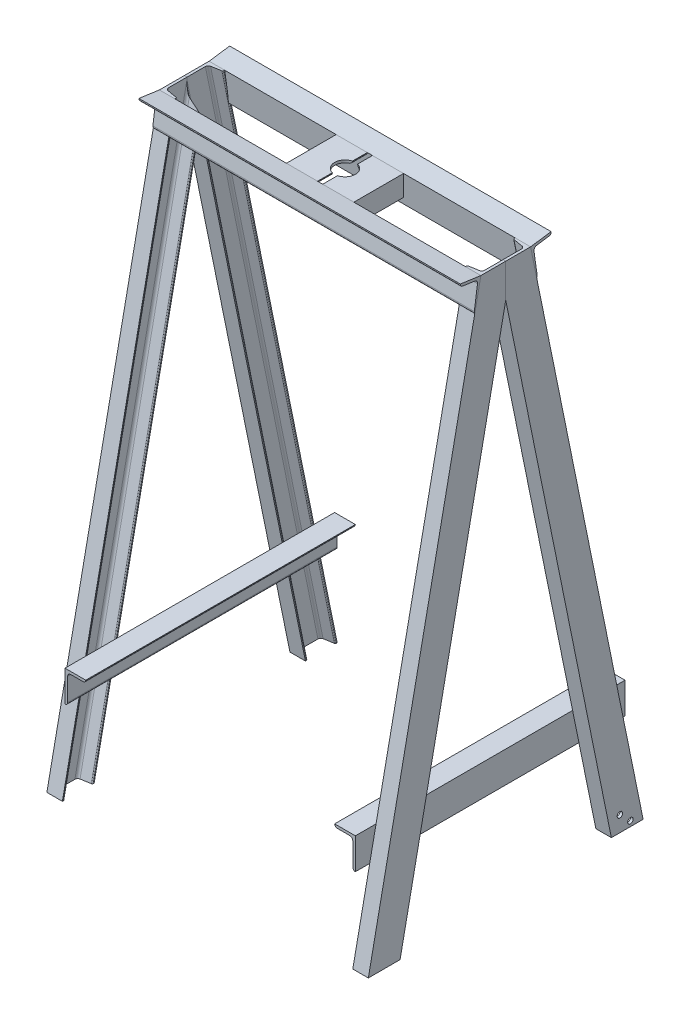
ISO-10303-21;
HEADER;
FILE_DESCRIPTION(('STEP AP214'),'2;1');
FILE_NAME('part.step','',(''),(''),'','','');
FILE_SCHEMA(('AUTOMOTIVE_DESIGN { 1 0 10303 214 1 1 1 1 }'));
ENDSEC;
DATA;
#1=APPLICATION_CONTEXT('core data for automotive mechanical design processes');
#2=APPLICATION_PROTOCOL_DEFINITION('international standard','automotive_design',2000,#1);
#3=PRODUCT_CONTEXT('',#1,'mechanical');
#4=PRODUCT('Part','Part','',(#3));
#5=PRODUCT_RELATED_PRODUCT_CATEGORY('part','',(#4));
#6=PRODUCT_DEFINITION_FORMATION('','',#4);
#7=PRODUCT_DEFINITION_CONTEXT('part definition',#1,'design');
#8=PRODUCT_DEFINITION('design','',#6,#7);
#9=PRODUCT_DEFINITION_SHAPE('','',#8);
#10=(LENGTH_UNIT() NAMED_UNIT(*) SI_UNIT(.MILLI.,.METRE.));
#11=(NAMED_UNIT(*) PLANE_ANGLE_UNIT() SI_UNIT($,.RADIAN.));
#12=(NAMED_UNIT(*) SI_UNIT($,.STERADIAN.) SOLID_ANGLE_UNIT());
#13=UNCERTAINTY_MEASURE_WITH_UNIT(LENGTH_MEASURE(1.E-05),#10,'distance_accuracy_value','');
#14=(GEOMETRIC_REPRESENTATION_CONTEXT(3) GLOBAL_UNCERTAINTY_ASSIGNED_CONTEXT((#13)) GLOBAL_UNIT_ASSIGNED_CONTEXT((#10,
#11,#12)) REPRESENTATION_CONTEXT('',''));
#15=CARTESIAN_POINT('',(0.,0.,0.));
#16=DIRECTION('',(0.,0.,1.));
#17=DIRECTION('',(1.,0.,0.));
#18=AXIS2_PLACEMENT_3D('',#15,#16,#17);
#19=CARTESIAN_POINT('',(12.6949200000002,1352.33687180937,-60.8802944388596));
#20=DIRECTION('',(0.,0.,1.));
#21=DIRECTION('',(1.,0.,0.));
#22=AXIS2_PLACEMENT_3D('',#19,#20,#21);
#23=CYLINDRICAL_SURFACE('',#22,6.34492000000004);
#24=DIRECTION('',(0.,0.,1.));
#25=VECTOR('',#24,1.);
#26=CARTESIAN_POINT('',(12.6949200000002,1345.99195180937,-60.8802944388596));
#27=LINE('',#26,#25);
#28=CARTESIAN_POINT('',(12.6949200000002,1345.99195180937,-60.8802944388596));
#29=VERTEX_POINT('',#28);
#30=CARTESIAN_POINT('',(12.6949200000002,1345.99195180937,-21.9999774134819));
#31=VERTEX_POINT('',#30);
#32=EDGE_CURVE('E397',#29,#31,#27,.T.);
#33=ORIENTED_EDGE('',*,*,#32,.T.);
#34=CARTESIAN_POINT('',(12.6949200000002,1345.99195180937,-21.9999774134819));
#35=CARTESIAN_POINT('',(12.5181383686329,1345.99193980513,-22.1020131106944));
#36=CARTESIAN_POINT('',(12.340062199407,1345.99934094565,-22.2019055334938));
#37=CARTESIAN_POINT('',(11.9824630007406,1346.02952709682,-22.3969147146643));
#38=CARTESIAN_POINT('',(11.8029391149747,1346.05232199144,-22.492028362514));
#39=CARTESIAN_POINT('',(11.4430891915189,1346.1139793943,-22.6772329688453));
#40=CARTESIAN_POINT('',(11.262762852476,1346.1529066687,-22.7673020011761));
#41=CARTESIAN_POINT('',(10.9035814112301,1346.24724275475,-22.9414847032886));
#42=CARTESIAN_POINT('',(10.7247260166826,1346.30264820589,-23.0255995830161));
#43=CARTESIAN_POINT('',(10.3693296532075,1346.4304808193,-23.1878272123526));
#44=CARTESIAN_POINT('',(10.1928023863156,1346.50298204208,-23.2659118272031));
#45=CARTESIAN_POINT('',(9.84471759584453,1346.66490612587,-23.4153241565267));
#46=CARTESIAN_POINT('',(9.67315971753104,1346.7543277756,-23.4866523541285));
#47=CARTESIAN_POINT('',(9.33728683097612,1346.94966750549,-23.6221888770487));
#48=CARTESIAN_POINT('',(9.17295721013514,1347.05555013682,-23.6864120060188));
#49=CARTESIAN_POINT('',(8.85312034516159,1347.28344424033,-23.8078037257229));
#50=CARTESIAN_POINT('',(8.69761204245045,1347.40545377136,-23.8649731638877));
#51=CARTESIAN_POINT('',(8.41155498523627,1347.65252961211,-23.9671983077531));
#52=CARTESIAN_POINT('',(8.28003690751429,1347.77621380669,-24.0128884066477));
#53=CARTESIAN_POINT('',(8.02716905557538,1348.03537442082,-24.0985970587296));
#54=CARTESIAN_POINT('',(7.90581853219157,1348.17084997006,-24.1386160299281));
#55=CARTESIAN_POINT('',(7.67450053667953,1348.45271735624,-24.2131539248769));
#56=CARTESIAN_POINT('',(7.56453859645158,1348.59911443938,-24.2476701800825));
#57=CARTESIAN_POINT('',(7.35722412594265,1348.90166623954,-24.3113763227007));
#58=CARTESIAN_POINT('',(7.25987097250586,1349.05782047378,-24.340566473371));
#59=CARTESIAN_POINT('',(7.08394004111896,1349.36953282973,-24.3923291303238));
#60=CARTESIAN_POINT('',(7.00460942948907,1349.52461995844,-24.4151835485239));
#61=CARTESIAN_POINT('',(6.85879381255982,1349.84127146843,-24.4565470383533));
#62=CARTESIAN_POINT('',(6.79230819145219,1350.00283553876,-24.4750563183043));
#63=CARTESIAN_POINT('',(6.6728367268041,1350.33112853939,-24.5078985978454));
#64=CARTESIAN_POINT('',(6.61983896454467,1350.49785276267,-24.5222352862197));
#65=CARTESIAN_POINT('',(6.52775139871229,1350.83532757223,-24.5469084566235));
#66=CARTESIAN_POINT('',(6.48865727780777,1351.00607689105,-24.5572461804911));
#67=CARTESIAN_POINT('',(6.42122496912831,1351.36917816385,-24.5749730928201));
#68=CARTESIAN_POINT('',(6.3945218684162,1351.56185757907,-24.5819185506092));
#69=CARTESIAN_POINT('',(6.3589053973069,1351.94865256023,-24.5911441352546));
#70=CARTESIAN_POINT('',(6.34996366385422,1352.14276533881,-24.5934317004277));
#71=CARTESIAN_POINT('',(6.35000000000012,1352.33687180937,-24.5934442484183));
#72=B_SPLINE_CURVE_WITH_KNOTS('',3,(#34,#35,#36,#37,#38,#39,#40,#41,#42,#43,#44,#45,#46,#47,#48,
#49,#50,#51,#52,#53,#54,#55,#56,#57,#58,#59,#60,#61,#62,#63,#64,#65,#66,#67,#68,#69,#70,#71),
.UNSPECIFIED.,.F.,.F.,(4,2,2,2,2,2,2,2,2,2,2,2,2,2,2,2,2,2,4),(0.,0.61227064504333,
1.22493478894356,1.84008277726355,2.45510540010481,3.07284296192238,3.69053631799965,
4.30691743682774,4.92322443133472,5.48120377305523,6.03914196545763,6.59734991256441,
7.15553026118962,7.68197143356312,8.20838736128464,8.73433648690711,9.26012215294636,
9.84316971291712,10.425285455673),.UNSPECIFIED.);
#73=CARTESIAN_POINT('',(6.35000000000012,1352.33687180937,-24.5934442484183));
#74=VERTEX_POINT('',#73);
#75=EDGE_CURVE('E357',#31,#74,#72,.T.);
#76=ORIENTED_EDGE('',*,*,#75,.T.);
#77=DIRECTION('',(0.,0.,1.));
#78=VECTOR('',#77,1.);
#79=CARTESIAN_POINT('',(6.35000000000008,1352.33687180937,-60.8802944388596));
#80=LINE('',#79,#78);
#81=CARTESIAN_POINT('',(6.35000000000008,1352.33687180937,-60.8802944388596));
#82=VERTEX_POINT('',#81);
#83=EDGE_CURVE('E355',#82,#74,#80,.T.);
#84=ORIENTED_EDGE('',*,*,#83,.F.);
#85=CARTESIAN_POINT('',(12.6949200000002,1352.33687180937,-60.8802944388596));
#86=DIRECTION('',(0.,0.,-1.));
#87=DIRECTION('',(0.,-1.,0.));
#88=AXIS2_PLACEMENT_3D('',#85,#86,#87);
#89=CIRCLE('',#88,6.34492000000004);
#90=EDGE_CURVE('E341',#29,#82,#89,.T.);
#91=ORIENTED_EDGE('',*,*,#90,.F.);
#92=EDGE_LOOP('',(#33,#76,#84,#91));
#93=FACE_BOUND('',#92,.T.);
#94=ADVANCED_FACE('F256',(#93),#23,.T.);
#95=CARTESIAN_POINT('',(6.35000000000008,1352.34195180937,-60.8802944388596));
#96=DIRECTION('',(1.,0.,0.));
#97=DIRECTION('',(0.,1.,0.));
#98=AXIS2_PLACEMENT_3D('',#95,#96,#97);
#99=PLANE('',#98);
#100=ORIENTED_EDGE('',*,*,#83,.T.);
#101=DIRECTION('',(0.,1.,0.));
#102=VECTOR('',#101,1.);
#103=CARTESIAN_POINT('',(6.34999999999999,1326.94195180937,-24.5934442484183));
#104=LINE('',#103,#102);
#105=CARTESIAN_POINT('',(6.35000000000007,1352.34195180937,-24.5934442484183));
#106=VERTEX_POINT('',#105);
#107=EDGE_CURVE('E375',#74,#106,#104,.T.);
#108=ORIENTED_EDGE('',*,*,#107,.T.);
#109=DIRECTION('',(0.,0.,1.));
#110=VECTOR('',#109,1.);
#111=CARTESIAN_POINT('',(6.35000000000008,1352.34195180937,-60.8802944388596));
#112=LINE('',#111,#110);
#113=CARTESIAN_POINT('',(6.35000000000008,1352.34195180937,-60.8802944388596));
#114=VERTEX_POINT('',#113);
#115=EDGE_CURVE('E365',#114,#106,#112,.T.);
#116=ORIENTED_EDGE('',*,*,#115,.F.);
#117=DIRECTION('',(0.,1.,0.));
#118=VECTOR('',#117,1.);
#119=CARTESIAN_POINT('',(6.35000000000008,1352.34195180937,-60.8802944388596));
#120=LINE('',#119,#118);
#121=EDGE_CURVE('E345',#82,#114,#120,.T.);
#122=ORIENTED_EDGE('',*,*,#121,.F.);
#123=EDGE_LOOP('',(#100,#108,#116,#122));
#124=FACE_BOUND('',#123,.T.);
#125=ADVANCED_FACE('F363',(#124),#99,.F.);
#126=CARTESIAN_POINT('',(82.5499999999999,1301.54195180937,-60.8802944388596));
#127=DIRECTION('',(-1.,0.,0.));
#128=DIRECTION('',(0.,-1.,0.));
#129=AXIS2_PLACEMENT_3D('',#126,#127,#128);
#130=PLANE('',#129);
#131=DIRECTION('',(0.,-1.,0.));
#132=VECTOR('',#131,1.);
#133=CARTESIAN_POINT('',(82.5499999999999,1301.54195180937,60.8802944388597));
#134=LINE('',#133,#132);
#135=CARTESIAN_POINT('',(82.5500000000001,1352.34195180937,60.8802944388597));
#136=VERTEX_POINT('',#135);
#137=CARTESIAN_POINT('',(82.5499999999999,1301.54195180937,60.8802944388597));
#138=VERTEX_POINT('',#137);
#139=EDGE_CURVE('E371',#136,#138,#134,.T.);
#140=ORIENTED_EDGE('',*,*,#139,.T.);
#141=DIRECTION('',(0.,0.,1.));
#142=VECTOR('',#141,1.);
#143=CARTESIAN_POINT('',(82.5499999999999,1301.54195180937,-60.8802944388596));
#144=LINE('',#143,#142);
#145=CARTESIAN_POINT('',(82.5499999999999,1301.54195180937,-60.8802944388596));
#146=VERTEX_POINT('',#145);
#147=EDGE_CURVE('E13',#146,#138,#144,.T.);
#148=ORIENTED_EDGE('',*,*,#147,.F.);
#149=DIRECTION('',(0.,-1.,0.));
#150=VECTOR('',#149,1.);
#151=CARTESIAN_POINT('',(82.5499999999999,1301.54195180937,-60.8802944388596));
#152=LINE('',#151,#150);
#153=CARTESIAN_POINT('',(82.5500000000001,1352.34195180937,-60.8802944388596));
#154=VERTEX_POINT('',#153);
#155=EDGE_CURVE('E393',#154,#146,#152,.T.);
#156=ORIENTED_EDGE('',*,*,#155,.F.);
#157=DIRECTION('',(0.,0.,1.));
#158=VECTOR('',#157,1.);
#159=CARTESIAN_POINT('',(82.5500000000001,1352.34195180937,-60.8802944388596));
#160=LINE('',#159,#158);
#161=EDGE_CURVE('E367',#154,#136,#160,.T.);
#162=ORIENTED_EDGE('',*,*,#161,.T.);
#163=EDGE_LOOP('',(#140,#148,#156,#162));
#164=FACE_BOUND('',#163,.T.);
#165=ADVANCED_FACE('F258',(#164),#130,.F.);
#166=CARTESIAN_POINT('',(82.5449199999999,1301.54195180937,-60.8802944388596));
#167=DIRECTION('',(0.,1.,0.));
#168=DIRECTION('',(-1.,0.,0.));
#169=AXIS2_PLACEMENT_3D('',#166,#167,#168);
#170=PLANE('',#169);
#171=DIRECTION('',(-1.,0.,0.));
#172=VECTOR('',#171,1.);
#173=CARTESIAN_POINT('',(82.5449199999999,1301.54195180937,60.8802944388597));
#174=LINE('',#173,#172);
#175=CARTESIAN_POINT('',(82.5449199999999,1301.54195180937,60.8802944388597));
#176=VERTEX_POINT('',#175);
#177=EDGE_CURVE('E374',#138,#176,#174,.T.);
#178=ORIENTED_EDGE('',*,*,#177,.T.);
#179=DIRECTION('',(0.,0.,1.));
#180=VECTOR('',#179,1.);
#181=CARTESIAN_POINT('',(82.5449199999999,1301.54195180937,-60.8802944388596));
#182=LINE('',#181,#180);
#183=CARTESIAN_POINT('',(82.5449199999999,1301.54195180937,-60.8802944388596));
#184=VERTEX_POINT('',#183);
#185=EDGE_CURVE('E264',#184,#176,#182,.T.);
#186=ORIENTED_EDGE('',*,*,#185,.F.);
#187=DIRECTION('',(-1.,0.,0.));
#188=VECTOR('',#187,1.);
#189=CARTESIAN_POINT('',(82.5449199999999,1301.54195180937,-60.8802944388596));
#190=LINE('',#189,#188);
#191=EDGE_CURVE('E323',#146,#184,#190,.T.);
#192=ORIENTED_EDGE('',*,*,#191,.F.);
#193=ORIENTED_EDGE('',*,*,#147,.T.);
#194=EDGE_LOOP('',(#178,#186,#192,#193));
#195=FACE_BOUND('',#194,.T.);
#196=ADVANCED_FACE('F472',(#195),#170,.F.);
#197=CARTESIAN_POINT('',(82.5449199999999,1307.88687180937,-60.8802944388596));
#198=DIRECTION('',(0.,0.,1.));
#199=DIRECTION('',(1.,0.,0.));
#200=AXIS2_PLACEMENT_3D('',#197,#198,#199);
#201=CYLINDRICAL_SURFACE('',#200,6.34492000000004);
#202=CARTESIAN_POINT('',(82.5449199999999,1307.88687180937,60.8802944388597));
#203=DIRECTION('',(0.,0.,-1.));
#204=DIRECTION('',(0.,1.,0.));
#205=AXIS2_PLACEMENT_3D('',#202,#203,#204);
#206=CIRCLE('',#205,6.34492000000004);
#207=CARTESIAN_POINT('',(76.1999999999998,1307.88687180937,60.8802944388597));
#208=VERTEX_POINT('',#207);
#209=EDGE_CURVE('E377',#176,#208,#206,.T.);
#210=ORIENTED_EDGE('',*,*,#209,.T.);
#211=DIRECTION('',(0.,0.,1.));
#212=VECTOR('',#211,1.);
#213=CARTESIAN_POINT('',(76.1999999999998,1307.88687180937,-60.8802944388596));
#214=LINE('',#213,#212);
#215=CARTESIAN_POINT('',(76.1999999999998,1307.88687180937,-60.8802944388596));
#216=VERTEX_POINT('',#215);
#217=EDGE_CURVE('E405',#216,#208,#214,.T.);
#218=ORIENTED_EDGE('',*,*,#217,.F.);
#219=CARTESIAN_POINT('',(82.5449199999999,1307.88687180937,-60.8802944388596));
#220=DIRECTION('',(0.,0.,-1.));
#221=DIRECTION('',(0.,1.,0.));
#222=AXIS2_PLACEMENT_3D('',#219,#220,#221);
#223=CIRCLE('',#222,6.34492000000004);
#224=EDGE_CURVE('E413',#184,#216,#223,.T.);
#225=ORIENTED_EDGE('',*,*,#224,.F.);
#226=ORIENTED_EDGE('',*,*,#185,.T.);
#227=EDGE_LOOP('',(#210,#218,#225,#226));
#228=FACE_BOUND('',#227,.T.);
#229=ADVANCED_FACE('F411',(#228),#201,.T.);
#230=CARTESIAN_POINT('',(76.2,1338.05445180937,-60.8802944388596));
#231=DIRECTION('',(1.,0.,0.));
#232=DIRECTION('',(0.,1.,0.));
#233=AXIS2_PLACEMENT_3D('',#230,#231,#232);
#234=PLANE('',#233);
#235=DIRECTION('',(0.,1.,0.));
#236=VECTOR('',#235,1.);
#237=CARTESIAN_POINT('',(76.2,1338.05445180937,60.8802944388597));
#238=LINE('',#237,#236);
#239=CARTESIAN_POINT('',(76.2,1338.05445180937,60.8802944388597));
#240=VERTEX_POINT('',#239);
#241=EDGE_CURVE('E379',#208,#240,#238,.T.);
#242=ORIENTED_EDGE('',*,*,#241,.T.);
#243=DIRECTION('',(0.,0.,1.));
#244=VECTOR('',#243,1.);
#245=CARTESIAN_POINT('',(76.2,1338.05445180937,-60.8802944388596));
#246=LINE('',#245,#244);
#247=CARTESIAN_POINT('',(76.2,1338.05445180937,-60.8802944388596));
#248=VERTEX_POINT('',#247);
#249=EDGE_CURVE('E402',#248,#240,#246,.T.);
#250=ORIENTED_EDGE('',*,*,#249,.F.);
#251=DIRECTION('',(0.,1.,0.));
#252=VECTOR('',#251,1.);
#253=CARTESIAN_POINT('',(76.2,1338.05445180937,-60.8802944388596));
#254=LINE('',#253,#252);
#255=EDGE_CURVE('E429',#216,#248,#254,.T.);
#256=ORIENTED_EDGE('',*,*,#255,.F.);
#257=ORIENTED_EDGE('',*,*,#217,.T.);
#258=EDGE_LOOP('',(#242,#250,#256,#257));
#259=FACE_BOUND('',#258,.T.);
#260=ADVANCED_FACE('F422',(#259),#234,.F.);
#261=CARTESIAN_POINT('',(68.2625000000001,1338.05445180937,-60.8802944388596));
#262=DIRECTION('',(0.,0.,1.));
#263=DIRECTION('',(1.,0.,0.));
#264=AXIS2_PLACEMENT_3D('',#261,#262,#263);
#265=CYLINDRICAL_SURFACE('',#264,7.93749999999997);
#266=CARTESIAN_POINT('',(68.2625000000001,1338.05445180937,60.8802944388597));
#267=DIRECTION('',(0.,0.,1.));
#268=DIRECTION('',(0.,-1.,0.));
#269=AXIS2_PLACEMENT_3D('',#266,#267,#268);
#270=CIRCLE('',#269,7.93749999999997);
#271=CARTESIAN_POINT('',(68.2625000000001,1345.99195180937,60.8802944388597));
#272=VERTEX_POINT('',#271);
#273=EDGE_CURVE('E381',#240,#272,#270,.T.);
#274=ORIENTED_EDGE('',*,*,#273,.T.);
#275=DIRECTION('',(0.,0.,1.));
#276=VECTOR('',#275,1.);
#277=CARTESIAN_POINT('',(68.2625000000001,1345.99195180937,-60.8802944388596));
#278=LINE('',#277,#276);
#279=CARTESIAN_POINT('',(68.2625000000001,1345.99195180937,-60.8802944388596));
#280=VERTEX_POINT('',#279);
#281=EDGE_CURVE('E399',#280,#272,#278,.T.);
#282=ORIENTED_EDGE('',*,*,#281,.F.);
#283=CARTESIAN_POINT('',(68.2625000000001,1338.05445180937,-60.8802944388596));
#284=DIRECTION('',(0.,0.,1.));
#285=DIRECTION('',(0.,-1.,0.));
#286=AXIS2_PLACEMENT_3D('',#283,#284,#285);
#287=CIRCLE('',#286,7.93749999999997);
#288=EDGE_CURVE('E428',#248,#280,#287,.T.);
#289=ORIENTED_EDGE('',*,*,#288,.F.);
#290=ORIENTED_EDGE('',*,*,#249,.T.);
#291=EDGE_LOOP('',(#274,#282,#289,#290));
#292=FACE_BOUND('',#291,.T.);
#293=ADVANCED_FACE('F426',(#292),#265,.F.);
#294=CARTESIAN_POINT('',(12.6949200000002,1345.99195180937,-60.8802944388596));
#295=DIRECTION('',(0.,1.,0.));
#296=DIRECTION('',(-1.,0.,0.));
#297=AXIS2_PLACEMENT_3D('',#294,#295,#296);
#298=PLANE('',#297);
#299=CARTESIAN_POINT('',(12.6949200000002,1345.99195180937,21.9999774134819));
#300=VERTEX_POINT('',#299);
#301=CARTESIAN_POINT('',(12.6949200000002,1345.99195180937,60.8802944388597));
#302=VERTEX_POINT('',#301);
#303=EDGE_CURVE('E360',#300,#302,#27,.T.);
#304=ORIENTED_EDGE('',*,*,#303,.F.);
#305=CARTESIAN_POINT('',(4.69950850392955E-12,1345.99195180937,0.));
#306=DIRECTION('',(0.,1.,0.));
#307=DIRECTION('',(-1.,0.,0.));
#308=AXIS2_PLACEMENT_3D('',#305,#306,#307);
#309=CIRCLE('',#308,25.4);
#310=EDGE_CURVE('E443',#300,#31,#309,.T.);
#311=ORIENTED_EDGE('',*,*,#310,.T.);
#312=ORIENTED_EDGE('',*,*,#32,.F.);
#313=DIRECTION('',(-1.,0.,0.));
#314=VECTOR('',#313,1.);
#315=CARTESIAN_POINT('',(12.6949200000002,1345.99195180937,-60.8802944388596));
#316=LINE('',#315,#314);
#317=EDGE_CURVE('E348',#280,#29,#316,.T.);
#318=ORIENTED_EDGE('',*,*,#317,.F.);
#319=ORIENTED_EDGE('',*,*,#281,.T.);
#320=DIRECTION('',(-1.,0.,0.));
#321=VECTOR('',#320,1.);
#322=CARTESIAN_POINT('',(12.6949200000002,1345.99195180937,60.8802944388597));
#323=LINE('',#322,#321);
#324=EDGE_CURVE('E383',#272,#302,#323,.T.);
#325=ORIENTED_EDGE('',*,*,#324,.T.);
#326=EDGE_LOOP('',(#304,#311,#312,#318,#319,#325));
#327=FACE_BOUND('',#326,.T.);
#328=ADVANCED_FACE('F485',(#327),#298,.F.);
#329=CARTESIAN_POINT('',(6.35000000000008,1352.33687180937,24.5934442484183));
#330=VERTEX_POINT('',#329);
#331=CARTESIAN_POINT('',(6.35000000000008,1352.33687180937,60.8802944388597));
#332=VERTEX_POINT('',#331);
#333=EDGE_CURVE('E361',#330,#332,#80,.T.);
#334=ORIENTED_EDGE('',*,*,#333,.F.);
#335=CARTESIAN_POINT('',(6.35000000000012,1352.33687180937,24.5934442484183));
#336=CARTESIAN_POINT('',(6.34997840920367,1352.16386807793,24.5934360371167));
#337=CARTESIAN_POINT('',(6.35707489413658,1351.99086704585,24.5916170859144));
#338=CARTESIAN_POINT('',(6.38534849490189,1351.64610644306,24.5842982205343));
#339=CARTESIAN_POINT('',(6.40652488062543,1351.47434680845,24.5787984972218));
#340=CARTESIAN_POINT('',(6.46277433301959,1351.13345933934,24.5640660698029));
#341=CARTESIAN_POINT('',(6.49783332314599,1350.96432901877,24.5548371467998));
#342=CARTESIAN_POINT('',(6.58154105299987,1350.62972705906,24.5325335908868));
#343=CARTESIAN_POINT('',(6.63018961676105,1350.46425537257,24.5194590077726));
#344=CARTESIAN_POINT('',(6.74068425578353,1350.13806436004,24.4893129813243));
#345=CARTESIAN_POINT('',(6.80253663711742,1349.97734734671,24.472239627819));
#346=CARTESIAN_POINT('',(6.93888351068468,1349.66187999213,24.4339294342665));
#347=CARTESIAN_POINT('',(7.01337823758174,1349.5071297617,24.4126925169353));
#348=CARTESIAN_POINT('',(7.17433551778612,1349.20470083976,24.365876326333));
#349=CARTESIAN_POINT('',(7.26079631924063,1349.05702111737,24.3402976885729));
#350=CARTESIAN_POINT('',(7.44491655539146,1348.76971828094,24.2846137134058));
#351=CARTESIAN_POINT('',(7.54257595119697,1348.63009513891,24.2545083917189));
#352=CARTESIAN_POINT('',(7.74846301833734,1348.35949223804,24.1895224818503));
#353=CARTESIAN_POINT('',(7.85671620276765,1348.22853468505,24.1546302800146));
#354=CARTESIAN_POINT('',(8.08263789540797,1347.97642180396,24.0799733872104));
#355=CARTESIAN_POINT('',(8.20030963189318,1347.85526986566,24.0402070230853));
#356=CARTESIAN_POINT('',(8.44389467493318,1347.62358954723,23.9557351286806));
#357=CARTESIAN_POINT('',(8.56980311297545,1347.51305498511,23.9110325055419));
#358=CARTESIAN_POINT('',(8.82885203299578,1347.3030518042,23.8165988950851));
#359=CARTESIAN_POINT('',(8.96199567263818,1347.20358807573,23.7668657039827));
#360=CARTESIAN_POINT('',(9.23723255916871,1347.01419292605,23.6612704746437));
#361=CARTESIAN_POINT('',(9.37945668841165,1346.92451247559,23.6052996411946));
#362=CARTESIAN_POINT('',(9.66888424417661,1346.75753296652,23.4882318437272));
#363=CARTESIAN_POINT('',(9.81608581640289,1346.68022935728,23.427136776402));
#364=CARTESIAN_POINT('',(10.114507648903,1346.53800612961,23.2998516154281));
#365=CARTESIAN_POINT('',(10.265733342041,1346.47310433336,23.2336543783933));
#366=CARTESIAN_POINT('',(10.5707794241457,1346.35584083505,23.0964625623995));
#367=CARTESIAN_POINT('',(10.7245990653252,1346.30347558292,23.0254693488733));
#368=CARTESIAN_POINT('',(11.0301780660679,1346.21221017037,22.8806270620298));
#369=CARTESIAN_POINT('',(11.1819023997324,1346.17302573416,22.8068824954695));
#370=CARTESIAN_POINT('',(11.4858801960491,1346.10626579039,22.6553175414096));
#371=CARTESIAN_POINT('',(11.6381337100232,1346.0786914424,22.5774967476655));
#372=CARTESIAN_POINT('',(11.9418648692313,1346.03493619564,22.4183215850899));
#373=CARTESIAN_POINT('',(12.0933434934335,1346.01872364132,22.3369777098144));
#374=CARTESIAN_POINT('',(12.3951582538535,1345.99723073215,22.1709236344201));
#375=CARTESIAN_POINT('',(12.5454947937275,1345.99194631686,22.0862146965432));
#376=CARTESIAN_POINT('',(12.6949200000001,1345.99195180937,21.9999774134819));
#377=B_SPLINE_CURVE_WITH_KNOTS('',3,(#335,#336,#337,#338,#339,#340,#341,#342,#343,#344,#345,
#346,#347,#348,#349,#350,#351,#352,#353,#354,#355,#356,#357,#358,#359,#360,#361,#362,#363,#364,
#365,#366,#367,#368,#369,#370,#371,#372,#373,#374,#375,#376),.UNSPECIFIED.,.F.,.F.,(4,2,2,2,2,2,
2,2,2,2,2,2,2,2,2,2,2,2,2,2,4),(0.,0.518852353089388,1.03767780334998,1.55597852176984,
2.07427252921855,2.59281462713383,3.1113663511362,3.62984223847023,4.14831632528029,
4.66807131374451,5.18800522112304,5.70763453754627,6.22749248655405,6.75852922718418,
7.28937026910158,7.82096851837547,8.35241605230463,8.87153059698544,9.39069697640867,
9.90841107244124,10.4259327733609),.UNSPECIFIED.);
#378=EDGE_CURVE('E455',#330,#300,#377,.T.);
#379=ORIENTED_EDGE('',*,*,#378,.T.);
#380=ORIENTED_EDGE('',*,*,#303,.T.);
#381=CARTESIAN_POINT('',(12.6949200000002,1352.33687180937,60.8802944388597));
#382=DIRECTION('',(0.,0.,-1.));
#383=DIRECTION('',(0.,-1.,0.));
#384=AXIS2_PLACEMENT_3D('',#381,#382,#383);
#385=CIRCLE('',#384,6.34492000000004);
#386=EDGE_CURVE('E386',#302,#332,#385,.T.);
#387=ORIENTED_EDGE('',*,*,#386,.T.);
#388=EDGE_LOOP('',(#334,#379,#380,#387));
#389=FACE_BOUND('',#388,.T.);
#390=ADVANCED_FACE('F445',(#389),#23,.T.);
#391=CARTESIAN_POINT('',(6.35000000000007,1352.34195180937,24.5934442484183));
#392=VERTEX_POINT('',#391);
#393=CARTESIAN_POINT('',(6.35000000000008,1352.34195180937,60.8802944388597));
#394=VERTEX_POINT('',#393);
#395=EDGE_CURVE('E395',#392,#394,#112,.T.);
#396=ORIENTED_EDGE('',*,*,#395,.F.);
#397=DIRECTION('',(0.,1.,0.));
#398=VECTOR('',#397,1.);
#399=CARTESIAN_POINT('',(6.34999999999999,1326.94195180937,24.5934442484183));
#400=LINE('',#399,#398);
#401=EDGE_CURVE('E271',#392,#330,#400,.F.);
#402=ORIENTED_EDGE('',*,*,#401,.T.);
#403=ORIENTED_EDGE('',*,*,#333,.T.);
#404=DIRECTION('',(0.,1.,0.));
#405=VECTOR('',#404,1.);
#406=CARTESIAN_POINT('',(6.35000000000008,1352.34195180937,60.8802944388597));
#407=LINE('',#406,#405);
#408=EDGE_CURVE('E389',#332,#394,#407,.T.);
#409=ORIENTED_EDGE('',*,*,#408,.T.);
#410=EDGE_LOOP('',(#396,#402,#403,#409));
#411=FACE_BOUND('',#410,.T.);
#412=ADVANCED_FACE('F483',(#411),#99,.F.);
#413=CARTESIAN_POINT('',(82.5500000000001,1352.34195180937,-60.8802944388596));
#414=DIRECTION('',(0.,-1.,0.));
#415=DIRECTION('',(1.,0.,0.));
#416=AXIS2_PLACEMENT_3D('',#413,#414,#415);
#417=PLANE('',#416);
#418=ORIENTED_EDGE('',*,*,#115,.T.);
#419=CARTESIAN_POINT('',(4.7216794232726E-12,1352.34195180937,0.));
#420=DIRECTION('',(0.,1.,0.));
#421=DIRECTION('',(-1.,0.,0.));
#422=AXIS2_PLACEMENT_3D('',#419,#420,#421);
#423=CIRCLE('',#422,25.4);
#424=EDGE_CURVE('E462',#392,#106,#423,.T.);
#425=ORIENTED_EDGE('',*,*,#424,.F.);
#426=ORIENTED_EDGE('',*,*,#395,.T.);
#427=DIRECTION('',(1.,0.,0.));
#428=VECTOR('',#427,1.);
#429=CARTESIAN_POINT('',(82.5500000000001,1352.34195180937,60.8802944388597));
#430=LINE('',#429,#428);
#431=EDGE_CURVE('E315',#394,#136,#430,.T.);
#432=ORIENTED_EDGE('',*,*,#431,.T.);
#433=ORIENTED_EDGE('',*,*,#161,.F.);
#434=DIRECTION('',(1.,0.,0.));
#435=VECTOR('',#434,1.);
#436=CARTESIAN_POINT('',(82.5500000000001,1352.34195180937,-60.8802944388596));
#437=LINE('',#436,#435);
#438=EDGE_CURVE('E280',#114,#154,#437,.T.);
#439=ORIENTED_EDGE('',*,*,#438,.F.);
#440=EDGE_LOOP('',(#418,#425,#426,#432,#433,#439));
#441=FACE_BOUND('',#440,.T.);
#442=ADVANCED_FACE('F468',(#441),#417,.F.);
#443=CARTESIAN_POINT('',(12.6949200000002,1352.33687180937,-60.8802944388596));
#444=DIRECTION('',(0.,0.,1.));
#445=DIRECTION('',(0.,-1.,0.));
#446=AXIS2_PLACEMENT_3D('',#443,#444,#445);
#447=PLANE('',#446);
#448=ORIENTED_EDGE('',*,*,#155,.T.);
#449=ORIENTED_EDGE('',*,*,#191,.T.);
#450=ORIENTED_EDGE('',*,*,#224,.T.);
#451=ORIENTED_EDGE('',*,*,#255,.T.);
#452=ORIENTED_EDGE('',*,*,#288,.T.);
#453=ORIENTED_EDGE('',*,*,#317,.T.);
#454=ORIENTED_EDGE('',*,*,#90,.T.);
#455=ORIENTED_EDGE('',*,*,#121,.T.);
#456=ORIENTED_EDGE('',*,*,#438,.T.);
#457=EDGE_LOOP('',(#448,#449,#450,#451,#452,#453,#454,#455,#456));
#458=FACE_BOUND('',#457,.T.);
#459=ADVANCED_FACE('F343',(#458),#447,.F.);
#460=CARTESIAN_POINT('',(12.6949200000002,1352.33687180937,60.8802944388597));
#461=DIRECTION('',(0.,0.,1.));
#462=DIRECTION('',(0.,-1.,0.));
#463=AXIS2_PLACEMENT_3D('',#460,#461,#462);
#464=PLANE('',#463);
#465=ORIENTED_EDGE('',*,*,#139,.F.);
#466=ORIENTED_EDGE('',*,*,#431,.F.);
#467=ORIENTED_EDGE('',*,*,#408,.F.);
#468=ORIENTED_EDGE('',*,*,#386,.F.);
#469=ORIENTED_EDGE('',*,*,#324,.F.);
#470=ORIENTED_EDGE('',*,*,#273,.F.);
#471=ORIENTED_EDGE('',*,*,#241,.F.);
#472=ORIENTED_EDGE('',*,*,#209,.F.);
#473=ORIENTED_EDGE('',*,*,#177,.F.);
#474=EDGE_LOOP('',(#465,#466,#467,#468,#469,#470,#471,#472,#473));
#475=FACE_BOUND('',#474,.T.);
#476=ADVANCED_FACE('F417',(#475),#464,.T.);
#477=CARTESIAN_POINT('',(4.63299574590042E-12,1326.94195180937,0.));
#478=DIRECTION('',(0.,1.,0.));
#479=DIRECTION('',(-1.,0.,0.));
#480=AXIS2_PLACEMENT_3D('',#477,#478,#479);
#481=CYLINDRICAL_SURFACE('',#480,25.4);
#482=ORIENTED_EDGE('',*,*,#75,.F.);
#483=ORIENTED_EDGE('',*,*,#310,.F.);
#484=ORIENTED_EDGE('',*,*,#378,.F.);
#485=ORIENTED_EDGE('',*,*,#401,.F.);
#486=ORIENTED_EDGE('',*,*,#424,.T.);
#487=ORIENTED_EDGE('',*,*,#107,.F.);
#488=EDGE_LOOP('',(#482,#483,#484,#485,#486,#487));
#489=FACE_BOUND('',#488,.T.);
#490=ADVANCED_FACE('F449',(#489),#481,.F.);
#491=CLOSED_SHELL('',(#94,#125,#165,#196,#229,#260,#293,#328,#390,#412,#442,#459,#476,#490));
#492=MANIFOLD_SOLID_BREP('B2',#491);
#493=CARTESIAN_POINT('',(-6.35000000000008,1352.34195180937,-60.8802944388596));
#494=DIRECTION('',(1.,0.,0.));
#495=DIRECTION('',(0.,1.,0.));
#496=AXIS2_PLACEMENT_3D('',#493,#494,#495);
#497=PLANE('',#496);
#498=DIRECTION('',(0.,1.,0.));
#499=VECTOR('',#498,1.);
#500=CARTESIAN_POINT('',(-6.35000000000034,1326.94195180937,-24.5934442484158));
#501=LINE('',#500,#499);
#502=CARTESIAN_POINT('',(-6.35000000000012,1352.33687180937,-24.5934442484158));
#503=VERTEX_POINT('',#502);
#504=CARTESIAN_POINT('',(-6.35000000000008,1352.34195180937,-24.5934442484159));
#505=VERTEX_POINT('',#504);
#506=EDGE_CURVE('E722',#503,#505,#501,.T.);
#507=ORIENTED_EDGE('',*,*,#506,.F.);
#508=DIRECTION('',(0.,0.,1.));
#509=VECTOR('',#508,1.);
#510=CARTESIAN_POINT('',(-6.35000000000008,1352.33687180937,-60.8802944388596));
#511=LINE('',#510,#509);
#512=CARTESIAN_POINT('',(-6.35000000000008,1352.33687180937,-60.8802944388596));
#513=VERTEX_POINT('',#512);
#514=EDGE_CURVE('E715',#513,#503,#511,.T.);
#515=ORIENTED_EDGE('',*,*,#514,.F.);
#516=DIRECTION('',(0.,1.,0.));
#517=VECTOR('',#516,1.);
#518=CARTESIAN_POINT('',(-6.35000000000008,1352.34195180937,-60.8802944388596));
#519=LINE('',#518,#517);
#520=CARTESIAN_POINT('',(-6.35000000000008,1352.34195180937,-60.8802944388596));
#521=VERTEX_POINT('',#520);
#522=EDGE_CURVE('E718',#513,#521,#519,.T.);
#523=ORIENTED_EDGE('',*,*,#522,.T.);
#524=DIRECTION('',(0.,0.,1.));
#525=VECTOR('',#524,1.);
#526=CARTESIAN_POINT('',(-6.35000000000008,1352.34195180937,-60.8802944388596));
#527=LINE('',#526,#525);
#528=EDGE_CURVE('E776',#521,#505,#527,.T.);
#529=ORIENTED_EDGE('',*,*,#528,.T.);
#530=EDGE_LOOP('',(#507,#515,#523,#529));
#531=FACE_BOUND('',#530,.T.);
#532=ADVANCED_FACE('F628',(#531),#497,.T.);
#533=CARTESIAN_POINT('',(-12.6949200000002,1352.33687180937,-60.8802944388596));
#534=DIRECTION('',(0.,0.,1.));
#535=DIRECTION('',(1.,0.,0.));
#536=AXIS2_PLACEMENT_3D('',#533,#534,#535);
#537=CYLINDRICAL_SURFACE('',#536,6.34492000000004);
#538=CARTESIAN_POINT('',(-6.35000000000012,1352.33687180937,24.5934442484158));
#539=CARTESIAN_POINT('',(-6.34997840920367,1352.16386807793,24.5934360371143));
#540=CARTESIAN_POINT('',(-6.35707489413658,1351.99086704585,24.591617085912));
#541=CARTESIAN_POINT('',(-6.38534849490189,1351.64610644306,24.5842982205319));
#542=CARTESIAN_POINT('',(-6.40652488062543,1351.47434680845,24.5787984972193));
#543=CARTESIAN_POINT('',(-6.46277433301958,1351.13345933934,24.5640660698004));
#544=CARTESIAN_POINT('',(-6.49783332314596,1350.96432901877,24.5548371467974));
#545=CARTESIAN_POINT('',(-6.58154105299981,1350.62972705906,24.5325335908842));
#546=CARTESIAN_POINT('',(-6.63018961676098,1350.46425537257,24.5194590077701));
#547=CARTESIAN_POINT('',(-6.74068425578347,1350.13806436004,24.4893129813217));
#548=CARTESIAN_POINT('',(-6.80253663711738,1349.97734734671,24.4722396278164));
#549=CARTESIAN_POINT('',(-6.93888351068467,1349.66187999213,24.4339294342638));
#550=CARTESIAN_POINT('',(-7.01337823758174,1349.5071297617,24.4126925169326));
#551=CARTESIAN_POINT('',(-7.17433551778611,1349.20470083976,24.3658763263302));
#552=CARTESIAN_POINT('',(-7.26079631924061,1349.05702111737,24.3402976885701));
#553=CARTESIAN_POINT('',(-7.4449165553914,1348.76971828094,24.2846137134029));
#554=CARTESIAN_POINT('',(-7.54257595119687,1348.63009513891,24.254508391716));
#555=CARTESIAN_POINT('',(-7.74846301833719,1348.35949223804,24.1895224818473));
#556=CARTESIAN_POINT('',(-7.85671620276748,1348.22853468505,24.1546302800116));
#557=CARTESIAN_POINT('',(-8.08263789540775,1347.97642180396,24.0799733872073));
#558=CARTESIAN_POINT('',(-8.20030963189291,1347.85526986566,24.0402070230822));
#559=CARTESIAN_POINT('',(-8.44389467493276,1347.62358954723,23.9557351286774));
#560=CARTESIAN_POINT('',(-8.56980311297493,1347.51305498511,23.9110325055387));
#561=CARTESIAN_POINT('',(-8.8288520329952,1347.3030518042,23.8165988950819));
#562=CARTESIAN_POINT('',(-8.96199567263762,1347.20358807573,23.7668657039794));
#563=CARTESIAN_POINT('',(-9.23723255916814,1347.01419292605,23.6612704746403));
#564=CARTESIAN_POINT('',(-9.37945668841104,1346.92451247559,23.6052996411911));
#565=CARTESIAN_POINT('',(-9.66888424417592,1346.75753296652,23.4882318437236));
#566=CARTESIAN_POINT('',(-9.81608581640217,1346.68022935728,23.4271367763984));
#567=CARTESIAN_POINT('',(-10.1145076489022,1346.53800612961,23.2998516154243));
#568=CARTESIAN_POINT('',(-10.2657333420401,1346.47310433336,23.2336543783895));
#569=CARTESIAN_POINT('',(-10.5707794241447,1346.35584083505,23.0964625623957));
#570=CARTESIAN_POINT('',(-10.7245990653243,1346.30347558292,23.0254693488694));
#571=CARTESIAN_POINT('',(-11.030178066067,1346.21221017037,22.8806270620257));
#572=CARTESIAN_POINT('',(-11.1819023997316,1346.17302573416,22.8068824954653));
#573=CARTESIAN_POINT('',(-11.4858801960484,1346.10626579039,22.6553175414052));
#574=CARTESIAN_POINT('',(-11.6381337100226,1346.0786914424,22.5774967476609));
#575=CARTESIAN_POINT('',(-11.9418648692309,1346.03493619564,22.4183215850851));
#576=CARTESIAN_POINT('',(-12.0933434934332,1346.01872364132,22.3369777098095));
#577=CARTESIAN_POINT('',(-12.3951582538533,1345.99723073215,22.1709236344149));
#578=CARTESIAN_POINT('',(-12.5454947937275,1345.99194631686,22.0862146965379));
#579=CARTESIAN_POINT('',(-12.6949200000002,1345.99195180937,21.9999774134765));
#580=B_SPLINE_CURVE_WITH_KNOTS('',3,(#538,#539,#540,#541,#542,#543,#544,#545,#546,#547,#548,
#549,#550,#551,#552,#553,#554,#555,#556,#557,#558,#559,#560,#561,#562,#563,#564,#565,#566,#567,
#568,#569,#570,#571,#572,#573,#574,#575,#576,#577,#578,#579),.UNSPECIFIED.,.F.,.F.,(4,2,2,2,2,2,
2,2,2,2,2,2,2,2,2,2,2,2,2,2,4),(0.,0.518852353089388,1.03767780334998,1.55597852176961,
2.07427252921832,2.59281462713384,3.11136635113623,3.62984223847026,4.14831632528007,
4.66807131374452,5.18800522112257,5.70763453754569,6.22749248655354,6.75852922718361,
7.28937026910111,7.82096851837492,8.35241605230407,8.8715305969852,9.39069697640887,
9.90841107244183,10.4259327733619),.UNSPECIFIED.);
#581=CARTESIAN_POINT('',(-6.35000000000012,1352.33687180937,24.5934442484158));
#582=VERTEX_POINT('',#581);
#583=CARTESIAN_POINT('',(-12.6949200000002,1345.99195180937,21.9999774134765));
#584=VERTEX_POINT('',#583);
#585=EDGE_CURVE('E642',#582,#584,#580,.T.);
#586=ORIENTED_EDGE('',*,*,#585,.F.);
#587=CARTESIAN_POINT('',(-6.35000000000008,1352.33687180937,60.8802944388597));
#588=VERTEX_POINT('',#587);
#589=EDGE_CURVE('E727',#582,#588,#511,.T.);
#590=ORIENTED_EDGE('',*,*,#589,.T.);
#591=CARTESIAN_POINT('',(-12.6949200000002,1352.33687180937,60.8802944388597));
#592=DIRECTION('',(0.,0.,1.));
#593=DIRECTION('',(0.,-1.,0.));
#594=AXIS2_PLACEMENT_3D('',#591,#592,#593);
#595=CIRCLE('',#594,6.34492000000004);
#596=CARTESIAN_POINT('',(-12.6949200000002,1345.99195180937,60.8802944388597));
#597=VERTEX_POINT('',#596);
#598=EDGE_CURVE('E765',#597,#588,#595,.T.);
#599=ORIENTED_EDGE('',*,*,#598,.F.);
#600=DIRECTION('',(0.,0.,1.));
#601=VECTOR('',#600,1.);
#602=CARTESIAN_POINT('',(-12.6949200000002,1345.99195180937,-60.8802944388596));
#603=LINE('',#602,#601);
#604=EDGE_CURVE('E779',#584,#597,#603,.T.);
#605=ORIENTED_EDGE('',*,*,#604,.F.);
#606=EDGE_LOOP('',(#586,#590,#599,#605));
#607=FACE_BOUND('',#606,.T.);
#608=ADVANCED_FACE('F863',(#607),#537,.T.);
#609=CARTESIAN_POINT('',(-82.5500000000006,1301.54195180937,-60.8802944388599));
#610=DIRECTION('',(-1.,0.,0.));
#611=DIRECTION('',(0.,-1.,0.));
#612=AXIS2_PLACEMENT_3D('',#609,#610,#611);
#613=PLANE('',#612);
#614=DIRECTION('',(0.,-1.,0.));
#615=VECTOR('',#614,1.);
#616=CARTESIAN_POINT('',(-82.5500000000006,1301.54195180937,60.8802944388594));
#617=LINE('',#616,#615);
#618=CARTESIAN_POINT('',(-82.5500000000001,1352.34195180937,60.8802944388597));
#619=VERTEX_POINT('',#618);
#620=CARTESIAN_POINT('',(-82.5500000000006,1301.54195180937,60.8802944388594));
#621=VERTEX_POINT('',#620);
#622=EDGE_CURVE('E747',#619,#621,#617,.T.);
#623=ORIENTED_EDGE('',*,*,#622,.F.);
#624=DIRECTION('',(0.,0.,1.));
#625=VECTOR('',#624,1.);
#626=CARTESIAN_POINT('',(-82.5500000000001,1352.34195180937,-60.8802944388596));
#627=LINE('',#626,#625);
#628=CARTESIAN_POINT('',(-82.5500000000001,1352.34195180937,-60.8802944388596));
#629=VERTEX_POINT('',#628);
#630=EDGE_CURVE('E636',#629,#619,#627,.T.);
#631=ORIENTED_EDGE('',*,*,#630,.F.);
#632=DIRECTION('',(0.,-1.,0.));
#633=VECTOR('',#632,1.);
#634=CARTESIAN_POINT('',(-82.5500000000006,1301.54195180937,-60.8802944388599));
#635=LINE('',#634,#633);
#636=CARTESIAN_POINT('',(-82.5500000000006,1301.54195180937,-60.8802944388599));
#637=VERTEX_POINT('',#636);
#638=EDGE_CURVE('E774',#629,#637,#635,.T.);
#639=ORIENTED_EDGE('',*,*,#638,.T.);
#640=DIRECTION('',(0.,0.,1.));
#641=VECTOR('',#640,1.);
#642=CARTESIAN_POINT('',(-82.5500000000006,1301.54195180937,-60.8802944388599));
#643=LINE('',#642,#641);
#644=EDGE_CURVE('E692',#637,#621,#643,.T.);
#645=ORIENTED_EDGE('',*,*,#644,.T.);
#646=EDGE_LOOP('',(#623,#631,#639,#645));
#647=FACE_BOUND('',#646,.T.);
#648=ADVANCED_FACE('F630',(#647),#613,.T.);
#649=CARTESIAN_POINT('',(-82.5500000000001,1352.34195180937,-60.8802944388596));
#650=DIRECTION('',(0.,1.,0.));
#651=DIRECTION('',(-1.,0.,0.));
#652=AXIS2_PLACEMENT_3D('',#649,#650,#651);
#653=PLANE('',#652);
#654=CARTESIAN_POINT('',(4.7216794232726E-12,1352.34195180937,0.));
#655=DIRECTION('',(0.,1.,0.));
#656=DIRECTION('',(-1.,0.,0.));
#657=AXIS2_PLACEMENT_3D('',#654,#655,#656);
#658=CIRCLE('',#657,25.4);
#659=CARTESIAN_POINT('',(-6.35000000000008,1352.34195180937,24.5934442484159));
#660=VERTEX_POINT('',#659);
#661=EDGE_CURVE('E798',#505,#660,#658,.T.);
#662=ORIENTED_EDGE('',*,*,#661,.F.);
#663=ORIENTED_EDGE('',*,*,#528,.F.);
#664=DIRECTION('',(-1.,0.,0.));
#665=VECTOR('',#664,1.);
#666=CARTESIAN_POINT('',(-82.5500000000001,1352.34195180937,-60.8802944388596));
#667=LINE('',#666,#665);
#668=EDGE_CURVE('E735',#521,#629,#667,.T.);
#669=ORIENTED_EDGE('',*,*,#668,.T.);
#670=ORIENTED_EDGE('',*,*,#630,.T.);
#671=DIRECTION('',(-1.,0.,0.));
#672=VECTOR('',#671,1.);
#673=CARTESIAN_POINT('',(-82.5500000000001,1352.34195180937,60.8802944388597));
#674=LINE('',#673,#672);
#675=CARTESIAN_POINT('',(-6.35000000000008,1352.34195180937,60.8802944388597));
#676=VERTEX_POINT('',#675);
#677=EDGE_CURVE('E771',#676,#619,#674,.T.);
#678=ORIENTED_EDGE('',*,*,#677,.F.);
#679=EDGE_CURVE('E726',#660,#676,#527,.T.);
#680=ORIENTED_EDGE('',*,*,#679,.F.);
#681=EDGE_LOOP('',(#662,#663,#669,#670,#678,#680));
#682=FACE_BOUND('',#681,.T.);
#683=ADVANCED_FACE('F794',(#682),#653,.T.);
#684=DIRECTION('',(0.,1.,0.));
#685=VECTOR('',#684,1.);
#686=CARTESIAN_POINT('',(-6.35000000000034,1326.94195180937,24.5934442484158));
#687=LINE('',#686,#685);
#688=EDGE_CURVE('E804',#660,#582,#687,.F.);
#689=ORIENTED_EDGE('',*,*,#688,.F.);
#690=ORIENTED_EDGE('',*,*,#679,.T.);
#691=DIRECTION('',(0.,1.,0.));
#692=VECTOR('',#691,1.);
#693=CARTESIAN_POINT('',(-6.35000000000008,1352.34195180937,60.8802944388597));
#694=LINE('',#693,#692);
#695=EDGE_CURVE('E768',#588,#676,#694,.T.);
#696=ORIENTED_EDGE('',*,*,#695,.F.);
#697=ORIENTED_EDGE('',*,*,#589,.F.);
#698=EDGE_LOOP('',(#689,#690,#696,#697));
#699=FACE_BOUND('',#698,.T.);
#700=ADVANCED_FACE('F802',(#699),#497,.T.);
#701=CARTESIAN_POINT('',(-12.6949200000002,1345.99195180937,-21.9999774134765));
#702=CARTESIAN_POINT('',(-12.5181383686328,1345.99193980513,-22.102013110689));
#703=CARTESIAN_POINT('',(-12.340062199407,1345.99934094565,-22.2019055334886));
#704=CARTESIAN_POINT('',(-11.9824630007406,1346.02952709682,-22.3969147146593));
#705=CARTESIAN_POINT('',(-11.8029391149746,1346.05232199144,-22.4920283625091));
#706=CARTESIAN_POINT('',(-11.4430891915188,1346.1139793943,-22.6772329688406));
#707=CARTESIAN_POINT('',(-11.2627628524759,1346.1529066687,-22.7673020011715));
#708=CARTESIAN_POINT('',(-10.9035814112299,1346.24724275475,-22.9414847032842));
#709=CARTESIAN_POINT('',(-10.7247260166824,1346.30264820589,-23.0255995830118));
#710=CARTESIAN_POINT('',(-10.3693296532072,1346.4304808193,-23.1878272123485));
#711=CARTESIAN_POINT('',(-10.1928023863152,1346.50298204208,-23.2659118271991));
#712=CARTESIAN_POINT('',(-9.8447175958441,1346.66490612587,-23.4153241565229));
#713=CARTESIAN_POINT('',(-9.67315971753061,1346.7543277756,-23.4866523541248));
#714=CARTESIAN_POINT('',(-9.33728683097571,1346.94966750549,-23.6221888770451));
#715=CARTESIAN_POINT('',(-9.17295721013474,1347.05555013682,-23.6864120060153));
#716=CARTESIAN_POINT('',(-8.85312034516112,1347.28344424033,-23.8078037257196));
#717=CARTESIAN_POINT('',(-8.6976120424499,1347.40545377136,-23.8649731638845));
#718=CARTESIAN_POINT('',(-8.41155498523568,1347.65252961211,-23.96719830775));
#719=CARTESIAN_POINT('',(-8.28003690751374,1347.77621380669,-24.0128884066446));
#720=CARTESIAN_POINT('',(-8.0271690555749,1348.03537442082,-24.0985970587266));
#721=CARTESIAN_POINT('',(-7.90581853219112,1348.17084997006,-24.1386160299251));
#722=CARTESIAN_POINT('',(-7.67450053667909,1348.45271735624,-24.213153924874));
#723=CARTESIAN_POINT('',(-7.56453859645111,1348.59911443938,-24.2476701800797));
#724=CARTESIAN_POINT('',(-7.35722412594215,1348.90166623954,-24.311376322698));
#725=CARTESIAN_POINT('',(-7.25987097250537,1349.05782047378,-24.3405664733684));
#726=CARTESIAN_POINT('',(-7.0839400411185,1349.36953282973,-24.3923291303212));
#727=CARTESIAN_POINT('',(-7.00460942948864,1349.52461995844,-24.4151835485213));
#728=CARTESIAN_POINT('',(-6.85879381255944,1349.84127146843,-24.4565470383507));
#729=CARTESIAN_POINT('',(-6.79230819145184,1350.00283553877,-24.4750563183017));
#730=CARTESIAN_POINT('',(-6.6728367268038,1350.33112853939,-24.5078985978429));
#731=CARTESIAN_POINT('',(-6.6198389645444,1350.49785276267,-24.5222352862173));
#732=CARTESIAN_POINT('',(-6.52775139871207,1350.83532757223,-24.546908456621));
#733=CARTESIAN_POINT('',(-6.48865727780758,1351.00607689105,-24.5572461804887));
#734=CARTESIAN_POINT('',(-6.42122496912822,1351.36917816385,-24.5749730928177));
#735=CARTESIAN_POINT('',(-6.39452186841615,1351.56185757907,-24.5819185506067));
#736=CARTESIAN_POINT('',(-6.35890539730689,1351.94865256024,-24.5911441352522));
#737=CARTESIAN_POINT('',(-6.34996366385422,1352.14276533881,-24.5934317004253));
#738=CARTESIAN_POINT('',(-6.35000000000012,1352.33687180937,-24.5934442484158));
#739=B_SPLINE_CURVE_WITH_KNOTS('',3,(#701,#702,#703,#704,#705,#706,#707,#708,#709,#710,#711,
#712,#713,#714,#715,#716,#717,#718,#719,#720,#721,#722,#723,#724,#725,#726,#727,#728,#729,#730,
#731,#732,#733,#734,#735,#736,#737,#738),.UNSPECIFIED.,.F.,.F.,(4,2,2,2,2,2,2,2,2,2,2,2,2,2,2,2,
2,2,4),(0.,0.612270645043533,1.22493478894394,1.84008277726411,2.45510540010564,
3.07284296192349,3.69053631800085,4.30691743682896,4.92322443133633,5.48120377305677,
6.03914196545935,6.59734991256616,7.15553026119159,7.68197143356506,8.20838736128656,
8.73433648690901,9.26012215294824,9.84316971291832,10.4252854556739),.UNSPECIFIED.);
#740=CARTESIAN_POINT('',(-12.6949200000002,1345.99195180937,-21.9999774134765));
#741=VERTEX_POINT('',#740);
#742=EDGE_CURVE('E807',#741,#503,#739,.T.);
#743=ORIENTED_EDGE('',*,*,#742,.F.);
#744=CARTESIAN_POINT('',(-12.6949200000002,1345.99195180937,-60.8802944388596));
#745=VERTEX_POINT('',#744);
#746=EDGE_CURVE('E739',#745,#741,#603,.T.);
#747=ORIENTED_EDGE('',*,*,#746,.F.);
#748=CARTESIAN_POINT('',(-12.6949200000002,1352.33687180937,-60.8802944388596));
#749=DIRECTION('',(0.,0.,1.));
#750=DIRECTION('',(0.,-1.,0.));
#751=AXIS2_PLACEMENT_3D('',#748,#749,#750);
#752=CIRCLE('',#751,6.34492000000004);
#753=EDGE_CURVE('E733',#745,#513,#752,.T.);
#754=ORIENTED_EDGE('',*,*,#753,.T.);
#755=ORIENTED_EDGE('',*,*,#514,.T.);
#756=EDGE_LOOP('',(#743,#747,#754,#755));
#757=FACE_BOUND('',#756,.T.);
#758=ADVANCED_FACE('F737',(#757),#537,.T.);
#759=CARTESIAN_POINT('',(-12.6949200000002,1345.99195180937,-60.8802944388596));
#760=DIRECTION('',(0.,-1.,0.));
#761=DIRECTION('',(1.,0.,0.));
#762=AXIS2_PLACEMENT_3D('',#759,#760,#761);
#763=PLANE('',#762);
#764=CARTESIAN_POINT('',(4.69950850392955E-12,1345.99195180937,0.));
#765=DIRECTION('',(0.,-1.,0.));
#766=DIRECTION('',(1.,0.,0.));
#767=AXIS2_PLACEMENT_3D('',#764,#765,#766);
#768=CIRCLE('',#767,25.4);
#769=EDGE_CURVE('E254',#584,#741,#768,.T.);
#770=ORIENTED_EDGE('',*,*,#769,.F.);
#771=ORIENTED_EDGE('',*,*,#604,.T.);
#772=DIRECTION('',(1.,0.,0.));
#773=VECTOR('',#772,1.);
#774=CARTESIAN_POINT('',(-12.6949200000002,1345.99195180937,60.8802944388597));
#775=LINE('',#774,#773);
#776=CARTESIAN_POINT('',(-68.2625000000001,1345.99195180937,60.8802944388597));
#777=VERTEX_POINT('',#776);
#778=EDGE_CURVE('E762',#777,#597,#775,.T.);
#779=ORIENTED_EDGE('',*,*,#778,.F.);
#780=DIRECTION('',(0.,0.,1.));
#781=VECTOR('',#780,1.);
#782=CARTESIAN_POINT('',(-68.2625000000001,1345.99195180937,-60.8802944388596));
#783=LINE('',#782,#781);
#784=CARTESIAN_POINT('',(-68.2625000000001,1345.99195180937,-60.8802944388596));
#785=VERTEX_POINT('',#784);
#786=EDGE_CURVE('E780',#785,#777,#783,.T.);
#787=ORIENTED_EDGE('',*,*,#786,.F.);
#788=DIRECTION('',(1.,0.,0.));
#789=VECTOR('',#788,1.);
#790=CARTESIAN_POINT('',(-12.6949200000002,1345.99195180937,-60.8802944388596));
#791=LINE('',#790,#789);
#792=EDGE_CURVE('E740',#785,#745,#791,.T.);
#793=ORIENTED_EDGE('',*,*,#792,.T.);
#794=ORIENTED_EDGE('',*,*,#746,.T.);
#795=EDGE_LOOP('',(#770,#771,#779,#787,#793,#794));
#796=FACE_BOUND('',#795,.T.);
#797=ADVANCED_FACE('F862',(#796),#763,.T.);
#798=CARTESIAN_POINT('',(-68.2625000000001,1338.05445180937,-60.8802944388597));
#799=DIRECTION('',(0.,0.,1.));
#800=DIRECTION('',(1.,0.,0.));
#801=AXIS2_PLACEMENT_3D('',#798,#799,#800);
#802=CYLINDRICAL_SURFACE('',#801,7.93749999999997);
#803=CARTESIAN_POINT('',(-68.2625000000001,1338.05445180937,60.8802944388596));
#804=DIRECTION('',(0.,0.,-1.));
#805=DIRECTION('',(0.,-1.,0.));
#806=AXIS2_PLACEMENT_3D('',#803,#804,#805);
#807=CIRCLE('',#806,7.93749999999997);
#808=CARTESIAN_POINT('',(-76.2,1338.05445180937,60.8802944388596));
#809=VERTEX_POINT('',#808);
#810=EDGE_CURVE('E759',#809,#777,#807,.T.);
#811=ORIENTED_EDGE('',*,*,#810,.F.);
#812=DIRECTION('',(0.,0.,1.));
#813=VECTOR('',#812,1.);
#814=CARTESIAN_POINT('',(-76.2,1338.05445180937,-60.8802944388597));
#815=LINE('',#814,#813);
#816=CARTESIAN_POINT('',(-76.2,1338.05445180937,-60.8802944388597));
#817=VERTEX_POINT('',#816);
#818=EDGE_CURVE('E782',#817,#809,#815,.T.);
#819=ORIENTED_EDGE('',*,*,#818,.F.);
#820=CARTESIAN_POINT('',(-68.2625000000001,1338.05445180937,-60.8802944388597));
#821=DIRECTION('',(0.,0.,-1.));
#822=DIRECTION('',(0.,-1.,0.));
#823=AXIS2_PLACEMENT_3D('',#820,#821,#822);
#824=CIRCLE('',#823,7.93749999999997);
#825=EDGE_CURVE('E742',#817,#785,#824,.T.);
#826=ORIENTED_EDGE('',*,*,#825,.T.);
#827=ORIENTED_EDGE('',*,*,#786,.T.);
#828=EDGE_LOOP('',(#811,#819,#826,#827));
#829=FACE_BOUND('',#828,.T.);
#830=ADVANCED_FACE('F828',(#829),#802,.F.);
#831=CARTESIAN_POINT('',(-76.2,1338.05445180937,-60.8802944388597));
#832=DIRECTION('',(1.,0.,0.));
#833=DIRECTION('',(0.,1.,0.));
#834=AXIS2_PLACEMENT_3D('',#831,#832,#833);
#835=PLANE('',#834);
#836=DIRECTION('',(0.,1.,0.));
#837=VECTOR('',#836,1.);
#838=CARTESIAN_POINT('',(-76.2,1338.05445180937,60.8802944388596));
#839=LINE('',#838,#837);
#840=CARTESIAN_POINT('',(-76.2000000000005,1307.88687180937,60.8802944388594));
#841=VERTEX_POINT('',#840);
#842=EDGE_CURVE('E756',#841,#809,#839,.T.);
#843=ORIENTED_EDGE('',*,*,#842,.F.);
#844=DIRECTION('',(0.,0.,1.));
#845=VECTOR('',#844,1.);
#846=CARTESIAN_POINT('',(-76.2000000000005,1307.88687180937,-60.8802944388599));
#847=LINE('',#846,#845);
#848=CARTESIAN_POINT('',(-76.2000000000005,1307.88687180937,-60.8802944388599));
#849=VERTEX_POINT('',#848);
#850=EDGE_CURVE('E784',#849,#841,#847,.T.);
#851=ORIENTED_EDGE('',*,*,#850,.F.);
#852=DIRECTION('',(0.,1.,0.));
#853=VECTOR('',#852,1.);
#854=CARTESIAN_POINT('',(-76.2,1338.05445180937,-60.8802944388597));
#855=LINE('',#854,#853);
#856=EDGE_CURVE('E822',#849,#817,#855,.T.);
#857=ORIENTED_EDGE('',*,*,#856,.T.);
#858=ORIENTED_EDGE('',*,*,#818,.T.);
#859=EDGE_LOOP('',(#843,#851,#857,#858));
#860=FACE_BOUND('',#859,.T.);
#861=ADVANCED_FACE('F834',(#860),#835,.T.);
#862=CARTESIAN_POINT('',(-82.5449200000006,1307.88687180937,-60.8802944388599));
#863=DIRECTION('',(0.,0.,1.));
#864=DIRECTION('',(1.,0.,0.));
#865=AXIS2_PLACEMENT_3D('',#862,#863,#864);
#866=CYLINDRICAL_SURFACE('',#865,6.34492000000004);
#867=CARTESIAN_POINT('',(-82.5449200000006,1307.88687180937,60.8802944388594));
#868=DIRECTION('',(0.,0.,1.));
#869=DIRECTION('',(0.,1.,0.));
#870=AXIS2_PLACEMENT_3D('',#867,#868,#869);
#871=CIRCLE('',#870,6.34492000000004);
#872=CARTESIAN_POINT('',(-82.5449200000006,1301.54195180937,60.8802944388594));
#873=VERTEX_POINT('',#872);
#874=EDGE_CURVE('E753',#873,#841,#871,.T.);
#875=ORIENTED_EDGE('',*,*,#874,.F.);
#876=DIRECTION('',(0.,0.,1.));
#877=VECTOR('',#876,1.);
#878=CARTESIAN_POINT('',(-82.5449200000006,1301.54195180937,-60.8802944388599));
#879=LINE('',#878,#877);
#880=CARTESIAN_POINT('',(-82.5449200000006,1301.54195180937,-60.8802944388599));
#881=VERTEX_POINT('',#880);
#882=EDGE_CURVE('E786',#881,#873,#879,.T.);
#883=ORIENTED_EDGE('',*,*,#882,.F.);
#884=CARTESIAN_POINT('',(-82.5449200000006,1307.88687180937,-60.8802944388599));
#885=DIRECTION('',(0.,0.,1.));
#886=DIRECTION('',(0.,1.,0.));
#887=AXIS2_PLACEMENT_3D('',#884,#885,#886);
#888=CIRCLE('',#887,6.34492000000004);
#889=EDGE_CURVE('E819',#881,#849,#888,.T.);
#890=ORIENTED_EDGE('',*,*,#889,.T.);
#891=ORIENTED_EDGE('',*,*,#850,.T.);
#892=EDGE_LOOP('',(#875,#883,#890,#891));
#893=FACE_BOUND('',#892,.T.);
#894=ADVANCED_FACE('F836',(#893),#866,.T.);
#895=CARTESIAN_POINT('',(-82.5449200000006,1301.54195180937,-60.8802944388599));
#896=DIRECTION('',(0.,-1.,0.));
#897=DIRECTION('',(1.,0.,0.));
#898=AXIS2_PLACEMENT_3D('',#895,#896,#897);
#899=PLANE('',#898);
#900=DIRECTION('',(1.,0.,0.));
#901=VECTOR('',#900,1.);
#902=CARTESIAN_POINT('',(-82.5449200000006,1301.54195180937,60.8802944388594));
#903=LINE('',#902,#901);
#904=EDGE_CURVE('E750',#621,#873,#903,.T.);
#905=ORIENTED_EDGE('',*,*,#904,.F.);
#906=ORIENTED_EDGE('',*,*,#644,.F.);
#907=DIRECTION('',(1.,0.,0.));
#908=VECTOR('',#907,1.);
#909=CARTESIAN_POINT('',(-82.5449200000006,1301.54195180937,-60.8802944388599));
#910=LINE('',#909,#908);
#911=EDGE_CURVE('E817',#637,#881,#910,.T.);
#912=ORIENTED_EDGE('',*,*,#911,.T.);
#913=ORIENTED_EDGE('',*,*,#882,.T.);
#914=EDGE_LOOP('',(#905,#906,#912,#913));
#915=FACE_BOUND('',#914,.T.);
#916=ADVANCED_FACE('F787',(#915),#899,.T.);
#917=CARTESIAN_POINT('',(-12.6949200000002,1352.33687180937,-60.8802944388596));
#918=DIRECTION('',(0.,0.,-1.));
#919=DIRECTION('',(0.,-1.,0.));
#920=AXIS2_PLACEMENT_3D('',#917,#918,#919);
#921=PLANE('',#920);
#922=ORIENTED_EDGE('',*,*,#638,.F.);
#923=ORIENTED_EDGE('',*,*,#668,.F.);
#924=ORIENTED_EDGE('',*,*,#522,.F.);
#925=ORIENTED_EDGE('',*,*,#753,.F.);
#926=ORIENTED_EDGE('',*,*,#792,.F.);
#927=ORIENTED_EDGE('',*,*,#825,.F.);
#928=ORIENTED_EDGE('',*,*,#856,.F.);
#929=ORIENTED_EDGE('',*,*,#889,.F.);
#930=ORIENTED_EDGE('',*,*,#911,.F.);
#931=EDGE_LOOP('',(#922,#923,#924,#925,#926,#927,#928,#929,#930));
#932=FACE_BOUND('',#931,.T.);
#933=ADVANCED_FACE('F731',(#932),#921,.T.);
#934=CARTESIAN_POINT('',(-12.6949200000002,1352.33687180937,60.8802944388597));
#935=DIRECTION('',(0.,0.,-1.));
#936=DIRECTION('',(0.,-1.,0.));
#937=AXIS2_PLACEMENT_3D('',#934,#935,#936);
#938=PLANE('',#937);
#939=ORIENTED_EDGE('',*,*,#622,.T.);
#940=ORIENTED_EDGE('',*,*,#904,.T.);
#941=ORIENTED_EDGE('',*,*,#874,.T.);
#942=ORIENTED_EDGE('',*,*,#842,.T.);
#943=ORIENTED_EDGE('',*,*,#810,.T.);
#944=ORIENTED_EDGE('',*,*,#778,.T.);
#945=ORIENTED_EDGE('',*,*,#598,.T.);
#946=ORIENTED_EDGE('',*,*,#695,.T.);
#947=ORIENTED_EDGE('',*,*,#677,.T.);
#948=EDGE_LOOP('',(#939,#940,#941,#942,#943,#944,#945,#946,#947));
#949=FACE_BOUND('',#948,.T.);
#950=ADVANCED_FACE('F790',(#949),#938,.F.);
#951=CARTESIAN_POINT('',(4.63299574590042E-12,1326.94195180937,0.));
#952=DIRECTION('',(0.,1.,0.));
#953=DIRECTION('',(-1.,0.,0.));
#954=AXIS2_PLACEMENT_3D('',#951,#952,#953);
#955=CYLINDRICAL_SURFACE('',#954,25.4);
#956=ORIENTED_EDGE('',*,*,#506,.T.);
#957=ORIENTED_EDGE('',*,*,#661,.T.);
#958=ORIENTED_EDGE('',*,*,#688,.T.);
#959=ORIENTED_EDGE('',*,*,#585,.T.);
#960=ORIENTED_EDGE('',*,*,#769,.T.);
#961=ORIENTED_EDGE('',*,*,#742,.T.);
#962=EDGE_LOOP('',(#956,#957,#958,#959,#960,#961));
#963=FACE_BOUND('',#962,.T.);
#964=ADVANCED_FACE('F841',(#963),#955,.F.);
#965=CLOSED_SHELL('',(#532,#608,#648,#683,#700,#758,#797,#830,#861,#894,#916,#933,#950,#964));
#966=MANIFOLD_SOLID_BREP('B7',#965);
#967=CARTESIAN_POINT('',(304.8508,279.4,-330.2));
#968=DIRECTION('',(0.,1.,0.));
#969=DIRECTION('',(-1.,0.,0.));
#970=AXIS2_PLACEMENT_3D('',#967,#968,#969);
#971=PLANE('',#970);
#972=DIRECTION('',(-1.,0.,0.));
#973=VECTOR('',#972,1.);
#974=CARTESIAN_POINT('',(304.8508,279.4,330.2));
#975=LINE('',#974,#973);
#976=CARTESIAN_POINT('',(355.6508,279.4,330.2));
#977=VERTEX_POINT('',#976);
#978=CARTESIAN_POINT('',(304.8508,279.4,330.2));
#979=VERTEX_POINT('',#978);
#980=EDGE_CURVE('E1106',#977,#979,#975,.T.);
#981=ORIENTED_EDGE('',*,*,#980,.F.);
#982=DIRECTION('',(0.,0.,1.));
#983=VECTOR('',#982,1.);
#984=CARTESIAN_POINT('',(355.6508,279.4,-330.2));
#985=LINE('',#984,#983);
#986=CARTESIAN_POINT('',(355.6508,279.4,-330.2));
#987=VERTEX_POINT('',#986);
#988=EDGE_CURVE('E626',#987,#977,#985,.T.);
#989=ORIENTED_EDGE('',*,*,#988,.F.);
#990=DIRECTION('',(-1.,0.,0.));
#991=VECTOR('',#990,1.);
#992=CARTESIAN_POINT('',(304.8508,279.4,-330.2));
#993=LINE('',#992,#991);
#994=CARTESIAN_POINT('',(304.8508,279.4,-330.2));
#995=VERTEX_POINT('',#994);
#996=EDGE_CURVE('E1129',#987,#995,#993,.T.);
#997=ORIENTED_EDGE('',*,*,#996,.T.);
#998=DIRECTION('',(0.,0.,1.));
#999=VECTOR('',#998,1.);
#1000=CARTESIAN_POINT('',(304.8508,279.4,-330.2));
#1001=LINE('',#1000,#999);
#1002=EDGE_CURVE('E1006',#995,#979,#1001,.T.);
#1003=ORIENTED_EDGE('',*,*,#1002,.T.);
#1004=EDGE_LOOP('',(#981,#989,#997,#1003));
#1005=FACE_BOUND('',#1004,.T.);
#1006=ADVANCED_FACE('F1003',(#1005),#971,.T.);
#1007=CARTESIAN_POINT('',(355.6508,279.4,-330.2));
#1008=DIRECTION('',(1.,0.,0.));
#1009=DIRECTION('',(0.,1.,0.));
#1010=AXIS2_PLACEMENT_3D('',#1007,#1008,#1009);
#1011=PLANE('',#1010);
#1012=DIRECTION('',(0.,1.,0.));
#1013=VECTOR('',#1012,1.);
#1014=CARTESIAN_POINT('',(355.6508,279.4,330.2));
#1015=LINE('',#1014,#1013);
#1016=CARTESIAN_POINT('',(355.650799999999,203.2,330.2));
#1017=VERTEX_POINT('',#1016);
#1018=EDGE_CURVE('E1127',#1017,#977,#1015,.T.);
#1019=ORIENTED_EDGE('',*,*,#1018,.F.);
#1020=DIRECTION('',(0.,0.,1.));
#1021=VECTOR('',#1020,1.);
#1022=CARTESIAN_POINT('',(355.650799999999,203.2,-330.2));
#1023=LINE('',#1022,#1021);
#1024=CARTESIAN_POINT('',(355.650799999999,203.2,-330.2));
#1025=VERTEX_POINT('',#1024);
#1026=EDGE_CURVE('E1012',#1025,#1017,#1023,.T.);
#1027=ORIENTED_EDGE('',*,*,#1026,.F.);
#1028=DIRECTION('',(0.,1.,0.));
#1029=VECTOR('',#1028,1.);
#1030=CARTESIAN_POINT('',(355.6508,279.4,-330.2));
#1031=LINE('',#1030,#1029);
#1032=EDGE_CURVE('E1096',#1025,#987,#1031,.T.);
#1033=ORIENTED_EDGE('',*,*,#1032,.T.);
#1034=ORIENTED_EDGE('',*,*,#988,.T.);
#1035=EDGE_LOOP('',(#1019,#1027,#1033,#1034));
#1036=FACE_BOUND('',#1035,.T.);
#1037=ADVANCED_FACE('F1143',(#1036),#1011,.T.);
#1038=CARTESIAN_POINT('',(355.650799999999,203.2,-330.2));
#1039=DIRECTION('',(0.,-1.,0.));
#1040=DIRECTION('',(1.,0.,0.));
#1041=AXIS2_PLACEMENT_3D('',#1038,#1039,#1040);
#1042=PLANE('',#1041);
#1043=DIRECTION('',(1.,0.,0.));
#1044=VECTOR('',#1043,1.);
#1045=CARTESIAN_POINT('',(355.650799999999,203.2,330.2));
#1046=LINE('',#1045,#1044);
#1047=CARTESIAN_POINT('',(355.645719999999,203.2,330.2));
#1048=VERTEX_POINT('',#1047);
#1049=EDGE_CURVE('E1083',#1048,#1017,#1046,.T.);
#1050=ORIENTED_EDGE('',*,*,#1049,.F.);
#1051=DIRECTION('',(0.,0.,1.));
#1052=VECTOR('',#1051,1.);
#1053=CARTESIAN_POINT('',(355.645719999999,203.2,-330.2));
#1054=LINE('',#1053,#1052);
#1055=CARTESIAN_POINT('',(355.645719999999,203.2,-330.2));
#1056=VERTEX_POINT('',#1055);
#1057=EDGE_CURVE('E1078',#1056,#1048,#1054,.T.);
#1058=ORIENTED_EDGE('',*,*,#1057,.F.);
#1059=DIRECTION('',(1.,0.,0.));
#1060=VECTOR('',#1059,1.);
#1061=CARTESIAN_POINT('',(355.650799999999,203.2,-330.2));
#1062=LINE('',#1061,#1060);
#1063=EDGE_CURVE('E1081',#1056,#1025,#1062,.T.);
#1064=ORIENTED_EDGE('',*,*,#1063,.T.);
#1065=ORIENTED_EDGE('',*,*,#1026,.T.);
#1066=EDGE_LOOP('',(#1050,#1058,#1064,#1065));
#1067=FACE_BOUND('',#1066,.T.);
#1068=ADVANCED_FACE('F1080',(#1067),#1042,.T.);
#1069=CARTESIAN_POINT('',(355.645719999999,209.54492,-330.2));
#1070=DIRECTION('',(0.,0.,1.));
#1071=DIRECTION('',(1.,0.,0.));
#1072=AXIS2_PLACEMENT_3D('',#1069,#1070,#1071);
#1073=CYLINDRICAL_SURFACE('',#1072,6.34492);
#1074=CARTESIAN_POINT('',(355.645719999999,209.54492,330.2));
#1075=DIRECTION('',(0.,0.,1.));
#1076=DIRECTION('',(-1.,0.,0.));
#1077=AXIS2_PLACEMENT_3D('',#1074,#1075,#1076);
#1078=CIRCLE('',#1077,6.34492);
#1079=CARTESIAN_POINT('',(349.300799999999,209.54492,330.2));
#1080=VERTEX_POINT('',#1079);
#1081=EDGE_CURVE('E1124',#1080,#1048,#1078,.T.);
#1082=ORIENTED_EDGE('',*,*,#1081,.F.);
#1083=DIRECTION('',(0.,0.,1.));
#1084=VECTOR('',#1083,1.);
#1085=CARTESIAN_POINT('',(349.300799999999,209.54492,-330.2));
#1086=LINE('',#1085,#1084);
#1087=CARTESIAN_POINT('',(349.300799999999,209.54492,-330.2));
#1088=VERTEX_POINT('',#1087);
#1089=EDGE_CURVE('E1088',#1088,#1080,#1086,.T.);
#1090=ORIENTED_EDGE('',*,*,#1089,.F.);
#1091=CARTESIAN_POINT('',(355.645719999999,209.54492,-330.2));
#1092=DIRECTION('',(0.,0.,1.));
#1093=DIRECTION('',(-1.,0.,0.));
#1094=AXIS2_PLACEMENT_3D('',#1091,#1092,#1093);
#1095=CIRCLE('',#1094,6.34492);
#1096=EDGE_CURVE('E1094',#1088,#1056,#1095,.T.);
#1097=ORIENTED_EDGE('',*,*,#1096,.T.);
#1098=ORIENTED_EDGE('',*,*,#1057,.T.);
#1099=EDGE_LOOP('',(#1082,#1090,#1097,#1098));
#1100=FACE_BOUND('',#1099,.T.);
#1101=ADVANCED_FACE('F1098',(#1100),#1073,.T.);
#1102=CARTESIAN_POINT('',(349.300799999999,209.54492,-330.2));
#1103=DIRECTION('',(-1.,0.,0.));
#1104=DIRECTION('',(0.,-1.,0.));
#1105=AXIS2_PLACEMENT_3D('',#1102,#1103,#1104);
#1106=PLANE('',#1105);
#1107=DIRECTION('',(0.,-1.,0.));
#1108=VECTOR('',#1107,1.);
#1109=CARTESIAN_POINT('',(349.300799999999,209.54492,330.2));
#1110=LINE('',#1109,#1108);
#1111=CARTESIAN_POINT('',(349.3008,265.1125,330.2));
#1112=VERTEX_POINT('',#1111);
#1113=EDGE_CURVE('E1121',#1112,#1080,#1110,.T.);
#1114=ORIENTED_EDGE('',*,*,#1113,.F.);
#1115=DIRECTION('',(0.,0.,1.));
#1116=VECTOR('',#1115,1.);
#1117=CARTESIAN_POINT('',(349.3008,265.1125,-330.2));
#1118=LINE('',#1117,#1116);
#1119=CARTESIAN_POINT('',(349.3008,265.1125,-330.2));
#1120=VERTEX_POINT('',#1119);
#1121=EDGE_CURVE('E1133',#1120,#1112,#1118,.T.);
#1122=ORIENTED_EDGE('',*,*,#1121,.F.);
#1123=DIRECTION('',(0.,-1.,0.));
#1124=VECTOR('',#1123,1.);
#1125=CARTESIAN_POINT('',(349.300799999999,209.54492,-330.2));
#1126=LINE('',#1125,#1124);
#1127=EDGE_CURVE('E1099',#1120,#1088,#1126,.T.);
#1128=ORIENTED_EDGE('',*,*,#1127,.T.);
#1129=ORIENTED_EDGE('',*,*,#1089,.T.);
#1130=EDGE_LOOP('',(#1114,#1122,#1128,#1129));
#1131=FACE_BOUND('',#1130,.T.);
#1132=ADVANCED_FACE('F1156',(#1131),#1106,.T.);
#1133=CARTESIAN_POINT('',(341.3633,265.1125,-330.2));
#1134=DIRECTION('',(0.,0.,1.));
#1135=DIRECTION('',(1.,0.,0.));
#1136=AXIS2_PLACEMENT_3D('',#1133,#1134,#1135);
#1137=CYLINDRICAL_SURFACE('',#1136,7.93750000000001);
#1138=CARTESIAN_POINT('',(341.3633,265.1125,330.2));
#1139=DIRECTION('',(0.,0.,-1.));
#1140=DIRECTION('',(-1.,0.,0.));
#1141=AXIS2_PLACEMENT_3D('',#1138,#1139,#1140);
#1142=CIRCLE('',#1141,7.93750000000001);
#1143=CARTESIAN_POINT('',(341.3633,273.05,330.2));
#1144=VERTEX_POINT('',#1143);
#1145=EDGE_CURVE('E1118',#1144,#1112,#1142,.T.);
#1146=ORIENTED_EDGE('',*,*,#1145,.F.);
#1147=DIRECTION('',(0.,0.,1.));
#1148=VECTOR('',#1147,1.);
#1149=CARTESIAN_POINT('',(341.3633,273.05,-330.2));
#1150=LINE('',#1149,#1148);
#1151=CARTESIAN_POINT('',(341.3633,273.05,-330.2));
#1152=VERTEX_POINT('',#1151);
#1153=EDGE_CURVE('E1135',#1152,#1144,#1150,.T.);
#1154=ORIENTED_EDGE('',*,*,#1153,.F.);
#1155=CARTESIAN_POINT('',(341.3633,265.1125,-330.2));
#1156=DIRECTION('',(0.,0.,-1.));
#1157=DIRECTION('',(-1.,0.,0.));
#1158=AXIS2_PLACEMENT_3D('',#1155,#1156,#1157);
#1159=CIRCLE('',#1158,7.93750000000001);
#1160=EDGE_CURVE('E1101',#1152,#1120,#1159,.T.);
#1161=ORIENTED_EDGE('',*,*,#1160,.T.);
#1162=ORIENTED_EDGE('',*,*,#1121,.T.);
#1163=EDGE_LOOP('',(#1146,#1154,#1161,#1162));
#1164=FACE_BOUND('',#1163,.T.);
#1165=ADVANCED_FACE('F1159',(#1164),#1137,.F.);
#1166=CARTESIAN_POINT('',(341.3633,273.05,-330.2));
#1167=DIRECTION('',(0.,-1.,0.));
#1168=DIRECTION('',(1.,0.,0.));
#1169=AXIS2_PLACEMENT_3D('',#1166,#1167,#1168);
#1170=PLANE('',#1169);
#1171=DIRECTION('',(1.,0.,0.));
#1172=VECTOR('',#1171,1.);
#1173=CARTESIAN_POINT('',(341.3633,273.05,330.2));
#1174=LINE('',#1173,#1172);
#1175=CARTESIAN_POINT('',(311.19572,273.05,330.2));
#1176=VERTEX_POINT('',#1175);
#1177=EDGE_CURVE('E1115',#1176,#1144,#1174,.T.);
#1178=ORIENTED_EDGE('',*,*,#1177,.F.);
#1179=DIRECTION('',(0.,0.,1.));
#1180=VECTOR('',#1179,1.);
#1181=CARTESIAN_POINT('',(311.19572,273.05,-330.2));
#1182=LINE('',#1181,#1180);
#1183=CARTESIAN_POINT('',(311.19572,273.05,-330.2));
#1184=VERTEX_POINT('',#1183);
#1185=EDGE_CURVE('E1137',#1184,#1176,#1182,.T.);
#1186=ORIENTED_EDGE('',*,*,#1185,.F.);
#1187=DIRECTION('',(1.,0.,0.));
#1188=VECTOR('',#1187,1.);
#1189=CARTESIAN_POINT('',(341.3633,273.05,-330.2));
#1190=LINE('',#1189,#1188);
#1191=EDGE_CURVE('E1266',#1184,#1152,#1190,.T.);
#1192=ORIENTED_EDGE('',*,*,#1191,.T.);
#1193=ORIENTED_EDGE('',*,*,#1153,.T.);
#1194=EDGE_LOOP('',(#1178,#1186,#1192,#1193));
#1195=FACE_BOUND('',#1194,.T.);
#1196=ADVANCED_FACE('F1163',(#1195),#1170,.T.);
#1197=CARTESIAN_POINT('',(311.19572,279.39492,-330.2));
#1198=DIRECTION('',(0.,0.,1.));
#1199=DIRECTION('',(1.,0.,0.));
#1200=AXIS2_PLACEMENT_3D('',#1197,#1198,#1199);
#1201=CYLINDRICAL_SURFACE('',#1200,6.34492);
#1202=CARTESIAN_POINT('',(311.19572,279.39492,330.2));
#1203=DIRECTION('',(0.,0.,1.));
#1204=DIRECTION('',(1.,0.,0.));
#1205=AXIS2_PLACEMENT_3D('',#1202,#1203,#1204);
#1206=CIRCLE('',#1205,6.34492);
#1207=CARTESIAN_POINT('',(304.8508,279.39492,330.2));
#1208=VERTEX_POINT('',#1207);
#1209=EDGE_CURVE('E1112',#1208,#1176,#1206,.T.);
#1210=ORIENTED_EDGE('',*,*,#1209,.F.);
#1211=DIRECTION('',(0.,0.,1.));
#1212=VECTOR('',#1211,1.);
#1213=CARTESIAN_POINT('',(304.8508,279.39492,-330.2));
#1214=LINE('',#1213,#1212);
#1215=CARTESIAN_POINT('',(304.8508,279.39492,-330.2));
#1216=VERTEX_POINT('',#1215);
#1217=EDGE_CURVE('E1138',#1216,#1208,#1214,.T.);
#1218=ORIENTED_EDGE('',*,*,#1217,.F.);
#1219=CARTESIAN_POINT('',(311.19572,279.39492,-330.2));
#1220=DIRECTION('',(0.,0.,1.));
#1221=DIRECTION('',(1.,0.,0.));
#1222=AXIS2_PLACEMENT_3D('',#1219,#1220,#1221);
#1223=CIRCLE('',#1222,6.34492);
#1224=EDGE_CURVE('E1270',#1216,#1184,#1223,.T.);
#1225=ORIENTED_EDGE('',*,*,#1224,.T.);
#1226=ORIENTED_EDGE('',*,*,#1185,.T.);
#1227=EDGE_LOOP('',(#1210,#1218,#1225,#1226));
#1228=FACE_BOUND('',#1227,.T.);
#1229=ADVANCED_FACE('F1167',(#1228),#1201,.T.);
#1230=CARTESIAN_POINT('',(304.8508,279.39492,-330.2));
#1231=DIRECTION('',(-1.,0.,0.));
#1232=DIRECTION('',(0.,-1.,0.));
#1233=AXIS2_PLACEMENT_3D('',#1230,#1231,#1232);
#1234=PLANE('',#1233);
#1235=DIRECTION('',(0.,-1.,0.));
#1236=VECTOR('',#1235,1.);
#1237=CARTESIAN_POINT('',(304.8508,279.39492,330.2));
#1238=LINE('',#1237,#1236);
#1239=EDGE_CURVE('E1109',#979,#1208,#1238,.T.);
#1240=ORIENTED_EDGE('',*,*,#1239,.F.);
#1241=ORIENTED_EDGE('',*,*,#1002,.F.);
#1242=DIRECTION('',(0.,-1.,0.));
#1243=VECTOR('',#1242,1.);
#1244=CARTESIAN_POINT('',(304.8508,279.39492,-330.2));
#1245=LINE('',#1244,#1243);
#1246=EDGE_CURVE('E1274',#995,#1216,#1245,.T.);
#1247=ORIENTED_EDGE('',*,*,#1246,.T.);
#1248=ORIENTED_EDGE('',*,*,#1217,.T.);
#1249=EDGE_LOOP('',(#1240,#1241,#1247,#1248));
#1250=FACE_BOUND('',#1249,.T.);
#1251=ADVANCED_FACE('F1140',(#1250),#1234,.T.);
#1252=CARTESIAN_POINT('',(355.645719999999,209.54492,-330.2));
#1253=DIRECTION('',(0.,0.,-1.));
#1254=DIRECTION('',(-1.,0.,0.));
#1255=AXIS2_PLACEMENT_3D('',#1252,#1253,#1254);
#1256=PLANE('',#1255);
#1257=ORIENTED_EDGE('',*,*,#996,.F.);
#1258=ORIENTED_EDGE('',*,*,#1032,.F.);
#1259=ORIENTED_EDGE('',*,*,#1063,.F.);
#1260=ORIENTED_EDGE('',*,*,#1096,.F.);
#1261=ORIENTED_EDGE('',*,*,#1127,.F.);
#1262=ORIENTED_EDGE('',*,*,#1160,.F.);
#1263=ORIENTED_EDGE('',*,*,#1191,.F.);
#1264=ORIENTED_EDGE('',*,*,#1224,.F.);
#1265=ORIENTED_EDGE('',*,*,#1246,.F.);
#1266=EDGE_LOOP('',(#1257,#1258,#1259,#1260,#1261,#1262,#1263,#1264,#1265));
#1267=FACE_BOUND('',#1266,.T.);
#1268=ADVANCED_FACE('F1092',(#1267),#1256,.T.);
#1269=CARTESIAN_POINT('',(355.645719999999,209.54492,330.2));
#1270=DIRECTION('',(0.,0.,-1.));
#1271=DIRECTION('',(-1.,0.,0.));
#1272=AXIS2_PLACEMENT_3D('',#1269,#1270,#1271);
#1273=PLANE('',#1272);
#1274=ORIENTED_EDGE('',*,*,#980,.T.);
#1275=ORIENTED_EDGE('',*,*,#1239,.T.);
#1276=ORIENTED_EDGE('',*,*,#1209,.T.);
#1277=ORIENTED_EDGE('',*,*,#1177,.T.);
#1278=ORIENTED_EDGE('',*,*,#1145,.T.);
#1279=ORIENTED_EDGE('',*,*,#1113,.T.);
#1280=ORIENTED_EDGE('',*,*,#1081,.T.);
#1281=ORIENTED_EDGE('',*,*,#1049,.T.);
#1282=ORIENTED_EDGE('',*,*,#1018,.T.);
#1283=EDGE_LOOP('',(#1274,#1275,#1276,#1277,#1278,#1279,#1280,#1281,#1282));
#1284=FACE_BOUND('',#1283,.T.);
#1285=ADVANCED_FACE('F1142',(#1284),#1273,.F.);
#1286=CLOSED_SHELL('',(#1006,#1037,#1068,#1101,#1132,#1165,#1196,#1229,#1251,#1268,#1285));
#1287=MANIFOLD_SOLID_BREP('B248',#1286);
#1288=CARTESIAN_POINT('',(-304.8508,279.4,-330.2));
#1289=DIRECTION('',(0.,-1.,0.));
#1290=DIRECTION('',(0.,0.,-1.));
#1291=AXIS2_PLACEMENT_3D('',#1288,#1289,#1290);
#1292=PLANE('',#1291);
#1293=DIRECTION('',(1.,0.,0.));
#1294=VECTOR('',#1293,1.);
#1295=CARTESIAN_POINT('',(-304.8508,279.4,330.2));
#1296=LINE('',#1295,#1294);
#1297=CARTESIAN_POINT('',(-355.6508,279.4,330.2));
#1298=VERTEX_POINT('',#1297);
#1299=CARTESIAN_POINT('',(-304.8508,279.4,330.2));
#1300=VERTEX_POINT('',#1299);
#1301=EDGE_CURVE('E1393',#1298,#1300,#1296,.T.);
#1302=ORIENTED_EDGE('',*,*,#1301,.T.);
#1303=DIRECTION('',(0.,0.,1.));
#1304=VECTOR('',#1303,1.);
#1305=CARTESIAN_POINT('',(-304.8508,279.4,-330.2));
#1306=LINE('',#1305,#1304);
#1307=CARTESIAN_POINT('',(-304.8508,279.4,-330.2));
#1308=VERTEX_POINT('',#1307);
#1309=EDGE_CURVE('E1001',#1308,#1300,#1306,.T.);
#1310=ORIENTED_EDGE('',*,*,#1309,.F.);
#1311=DIRECTION('',(1.,0.,0.));
#1312=VECTOR('',#1311,1.);
#1313=CARTESIAN_POINT('',(-304.8508,279.4,-330.2));
#1314=LINE('',#1313,#1312);
#1315=CARTESIAN_POINT('',(-355.6508,279.4,-330.2));
#1316=VERTEX_POINT('',#1315);
#1317=EDGE_CURVE('E1409',#1316,#1308,#1314,.T.);
#1318=ORIENTED_EDGE('',*,*,#1317,.F.);
#1319=DIRECTION('',(0.,0.,1.));
#1320=VECTOR('',#1319,1.);
#1321=CARTESIAN_POINT('',(-355.6508,279.4,-330.2));
#1322=LINE('',#1321,#1320);
#1323=EDGE_CURVE('E1389',#1316,#1298,#1322,.T.);
#1324=ORIENTED_EDGE('',*,*,#1323,.T.);
#1325=EDGE_LOOP('',(#1302,#1310,#1318,#1324));
#1326=FACE_BOUND('',#1325,.T.);
#1327=ADVANCED_FACE('F1291',(#1326),#1292,.F.);
#1328=CARTESIAN_POINT('',(-304.8508,279.39492,-330.2));
#1329=DIRECTION('',(-1.,0.,0.));
#1330=DIRECTION('',(0.,0.,1.));
#1331=AXIS2_PLACEMENT_3D('',#1328,#1329,#1330);
#1332=PLANE('',#1331);
#1333=DIRECTION('',(0.,-1.,0.));
#1334=VECTOR('',#1333,1.);
#1335=CARTESIAN_POINT('',(-304.8508,279.39492,330.2));
#1336=LINE('',#1335,#1334);
#1337=CARTESIAN_POINT('',(-304.8508,279.39492,330.2));
#1338=VERTEX_POINT('',#1337);
#1339=EDGE_CURVE('E1396',#1300,#1338,#1336,.T.);
#1340=ORIENTED_EDGE('',*,*,#1339,.T.);
#1341=DIRECTION('',(0.,0.,1.));
#1342=VECTOR('',#1341,1.);
#1343=CARTESIAN_POINT('',(-304.8508,279.39492,-330.2));
#1344=LINE('',#1343,#1342);
#1345=CARTESIAN_POINT('',(-304.8508,279.39492,-330.2));
#1346=VERTEX_POINT('',#1345);
#1347=EDGE_CURVE('E1299',#1346,#1338,#1344,.T.);
#1348=ORIENTED_EDGE('',*,*,#1347,.F.);
#1349=DIRECTION('',(0.,-1.,0.));
#1350=VECTOR('',#1349,1.);
#1351=CARTESIAN_POINT('',(-304.8508,279.39492,-330.2));
#1352=LINE('',#1351,#1350);
#1353=EDGE_CURVE('E1353',#1308,#1346,#1352,.T.);
#1354=ORIENTED_EDGE('',*,*,#1353,.F.);
#1355=ORIENTED_EDGE('',*,*,#1309,.T.);
#1356=EDGE_LOOP('',(#1340,#1348,#1354,#1355));
#1357=FACE_BOUND('',#1356,.T.);
#1358=ADVANCED_FACE('F1452',(#1357),#1332,.F.);
#1359=CARTESIAN_POINT('',(-311.19572,279.39492,-330.2));
#1360=DIRECTION('',(0.,0.,1.));
#1361=DIRECTION('',(1.,0.,0.));
#1362=AXIS2_PLACEMENT_3D('',#1359,#1360,#1361);
#1363=CYLINDRICAL_SURFACE('',#1362,6.34492);
#1364=CARTESIAN_POINT('',(-311.19572,279.39492,330.2));
#1365=DIRECTION('',(0.,0.,-1.));
#1366=DIRECTION('',(-1.,0.,0.));
#1367=AXIS2_PLACEMENT_3D('',#1364,#1365,#1366);
#1368=CIRCLE('',#1367,6.34492);
#1369=CARTESIAN_POINT('',(-311.19572,273.05,330.2));
#1370=VERTEX_POINT('',#1369);
#1371=EDGE_CURVE('E1398',#1338,#1370,#1368,.T.);
#1372=ORIENTED_EDGE('',*,*,#1371,.T.);
#1373=DIRECTION('',(0.,0.,1.));
#1374=VECTOR('',#1373,1.);
#1375=CARTESIAN_POINT('',(-311.19572,273.05,-330.2));
#1376=LINE('',#1375,#1374);
#1377=CARTESIAN_POINT('',(-311.19572,273.05,-330.2));
#1378=VERTEX_POINT('',#1377);
#1379=EDGE_CURVE('E1419',#1378,#1370,#1376,.T.);
#1380=ORIENTED_EDGE('',*,*,#1379,.F.);
#1381=CARTESIAN_POINT('',(-311.19572,279.39492,-330.2));
#1382=DIRECTION('',(0.,0.,-1.));
#1383=DIRECTION('',(-1.,0.,0.));
#1384=AXIS2_PLACEMENT_3D('',#1381,#1382,#1383);
#1385=CIRCLE('',#1384,6.34492);
#1386=EDGE_CURVE('E1427',#1346,#1378,#1385,.T.);
#1387=ORIENTED_EDGE('',*,*,#1386,.F.);
#1388=ORIENTED_EDGE('',*,*,#1347,.T.);
#1389=EDGE_LOOP('',(#1372,#1380,#1387,#1388));
#1390=FACE_BOUND('',#1389,.T.);
#1391=ADVANCED_FACE('F1425',(#1390),#1363,.T.);
#1392=CARTESIAN_POINT('',(-341.3633,273.05,-330.2));
#1393=DIRECTION('',(0.,1.,0.));
#1394=DIRECTION('',(0.,0.,1.));
#1395=AXIS2_PLACEMENT_3D('',#1392,#1393,#1394);
#1396=PLANE('',#1395);
#1397=DIRECTION('',(-1.,0.,0.));
#1398=VECTOR('',#1397,1.);
#1399=CARTESIAN_POINT('',(-341.3633,273.05,330.2));
#1400=LINE('',#1399,#1398);
#1401=CARTESIAN_POINT('',(-341.3633,273.05,330.2));
#1402=VERTEX_POINT('',#1401);
#1403=EDGE_CURVE('E1400',#1370,#1402,#1400,.T.);
#1404=ORIENTED_EDGE('',*,*,#1403,.T.);
#1405=DIRECTION('',(0.,0.,1.));
#1406=VECTOR('',#1405,1.);
#1407=CARTESIAN_POINT('',(-341.3633,273.05,-330.2));
#1408=LINE('',#1407,#1406);
#1409=CARTESIAN_POINT('',(-341.3633,273.05,-330.2));
#1410=VERTEX_POINT('',#1409);
#1411=EDGE_CURVE('E1416',#1410,#1402,#1408,.T.);
#1412=ORIENTED_EDGE('',*,*,#1411,.F.);
#1413=DIRECTION('',(-1.,0.,0.));
#1414=VECTOR('',#1413,1.);
#1415=CARTESIAN_POINT('',(-341.3633,273.05,-330.2));
#1416=LINE('',#1415,#1414);
#1417=EDGE_CURVE('E1443',#1378,#1410,#1416,.T.);
#1418=ORIENTED_EDGE('',*,*,#1417,.F.);
#1419=ORIENTED_EDGE('',*,*,#1379,.T.);
#1420=EDGE_LOOP('',(#1404,#1412,#1418,#1419));
#1421=FACE_BOUND('',#1420,.T.);
#1422=ADVANCED_FACE('F1436',(#1421),#1396,.F.);
#1423=CARTESIAN_POINT('',(-341.3633,265.1125,-330.2));
#1424=DIRECTION('',(0.,0.,1.));
#1425=DIRECTION('',(1.,0.,0.));
#1426=AXIS2_PLACEMENT_3D('',#1423,#1424,#1425);
#1427=CYLINDRICAL_SURFACE('',#1426,7.93750000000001);
#1428=CARTESIAN_POINT('',(-341.3633,265.1125,330.2));
#1429=DIRECTION('',(0.,0.,1.));
#1430=DIRECTION('',(1.,0.,0.));
#1431=AXIS2_PLACEMENT_3D('',#1428,#1429,#1430);
#1432=CIRCLE('',#1431,7.93750000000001);
#1433=CARTESIAN_POINT('',(-349.3008,265.1125,330.2));
#1434=VERTEX_POINT('',#1433);
#1435=EDGE_CURVE('E1402',#1402,#1434,#1432,.T.);
#1436=ORIENTED_EDGE('',*,*,#1435,.T.);
#1437=DIRECTION('',(0.,0.,1.));
#1438=VECTOR('',#1437,1.);
#1439=CARTESIAN_POINT('',(-349.3008,265.1125,-330.2));
#1440=LINE('',#1439,#1438);
#1441=CARTESIAN_POINT('',(-349.3008,265.1125,-330.2));
#1442=VERTEX_POINT('',#1441);
#1443=EDGE_CURVE('E1413',#1442,#1434,#1440,.T.);
#1444=ORIENTED_EDGE('',*,*,#1443,.F.);
#1445=CARTESIAN_POINT('',(-341.3633,265.1125,-330.2));
#1446=DIRECTION('',(0.,0.,1.));
#1447=DIRECTION('',(1.,0.,0.));
#1448=AXIS2_PLACEMENT_3D('',#1445,#1446,#1447);
#1449=CIRCLE('',#1448,7.93750000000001);
#1450=EDGE_CURVE('E1442',#1410,#1442,#1449,.T.);
#1451=ORIENTED_EDGE('',*,*,#1450,.F.);
#1452=ORIENTED_EDGE('',*,*,#1411,.T.);
#1453=EDGE_LOOP('',(#1436,#1444,#1451,#1452));
#1454=FACE_BOUND('',#1453,.T.);
#1455=ADVANCED_FACE('F1440',(#1454),#1427,.F.);
#1456=CARTESIAN_POINT('',(-349.3008,209.54492,-330.2));
#1457=DIRECTION('',(-1.,0.,0.));
#1458=DIRECTION('',(0.,0.,1.));
#1459=AXIS2_PLACEMENT_3D('',#1456,#1457,#1458);
#1460=PLANE('',#1459);
#1461=DIRECTION('',(0.,-1.,0.));
#1462=VECTOR('',#1461,1.);
#1463=CARTESIAN_POINT('',(-349.3008,209.54492,330.2));
#1464=LINE('',#1463,#1462);
#1465=CARTESIAN_POINT('',(-349.3008,209.54492,330.2));
#1466=VERTEX_POINT('',#1465);
#1467=EDGE_CURVE('E1404',#1434,#1466,#1464,.T.);
#1468=ORIENTED_EDGE('',*,*,#1467,.T.);
#1469=DIRECTION('',(0.,0.,1.));
#1470=VECTOR('',#1469,1.);
#1471=CARTESIAN_POINT('',(-349.3008,209.54492,-330.2));
#1472=LINE('',#1471,#1470);
#1473=CARTESIAN_POINT('',(-349.3008,209.54492,-330.2));
#1474=VERTEX_POINT('',#1473);
#1475=EDGE_CURVE('E1384',#1474,#1466,#1472,.T.);
#1476=ORIENTED_EDGE('',*,*,#1475,.F.);
#1477=DIRECTION('',(0.,-1.,0.));
#1478=VECTOR('',#1477,1.);
#1479=CARTESIAN_POINT('',(-349.3008,209.54492,-330.2));
#1480=LINE('',#1479,#1478);
#1481=EDGE_CURVE('E1375',#1442,#1474,#1480,.T.);
#1482=ORIENTED_EDGE('',*,*,#1481,.F.);
#1483=ORIENTED_EDGE('',*,*,#1443,.T.);
#1484=EDGE_LOOP('',(#1468,#1476,#1482,#1483));
#1485=FACE_BOUND('',#1484,.T.);
#1486=ADVANCED_FACE('F1464',(#1485),#1460,.F.);
#1487=CARTESIAN_POINT('',(-355.64572,209.54492,-330.2));
#1488=DIRECTION('',(0.,0.,1.));
#1489=DIRECTION('',(1.,0.,0.));
#1490=AXIS2_PLACEMENT_3D('',#1487,#1488,#1489);
#1491=CYLINDRICAL_SURFACE('',#1490,6.34492);
#1492=CARTESIAN_POINT('',(-355.64572,209.54492,330.2));
#1493=DIRECTION('',(0.,0.,-1.));
#1494=DIRECTION('',(1.,0.,0.));
#1495=AXIS2_PLACEMENT_3D('',#1492,#1493,#1494);
#1496=CIRCLE('',#1495,6.34492);
#1497=CARTESIAN_POINT('',(-355.64572,203.2,330.2));
#1498=VERTEX_POINT('',#1497);
#1499=EDGE_CURVE('E1383',#1466,#1498,#1496,.T.);
#1500=ORIENTED_EDGE('',*,*,#1499,.T.);
#1501=DIRECTION('',(0.,0.,1.));
#1502=VECTOR('',#1501,1.);
#1503=CARTESIAN_POINT('',(-355.64572,203.2,-330.2));
#1504=LINE('',#1503,#1502);
#1505=CARTESIAN_POINT('',(-355.64572,203.2,-330.2));
#1506=VERTEX_POINT('',#1505);
#1507=EDGE_CURVE('E1380',#1506,#1498,#1504,.T.);
#1508=ORIENTED_EDGE('',*,*,#1507,.F.);
#1509=CARTESIAN_POINT('',(-355.64572,209.54492,-330.2));
#1510=DIRECTION('',(0.,0.,-1.));
#1511=DIRECTION('',(1.,0.,0.));
#1512=AXIS2_PLACEMENT_3D('',#1509,#1510,#1511);
#1513=CIRCLE('',#1512,6.34492);
#1514=EDGE_CURVE('E1369',#1474,#1506,#1513,.T.);
#1515=ORIENTED_EDGE('',*,*,#1514,.F.);
#1516=ORIENTED_EDGE('',*,*,#1475,.T.);
#1517=EDGE_LOOP('',(#1500,#1508,#1515,#1516));
#1518=FACE_BOUND('',#1517,.T.);
#1519=ADVANCED_FACE('F1381',(#1518),#1491,.T.);
#1520=CARTESIAN_POINT('',(-355.6508,203.2,-330.2));
#1521=DIRECTION('',(0.,1.,0.));
#1522=DIRECTION('',(0.,0.,1.));
#1523=AXIS2_PLACEMENT_3D('',#1520,#1521,#1522);
#1524=PLANE('',#1523);
#1525=DIRECTION('',(-1.,0.,0.));
#1526=VECTOR('',#1525,1.);
#1527=CARTESIAN_POINT('',(-355.6508,203.2,330.2));
#1528=LINE('',#1527,#1526);
#1529=CARTESIAN_POINT('',(-355.6508,203.2,330.2));
#1530=VERTEX_POINT('',#1529);
#1531=EDGE_CURVE('E1339',#1498,#1530,#1528,.T.);
#1532=ORIENTED_EDGE('',*,*,#1531,.T.);
#1533=DIRECTION('',(0.,0.,1.));
#1534=VECTOR('',#1533,1.);
#1535=CARTESIAN_POINT('',(-355.6508,203.2,-330.2));
#1536=LINE('',#1535,#1534);
#1537=CARTESIAN_POINT('',(-355.6508,203.2,-330.2));
#1538=VERTEX_POINT('',#1537);
#1539=EDGE_CURVE('E1385',#1538,#1530,#1536,.T.);
#1540=ORIENTED_EDGE('',*,*,#1539,.F.);
#1541=DIRECTION('',(-1.,0.,0.));
#1542=VECTOR('',#1541,1.);
#1543=CARTESIAN_POINT('',(-355.6508,203.2,-330.2));
#1544=LINE('',#1543,#1542);
#1545=EDGE_CURVE('E1373',#1506,#1538,#1544,.T.);
#1546=ORIENTED_EDGE('',*,*,#1545,.F.);
#1547=ORIENTED_EDGE('',*,*,#1507,.T.);
#1548=EDGE_LOOP('',(#1532,#1540,#1546,#1547));
#1549=FACE_BOUND('',#1548,.T.);
#1550=ADVANCED_FACE('F1387',(#1549),#1524,.F.);
#1551=CARTESIAN_POINT('',(-355.6508,279.4,-330.2));
#1552=DIRECTION('',(1.,0.,0.));
#1553=DIRECTION('',(0.,0.,-1.));
#1554=AXIS2_PLACEMENT_3D('',#1551,#1552,#1553);
#1555=PLANE('',#1554);
#1556=DIRECTION('',(0.,1.,0.));
#1557=VECTOR('',#1556,1.);
#1558=CARTESIAN_POINT('',(-355.6508,279.4,330.2));
#1559=LINE('',#1558,#1557);
#1560=EDGE_CURVE('E1345',#1530,#1298,#1559,.T.);
#1561=ORIENTED_EDGE('',*,*,#1560,.T.);
#1562=ORIENTED_EDGE('',*,*,#1323,.F.);
#1563=DIRECTION('',(0.,1.,0.));
#1564=VECTOR('',#1563,1.);
#1565=CARTESIAN_POINT('',(-355.6508,279.4,-330.2));
#1566=LINE('',#1565,#1564);
#1567=EDGE_CURVE('E1307',#1538,#1316,#1566,.T.);
#1568=ORIENTED_EDGE('',*,*,#1567,.F.);
#1569=ORIENTED_EDGE('',*,*,#1539,.T.);
#1570=EDGE_LOOP('',(#1561,#1562,#1568,#1569));
#1571=FACE_BOUND('',#1570,.T.);
#1572=ADVANCED_FACE('F1472',(#1571),#1555,.F.);
#1573=CARTESIAN_POINT('',(-355.64572,209.54492,-330.2));
#1574=DIRECTION('',(0.,0.,1.));
#1575=DIRECTION('',(1.,0.,0.));
#1576=AXIS2_PLACEMENT_3D('',#1573,#1574,#1575);
#1577=PLANE('',#1576);
#1578=ORIENTED_EDGE('',*,*,#1317,.T.);
#1579=ORIENTED_EDGE('',*,*,#1353,.T.);
#1580=ORIENTED_EDGE('',*,*,#1386,.T.);
#1581=ORIENTED_EDGE('',*,*,#1417,.T.);
#1582=ORIENTED_EDGE('',*,*,#1450,.T.);
#1583=ORIENTED_EDGE('',*,*,#1481,.T.);
#1584=ORIENTED_EDGE('',*,*,#1514,.T.);
#1585=ORIENTED_EDGE('',*,*,#1545,.T.);
#1586=ORIENTED_EDGE('',*,*,#1567,.T.);
#1587=EDGE_LOOP('',(#1578,#1579,#1580,#1581,#1582,#1583,#1584,#1585,#1586));
#1588=FACE_BOUND('',#1587,.T.);
#1589=ADVANCED_FACE('F1371',(#1588),#1577,.F.);
#1590=CARTESIAN_POINT('',(-355.64572,209.54492,330.2));
#1591=DIRECTION('',(0.,0.,1.));
#1592=DIRECTION('',(1.,0.,0.));
#1593=AXIS2_PLACEMENT_3D('',#1590,#1591,#1592);
#1594=PLANE('',#1593);
#1595=ORIENTED_EDGE('',*,*,#1301,.F.);
#1596=ORIENTED_EDGE('',*,*,#1560,.F.);
#1597=ORIENTED_EDGE('',*,*,#1531,.F.);
#1598=ORIENTED_EDGE('',*,*,#1499,.F.);
#1599=ORIENTED_EDGE('',*,*,#1467,.F.);
#1600=ORIENTED_EDGE('',*,*,#1435,.F.);
#1601=ORIENTED_EDGE('',*,*,#1403,.F.);
#1602=ORIENTED_EDGE('',*,*,#1371,.F.);
#1603=ORIENTED_EDGE('',*,*,#1339,.F.);
#1604=EDGE_LOOP('',(#1595,#1596,#1597,#1598,#1599,#1600,#1601,#1602,#1603));
#1605=FACE_BOUND('',#1604,.T.);
#1606=ADVANCED_FACE('F1431',(#1605),#1594,.T.);
#1607=CLOSED_SHELL('',(#1327,#1358,#1391,#1422,#1455,#1486,#1519,#1550,#1572,#1589,#1606));
#1608=MANIFOLD_SOLID_BREP('B620',#1607);
#1609=CARTESIAN_POINT('',(393.7,1359.46901068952,-111.177859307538));
#1610=DIRECTION('',(0.,0.990109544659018,0.140296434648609));
#1611=DIRECTION('',(0.,-0.140296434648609,0.990109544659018));
#1612=AXIS2_PLACEMENT_3D('',#1609,#1610,#1611);
#1613=PLANE('',#1612);
#1614=DIRECTION('',(0.,0.140296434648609,-0.990109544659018));
#1615=VECTOR('',#1614,1.);
#1616=CARTESIAN_POINT('',(-393.7,1359.46901068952,-111.177859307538));
#1617=LINE('',#1616,#1615);
#1618=CARTESIAN_POINT('',(-393.7,1352.34195180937,-60.8802944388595));
#1619=VERTEX_POINT('',#1618);
#1620=CARTESIAN_POINT('',(-393.7,1359.46901068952,-111.177859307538));
#1621=VERTEX_POINT('',#1620);
#1622=EDGE_CURVE('E1682',#1619,#1621,#1617,.T.);
#1623=ORIENTED_EDGE('',*,*,#1622,.F.);
#1624=DIRECTION('',(-1.,0.,0.));
#1625=VECTOR('',#1624,1.);
#1626=CARTESIAN_POINT('',(393.7,1352.34195180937,-60.8802944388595));
#1627=LINE('',#1626,#1625);
#1628=CARTESIAN_POINT('',(393.7,1352.34195180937,-60.8802944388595));
#1629=VERTEX_POINT('',#1628);
#1630=EDGE_CURVE('E1289',#1629,#1619,#1627,.T.);
#1631=ORIENTED_EDGE('',*,*,#1630,.F.);
#1632=DIRECTION('',(0.,0.140296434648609,-0.990109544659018));
#1633=VECTOR('',#1632,1.);
#1634=CARTESIAN_POINT('',(393.7,1359.46901068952,-111.177859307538));
#1635=LINE('',#1634,#1633);
#1636=CARTESIAN_POINT('',(393.7,1359.46901068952,-111.177859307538));
#1637=VERTEX_POINT('',#1636);
#1638=EDGE_CURVE('E1705',#1629,#1637,#1635,.T.);
#1639=ORIENTED_EDGE('',*,*,#1638,.T.);
#1640=DIRECTION('',(-1.,0.,0.));
#1641=VECTOR('',#1640,1.);
#1642=CARTESIAN_POINT('',(393.7,1359.46901068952,-111.177859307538));
#1643=LINE('',#1642,#1641);
#1644=EDGE_CURVE('E1582',#1637,#1621,#1643,.T.);
#1645=ORIENTED_EDGE('',*,*,#1644,.T.);
#1646=EDGE_LOOP('',(#1623,#1631,#1639,#1645));
#1647=FACE_BOUND('',#1646,.T.);
#1648=ADVANCED_FACE('F1579',(#1647),#1613,.T.);
#1649=CARTESIAN_POINT('',(393.7,1352.34195180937,-60.8802944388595));
#1650=DIRECTION('',(0.,-0.140296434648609,0.990109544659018));
#1651=DIRECTION('',(0.,-0.990109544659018,-0.140296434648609));
#1652=AXIS2_PLACEMENT_3D('',#1649,#1650,#1651);
#1653=PLANE('',#1652);
#1654=DIRECTION('',(0.,0.990109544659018,0.140296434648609));
#1655=VECTOR('',#1654,1.);
#1656=CARTESIAN_POINT('',(-393.7,1352.34195180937,-60.8802944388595));
#1657=LINE('',#1656,#1655);
#1658=CARTESIAN_POINT('',(-393.700000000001,1276.89560450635,-71.5708827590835));
#1659=VERTEX_POINT('',#1658);
#1660=EDGE_CURVE('E1703',#1659,#1619,#1657,.T.);
#1661=ORIENTED_EDGE('',*,*,#1660,.F.);
#1662=DIRECTION('',(-1.,0.,0.));
#1663=VECTOR('',#1662,1.);
#1664=CARTESIAN_POINT('',(393.699999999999,1276.89560450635,-71.5708827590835));
#1665=LINE('',#1664,#1663);
#1666=CARTESIAN_POINT('',(393.699999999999,1276.89560450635,-71.5708827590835));
#1667=VERTEX_POINT('',#1666);
#1668=EDGE_CURVE('E1588',#1667,#1659,#1665,.T.);
#1669=ORIENTED_EDGE('',*,*,#1668,.F.);
#1670=DIRECTION('',(0.,0.990109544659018,0.140296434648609));
#1671=VECTOR('',#1670,1.);
#1672=CARTESIAN_POINT('',(393.7,1352.34195180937,-60.8802944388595));
#1673=LINE('',#1672,#1671);
#1674=EDGE_CURVE('E1672',#1667,#1629,#1673,.T.);
#1675=ORIENTED_EDGE('',*,*,#1674,.T.);
#1676=ORIENTED_EDGE('',*,*,#1630,.T.);
#1677=EDGE_LOOP('',(#1661,#1669,#1675,#1676));
#1678=FACE_BOUND('',#1677,.T.);
#1679=ADVANCED_FACE('F1719',(#1678),#1653,.T.);
#1680=CARTESIAN_POINT('',(393.699999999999,1276.89560450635,-71.5708827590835));
#1681=DIRECTION('',(0.,-0.990109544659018,-0.140296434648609));
#1682=DIRECTION('',(0.,0.140296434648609,-0.990109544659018));
#1683=AXIS2_PLACEMENT_3D('',#1680,#1681,#1682);
#1684=PLANE('',#1683);
#1685=DIRECTION('',(0.,-0.140296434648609,0.990109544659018));
#1686=VECTOR('',#1685,1.);
#1687=CARTESIAN_POINT('',(-393.700000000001,1276.89560450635,-71.5708827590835));
#1688=LINE('',#1687,#1686);
#1689=CARTESIAN_POINT('',(-393.700000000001,1276.89631721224,-71.5759125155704));
#1690=VERTEX_POINT('',#1689);
#1691=EDGE_CURVE('E1659',#1690,#1659,#1688,.T.);
#1692=ORIENTED_EDGE('',*,*,#1691,.F.);
#1693=DIRECTION('',(-1.,0.,0.));
#1694=VECTOR('',#1693,1.);
#1695=CARTESIAN_POINT('',(393.699999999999,1276.89631721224,-71.5759125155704));
#1696=LINE('',#1695,#1694);
#1697=CARTESIAN_POINT('',(393.699999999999,1276.89631721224,-71.5759125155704));
#1698=VERTEX_POINT('',#1697);
#1699=EDGE_CURVE('E1654',#1698,#1690,#1696,.T.);
#1700=ORIENTED_EDGE('',*,*,#1699,.F.);
#1701=DIRECTION('',(0.,-0.140296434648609,0.990109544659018));
#1702=VECTOR('',#1701,1.);
#1703=CARTESIAN_POINT('',(393.699999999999,1276.89560450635,-71.5708827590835));
#1704=LINE('',#1703,#1702);
#1705=EDGE_CURVE('E1657',#1698,#1667,#1704,.T.);
#1706=ORIENTED_EDGE('',*,*,#1705,.T.);
#1707=ORIENTED_EDGE('',*,*,#1668,.T.);
#1708=EDGE_LOOP('',(#1692,#1700,#1706,#1707));
#1709=FACE_BOUND('',#1708,.T.);
#1710=ADVANCED_FACE('F1656',(#1709),#1684,.T.);
#1711=CARTESIAN_POINT('',(393.699999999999,1283.17848306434,-70.6857428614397));
#1712=DIRECTION('',(-1.,0.,0.));
#1713=DIRECTION('',(0.,-1.,0.));
#1714=AXIS2_PLACEMENT_3D('',#1711,#1712,#1713);
#1715=CYLINDRICAL_SURFACE('',#1714,6.34492000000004);
#1716=CARTESIAN_POINT('',(-393.700000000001,1283.17848306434,-70.6857428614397));
#1717=DIRECTION('',(-1.,0.,0.));
#1718=DIRECTION('',(0.,-0.140296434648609,0.990109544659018));
#1719=AXIS2_PLACEMENT_3D('',#1716,#1717,#1718);
#1720=CIRCLE('',#1719,6.34492000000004);
#1721=CARTESIAN_POINT('',(-393.700000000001,1284.06865271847,-76.9679087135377));
#1722=VERTEX_POINT('',#1721);
#1723=EDGE_CURVE('E1700',#1722,#1690,#1720,.T.);
#1724=ORIENTED_EDGE('',*,*,#1723,.F.);
#1725=DIRECTION('',(-1.,0.,0.));
#1726=VECTOR('',#1725,1.);
#1727=CARTESIAN_POINT('',(393.699999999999,1284.06865271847,-76.9679087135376));
#1728=LINE('',#1727,#1726);
#1729=CARTESIAN_POINT('',(393.699999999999,1284.06865271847,-76.9679087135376));
#1730=VERTEX_POINT('',#1729);
#1731=EDGE_CURVE('E1664',#1730,#1722,#1728,.T.);
#1732=ORIENTED_EDGE('',*,*,#1731,.F.);
#1733=CARTESIAN_POINT('',(393.699999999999,1283.17848306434,-70.6857428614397));
#1734=DIRECTION('',(-1.,0.,0.));
#1735=DIRECTION('',(0.,-0.140296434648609,0.990109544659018));
#1736=AXIS2_PLACEMENT_3D('',#1733,#1734,#1735);
#1737=CIRCLE('',#1736,6.34492000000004);
#1738=EDGE_CURVE('E1670',#1730,#1698,#1737,.T.);
#1739=ORIENTED_EDGE('',*,*,#1738,.T.);
#1740=ORIENTED_EDGE('',*,*,#1699,.T.);
#1741=EDGE_LOOP('',(#1724,#1732,#1739,#1740));
#1742=FACE_BOUND('',#1741,.T.);
#1743=ADVANCED_FACE('F1674',(#1742),#1715,.T.);
#1744=CARTESIAN_POINT('',(393.699999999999,1284.06865271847,-76.9679087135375));
#1745=DIRECTION('',(0.,0.140296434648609,-0.990109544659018));
#1746=DIRECTION('',(0.,0.990109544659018,0.140296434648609));
#1747=AXIS2_PLACEMENT_3D('',#1744,#1745,#1746);
#1748=PLANE('',#1747);
#1749=DIRECTION('',(0.,-0.990109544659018,-0.140296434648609));
#1750=VECTOR('',#1749,1.);
#1751=CARTESIAN_POINT('',(-393.700000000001,1284.06865271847,-76.9679087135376));
#1752=LINE('',#1751,#1750);
#1753=CARTESIAN_POINT('',(-393.7,1339.08664405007,-69.1719753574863));
#1754=VERTEX_POINT('',#1753);
#1755=EDGE_CURVE('E1697',#1754,#1722,#1752,.T.);
#1756=ORIENTED_EDGE('',*,*,#1755,.F.);
#1757=DIRECTION('',(-1.,0.,0.));
#1758=VECTOR('',#1757,1.);
#1759=CARTESIAN_POINT('',(393.7,1339.08664405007,-69.1719753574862));
#1760=LINE('',#1759,#1758);
#1761=CARTESIAN_POINT('',(393.7,1339.08664405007,-69.1719753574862));
#1762=VERTEX_POINT('',#1761);
#1763=EDGE_CURVE('E1709',#1762,#1754,#1760,.T.);
#1764=ORIENTED_EDGE('',*,*,#1763,.F.);
#1765=DIRECTION('',(0.,-0.990109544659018,-0.140296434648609));
#1766=VECTOR('',#1765,1.);
#1767=CARTESIAN_POINT('',(393.699999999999,1284.06865271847,-76.9679087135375));
#1768=LINE('',#1767,#1766);
#1769=EDGE_CURVE('E1675',#1762,#1730,#1768,.T.);
#1770=ORIENTED_EDGE('',*,*,#1769,.T.);
#1771=ORIENTED_EDGE('',*,*,#1731,.T.);
#1772=EDGE_LOOP('',(#1756,#1764,#1770,#1771));
#1773=FACE_BOUND('',#1772,.T.);
#1774=ADVANCED_FACE('F1732',(#1773),#1748,.T.);
#1775=CARTESIAN_POINT('',(393.7,1340.20024700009,-77.0309698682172));
#1776=DIRECTION('',(-1.,0.,0.));
#1777=DIRECTION('',(0.,-1.,0.));
#1778=AXIS2_PLACEMENT_3D('',#1775,#1776,#1777);
#1779=CYLINDRICAL_SURFACE('',#1778,7.93749999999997);
#1780=CARTESIAN_POINT('',(-393.7,1340.20024700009,-77.0309698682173));
#1781=DIRECTION('',(1.,0.,0.));
#1782=DIRECTION('',(0.,-0.140296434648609,0.990109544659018));
#1783=AXIS2_PLACEMENT_3D('',#1780,#1781,#1782);
#1784=CIRCLE('',#1783,7.93749999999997);
#1785=CARTESIAN_POINT('',(-393.7,1348.05924151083,-75.9173669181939));
#1786=VERTEX_POINT('',#1785);
#1787=EDGE_CURVE('E1694',#1786,#1754,#1784,.T.);
#1788=ORIENTED_EDGE('',*,*,#1787,.F.);
#1789=DIRECTION('',(-1.,0.,0.));
#1790=VECTOR('',#1789,1.);
#1791=CARTESIAN_POINT('',(393.7,1348.05924151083,-75.9173669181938));
#1792=LINE('',#1791,#1790);
#1793=CARTESIAN_POINT('',(393.7,1348.05924151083,-75.9173669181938));
#1794=VERTEX_POINT('',#1793);
#1795=EDGE_CURVE('E1711',#1794,#1786,#1792,.T.);
#1796=ORIENTED_EDGE('',*,*,#1795,.F.);
#1797=CARTESIAN_POINT('',(393.7,1340.20024700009,-77.0309698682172));
#1798=DIRECTION('',(1.,0.,0.));
#1799=DIRECTION('',(0.,-0.140296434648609,0.990109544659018));
#1800=AXIS2_PLACEMENT_3D('',#1797,#1798,#1799);
#1801=CIRCLE('',#1800,7.93749999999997);
#1802=EDGE_CURVE('E1677',#1794,#1762,#1801,.T.);
#1803=ORIENTED_EDGE('',*,*,#1802,.T.);
#1804=ORIENTED_EDGE('',*,*,#1763,.T.);
#1805=EDGE_LOOP('',(#1788,#1796,#1803,#1804));
#1806=FACE_BOUND('',#1805,.T.);
#1807=ADVANCED_FACE('F1735',(#1806),#1779,.F.);
#1808=CARTESIAN_POINT('',(393.7,1348.05924151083,-75.9173669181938));
#1809=DIRECTION('',(0.,-0.990109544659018,-0.140296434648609));
#1810=DIRECTION('',(0.,0.140296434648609,-0.990109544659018));
#1811=AXIS2_PLACEMENT_3D('',#1808,#1809,#1810);
#1812=PLANE('',#1811);
#1813=DIRECTION('',(0.,-0.140296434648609,0.990109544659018));
#1814=VECTOR('',#1813,1.);
#1815=CARTESIAN_POINT('',(-393.7,1348.05924151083,-75.9173669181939));
#1816=LINE('',#1815,#1814);
#1817=CARTESIAN_POINT('',(-393.7,1352.2916454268,-105.786575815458));
#1818=VERTEX_POINT('',#1817);
#1819=EDGE_CURVE('E1691',#1818,#1786,#1816,.T.);
#1820=ORIENTED_EDGE('',*,*,#1819,.F.);
#1821=DIRECTION('',(-1.,0.,0.));
#1822=VECTOR('',#1821,1.);
#1823=CARTESIAN_POINT('',(393.7,1352.2916454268,-105.786575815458));
#1824=LINE('',#1823,#1822);
#1825=CARTESIAN_POINT('',(393.7,1352.2916454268,-105.786575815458));
#1826=VERTEX_POINT('',#1825);
#1827=EDGE_CURVE('E1713',#1826,#1818,#1824,.T.);
#1828=ORIENTED_EDGE('',*,*,#1827,.F.);
#1829=DIRECTION('',(0.,-0.140296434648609,0.990109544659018));
#1830=VECTOR('',#1829,1.);
#1831=CARTESIAN_POINT('',(393.7,1348.05924151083,-75.9173669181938));
#1832=LINE('',#1831,#1830);
#1833=EDGE_CURVE('E1842',#1826,#1794,#1832,.T.);
#1834=ORIENTED_EDGE('',*,*,#1833,.T.);
#1835=ORIENTED_EDGE('',*,*,#1795,.T.);
#1836=EDGE_LOOP('',(#1820,#1828,#1834,#1835));
#1837=FACE_BOUND('',#1836,.T.);
#1838=ADVANCED_FACE('F1739',(#1837),#1812,.T.);
#1839=CARTESIAN_POINT('',(393.7,1358.5738112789,-104.896406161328));
#1840=DIRECTION('',(-1.,0.,0.));
#1841=DIRECTION('',(0.,-1.,0.));
#1842=AXIS2_PLACEMENT_3D('',#1839,#1840,#1841);
#1843=CYLINDRICAL_SURFACE('',#1842,6.34492000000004);
#1844=CARTESIAN_POINT('',(-393.7,1358.5738112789,-104.896406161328));
#1845=DIRECTION('',(-1.,0.,0.));
#1846=DIRECTION('',(0.,0.140296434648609,-0.990109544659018));
#1847=AXIS2_PLACEMENT_3D('',#1844,#1845,#1846);
#1848=CIRCLE('',#1847,6.34492000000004);
#1849=CARTESIAN_POINT('',(-393.7,1359.46398093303,-111.178572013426));
#1850=VERTEX_POINT('',#1849);
#1851=EDGE_CURVE('E1688',#1850,#1818,#1848,.T.);
#1852=ORIENTED_EDGE('',*,*,#1851,.F.);
#1853=DIRECTION('',(-1.,0.,0.));
#1854=VECTOR('',#1853,1.);
#1855=CARTESIAN_POINT('',(393.7,1359.46398093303,-111.178572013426));
#1856=LINE('',#1855,#1854);
#1857=CARTESIAN_POINT('',(393.7,1359.46398093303,-111.178572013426));
#1858=VERTEX_POINT('',#1857);
#1859=EDGE_CURVE('E1714',#1858,#1850,#1856,.T.);
#1860=ORIENTED_EDGE('',*,*,#1859,.F.);
#1861=CARTESIAN_POINT('',(393.7,1358.5738112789,-104.896406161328));
#1862=DIRECTION('',(-1.,0.,0.));
#1863=DIRECTION('',(0.,0.140296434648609,-0.990109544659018));
#1864=AXIS2_PLACEMENT_3D('',#1861,#1862,#1863);
#1865=CIRCLE('',#1864,6.34492000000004);
#1866=EDGE_CURVE('E1846',#1858,#1826,#1865,.T.);
#1867=ORIENTED_EDGE('',*,*,#1866,.T.);
#1868=ORIENTED_EDGE('',*,*,#1827,.T.);
#1869=EDGE_LOOP('',(#1852,#1860,#1867,#1868));
#1870=FACE_BOUND('',#1869,.T.);
#1871=ADVANCED_FACE('F1743',(#1870),#1843,.T.);
#1872=CARTESIAN_POINT('',(393.7,1359.46398093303,-111.178572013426));
#1873=DIRECTION('',(0.,0.140296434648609,-0.990109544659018));
#1874=DIRECTION('',(0.,0.990109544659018,0.140296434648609));
#1875=AXIS2_PLACEMENT_3D('',#1872,#1873,#1874);
#1876=PLANE('',#1875);
#1877=DIRECTION('',(0.,-0.990109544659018,-0.140296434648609));
#1878=VECTOR('',#1877,1.);
#1879=CARTESIAN_POINT('',(-393.7,1359.46398093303,-111.178572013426));
#1880=LINE('',#1879,#1878);
#1881=EDGE_CURVE('E1685',#1621,#1850,#1880,.T.);
#1882=ORIENTED_EDGE('',*,*,#1881,.F.);
#1883=ORIENTED_EDGE('',*,*,#1644,.F.);
#1884=DIRECTION('',(0.,-0.990109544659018,-0.140296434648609));
#1885=VECTOR('',#1884,1.);
#1886=CARTESIAN_POINT('',(393.7,1359.46398093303,-111.178572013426));
#1887=LINE('',#1886,#1885);
#1888=EDGE_CURVE('E1850',#1637,#1858,#1887,.T.);
#1889=ORIENTED_EDGE('',*,*,#1888,.T.);
#1890=ORIENTED_EDGE('',*,*,#1859,.T.);
#1891=EDGE_LOOP('',(#1882,#1883,#1889,#1890));
#1892=FACE_BOUND('',#1891,.T.);
#1893=ADVANCED_FACE('F1716',(#1892),#1876,.T.);
#1894=CARTESIAN_POINT('',(393.699999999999,1283.17848306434,-70.6857428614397));
#1895=DIRECTION('',(1.,0.,0.));
#1896=DIRECTION('',(0.,-0.140296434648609,0.990109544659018));
#1897=AXIS2_PLACEMENT_3D('',#1894,#1895,#1896);
#1898=PLANE('',#1897);
#1899=ORIENTED_EDGE('',*,*,#1638,.F.);
#1900=ORIENTED_EDGE('',*,*,#1674,.F.);
#1901=ORIENTED_EDGE('',*,*,#1705,.F.);
#1902=ORIENTED_EDGE('',*,*,#1738,.F.);
#1903=ORIENTED_EDGE('',*,*,#1769,.F.);
#1904=ORIENTED_EDGE('',*,*,#1802,.F.);
#1905=ORIENTED_EDGE('',*,*,#1833,.F.);
#1906=ORIENTED_EDGE('',*,*,#1866,.F.);
#1907=ORIENTED_EDGE('',*,*,#1888,.F.);
#1908=EDGE_LOOP('',(#1899,#1900,#1901,#1902,#1903,#1904,#1905,#1906,#1907));
#1909=FACE_BOUND('',#1908,.T.);
#1910=ADVANCED_FACE('F1668',(#1909),#1898,.T.);
#1911=CARTESIAN_POINT('',(-393.700000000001,1283.17848306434,-70.6857428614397));
#1912=DIRECTION('',(1.,0.,0.));
#1913=DIRECTION('',(0.,-0.140296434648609,0.990109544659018));
#1914=AXIS2_PLACEMENT_3D('',#1911,#1912,#1913);
#1915=PLANE('',#1914);
#1916=ORIENTED_EDGE('',*,*,#1622,.T.);
#1917=ORIENTED_EDGE('',*,*,#1881,.T.);
#1918=ORIENTED_EDGE('',*,*,#1851,.T.);
#1919=ORIENTED_EDGE('',*,*,#1819,.T.);
#1920=ORIENTED_EDGE('',*,*,#1787,.T.);
#1921=ORIENTED_EDGE('',*,*,#1755,.T.);
#1922=ORIENTED_EDGE('',*,*,#1723,.T.);
#1923=ORIENTED_EDGE('',*,*,#1691,.T.);
#1924=ORIENTED_EDGE('',*,*,#1660,.T.);
#1925=EDGE_LOOP('',(#1916,#1917,#1918,#1919,#1920,#1921,#1922,#1923,#1924));
#1926=FACE_BOUND('',#1925,.T.);
#1927=ADVANCED_FACE('F1718',(#1926),#1915,.F.);
#1928=CLOSED_SHELL('',(#1648,#1679,#1710,#1743,#1774,#1807,#1838,#1871,#1893,#1910,#1927));
#1929=MANIFOLD_SOLID_BREP('B995',#1928);
#1930=CARTESIAN_POINT('',(393.7,1359.46901068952,111.177859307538));
#1931=DIRECTION('',(0.,-0.990109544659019,0.140296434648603));
#1932=DIRECTION('',(0.,-0.140296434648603,-0.990109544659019));
#1933=AXIS2_PLACEMENT_3D('',#1930,#1931,#1932);
#1934=PLANE('',#1933);
#1935=DIRECTION('',(0.,0.140296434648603,0.990109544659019));
#1936=VECTOR('',#1935,1.);
#1937=CARTESIAN_POINT('',(-393.7,1359.46901068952,111.177859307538));
#1938=LINE('',#1937,#1936);
#1939=CARTESIAN_POINT('',(-393.7,1352.34195180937,60.8802944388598));
#1940=VERTEX_POINT('',#1939);
#1941=CARTESIAN_POINT('',(-393.7,1359.46901068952,111.177859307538));
#1942=VERTEX_POINT('',#1941);
#1943=EDGE_CURVE('E1969',#1940,#1942,#1938,.T.);
#1944=ORIENTED_EDGE('',*,*,#1943,.T.);
#1945=DIRECTION('',(-1.,0.,0.));
#1946=VECTOR('',#1945,1.);
#1947=CARTESIAN_POINT('',(393.7,1359.46901068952,111.177859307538));
#1948=LINE('',#1947,#1946);
#1949=CARTESIAN_POINT('',(393.7,1359.46901068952,111.177859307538));
#1950=VERTEX_POINT('',#1949);
#1951=EDGE_CURVE('E1577',#1950,#1942,#1948,.T.);
#1952=ORIENTED_EDGE('',*,*,#1951,.F.);
#1953=DIRECTION('',(0.,0.140296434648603,0.990109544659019));
#1954=VECTOR('',#1953,1.);
#1955=CARTESIAN_POINT('',(393.7,1359.46901068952,111.177859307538));
#1956=LINE('',#1955,#1954);
#1957=CARTESIAN_POINT('',(393.7,1352.34195180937,60.8802944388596));
#1958=VERTEX_POINT('',#1957);
#1959=EDGE_CURVE('E1985',#1958,#1950,#1956,.T.);
#1960=ORIENTED_EDGE('',*,*,#1959,.F.);
#1961=DIRECTION('',(-1.,0.,0.));
#1962=VECTOR('',#1961,1.);
#1963=CARTESIAN_POINT('',(393.7,1352.34195180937,60.8802944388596));
#1964=LINE('',#1963,#1962);
#1965=EDGE_CURVE('E1965',#1958,#1940,#1964,.T.);
#1966=ORIENTED_EDGE('',*,*,#1965,.T.);
#1967=EDGE_LOOP('',(#1944,#1952,#1960,#1966));
#1968=FACE_BOUND('',#1967,.T.);
#1969=ADVANCED_FACE('F1867',(#1968),#1934,.F.);
#1970=CARTESIAN_POINT('',(393.7,1359.46398093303,111.178572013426));
#1971=DIRECTION('',(0.,-0.140296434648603,-0.990109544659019));
#1972=DIRECTION('',(0.,0.990109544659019,-0.140296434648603));
#1973=AXIS2_PLACEMENT_3D('',#1970,#1971,#1972);
#1974=PLANE('',#1973);
#1975=DIRECTION('',(0.,-0.990109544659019,0.140296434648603));
#1976=VECTOR('',#1975,1.);
#1977=CARTESIAN_POINT('',(-393.7,1359.46398093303,111.178572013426));
#1978=LINE('',#1977,#1976);
#1979=CARTESIAN_POINT('',(-393.7,1359.46398093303,111.178572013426));
#1980=VERTEX_POINT('',#1979);
#1981=EDGE_CURVE('E1972',#1942,#1980,#1978,.T.);
#1982=ORIENTED_EDGE('',*,*,#1981,.T.);
#1983=DIRECTION('',(-1.,0.,0.));
#1984=VECTOR('',#1983,1.);
#1985=CARTESIAN_POINT('',(393.7,1359.46398093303,111.178572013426));
#1986=LINE('',#1985,#1984);
#1987=CARTESIAN_POINT('',(393.7,1359.46398093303,111.178572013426));
#1988=VERTEX_POINT('',#1987);
#1989=EDGE_CURVE('E1875',#1988,#1980,#1986,.T.);
#1990=ORIENTED_EDGE('',*,*,#1989,.F.);
#1991=DIRECTION('',(0.,-0.990109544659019,0.140296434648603));
#1992=VECTOR('',#1991,1.);
#1993=CARTESIAN_POINT('',(393.7,1359.46398093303,111.178572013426));
#1994=LINE('',#1993,#1992);
#1995=EDGE_CURVE('E1929',#1950,#1988,#1994,.T.);
#1996=ORIENTED_EDGE('',*,*,#1995,.F.);
#1997=ORIENTED_EDGE('',*,*,#1951,.T.);
#1998=EDGE_LOOP('',(#1982,#1990,#1996,#1997));
#1999=FACE_BOUND('',#1998,.T.);
#2000=ADVANCED_FACE('F2028',(#1999),#1974,.F.);
#2001=CARTESIAN_POINT('',(393.7,1358.5738112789,104.896406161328));
#2002=DIRECTION('',(-1.,0.,0.));
#2003=DIRECTION('',(0.,0.,1.));
#2004=AXIS2_PLACEMENT_3D('',#2001,#2002,#2003);
#2005=CYLINDRICAL_SURFACE('',#2004,6.34492000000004);
#2006=CARTESIAN_POINT('',(-393.7,1358.5738112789,104.896406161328));
#2007=DIRECTION('',(1.,0.,0.));
#2008=DIRECTION('',(0.,0.140296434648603,0.990109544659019));
#2009=AXIS2_PLACEMENT_3D('',#2006,#2007,#2008);
#2010=CIRCLE('',#2009,6.34492000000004);
#2011=CARTESIAN_POINT('',(-393.7,1352.2916454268,105.786575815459));
#2012=VERTEX_POINT('',#2011);
#2013=EDGE_CURVE('E1974',#1980,#2012,#2010,.T.);
#2014=ORIENTED_EDGE('',*,*,#2013,.T.);
#2015=DIRECTION('',(-1.,0.,0.));
#2016=VECTOR('',#2015,1.);
#2017=CARTESIAN_POINT('',(393.7,1352.2916454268,105.786575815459));
#2018=LINE('',#2017,#2016);
#2019=CARTESIAN_POINT('',(393.7,1352.2916454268,105.786575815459));
#2020=VERTEX_POINT('',#2019);
#2021=EDGE_CURVE('E1995',#2020,#2012,#2018,.T.);
#2022=ORIENTED_EDGE('',*,*,#2021,.F.);
#2023=CARTESIAN_POINT('',(393.7,1358.5738112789,104.896406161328));
#2024=DIRECTION('',(1.,0.,0.));
#2025=DIRECTION('',(0.,0.140296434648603,0.990109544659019));
#2026=AXIS2_PLACEMENT_3D('',#2023,#2024,#2025);
#2027=CIRCLE('',#2026,6.34492000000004);
#2028=EDGE_CURVE('E2003',#1988,#2020,#2027,.T.);
#2029=ORIENTED_EDGE('',*,*,#2028,.F.);
#2030=ORIENTED_EDGE('',*,*,#1989,.T.);
#2031=EDGE_LOOP('',(#2014,#2022,#2029,#2030));
#2032=FACE_BOUND('',#2031,.T.);
#2033=ADVANCED_FACE('F2001',(#2032),#2005,.T.);
#2034=CARTESIAN_POINT('',(393.7,1348.05924151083,75.917366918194));
#2035=DIRECTION('',(0.,0.990109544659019,-0.140296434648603));
#2036=DIRECTION('',(0.,0.140296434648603,0.990109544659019));
#2037=AXIS2_PLACEMENT_3D('',#2034,#2035,#2036);
#2038=PLANE('',#2037);
#2039=DIRECTION('',(0.,-0.140296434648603,-0.990109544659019));
#2040=VECTOR('',#2039,1.);
#2041=CARTESIAN_POINT('',(-393.7,1348.05924151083,75.9173669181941));
#2042=LINE('',#2041,#2040);
#2043=CARTESIAN_POINT('',(-393.7,1348.05924151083,75.9173669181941));
#2044=VERTEX_POINT('',#2043);
#2045=EDGE_CURVE('E1976',#2012,#2044,#2042,.T.);
#2046=ORIENTED_EDGE('',*,*,#2045,.T.);
#2047=DIRECTION('',(-1.,0.,0.));
#2048=VECTOR('',#2047,1.);
#2049=CARTESIAN_POINT('',(393.7,1348.05924151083,75.917366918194));
#2050=LINE('',#2049,#2048);
#2051=CARTESIAN_POINT('',(393.7,1348.05924151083,75.917366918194));
#2052=VERTEX_POINT('',#2051);
#2053=EDGE_CURVE('E1992',#2052,#2044,#2050,.T.);
#2054=ORIENTED_EDGE('',*,*,#2053,.F.);
#2055=DIRECTION('',(0.,-0.140296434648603,-0.990109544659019));
#2056=VECTOR('',#2055,1.);
#2057=CARTESIAN_POINT('',(393.7,1348.05924151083,75.917366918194));
#2058=LINE('',#2057,#2056);
#2059=EDGE_CURVE('E2019',#2020,#2052,#2058,.T.);
#2060=ORIENTED_EDGE('',*,*,#2059,.F.);
#2061=ORIENTED_EDGE('',*,*,#2021,.T.);
#2062=EDGE_LOOP('',(#2046,#2054,#2060,#2061));
#2063=FACE_BOUND('',#2062,.T.);
#2064=ADVANCED_FACE('F2012',(#2063),#2038,.F.);
#2065=CARTESIAN_POINT('',(393.7,1340.20024700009,77.0309698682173));
#2066=DIRECTION('',(-1.,0.,0.));
#2067=DIRECTION('',(0.,0.,1.));
#2068=AXIS2_PLACEMENT_3D('',#2065,#2066,#2067);
#2069=CYLINDRICAL_SURFACE('',#2068,7.93749999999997);
#2070=CARTESIAN_POINT('',(-393.7,1340.20024700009,77.0309698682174));
#2071=DIRECTION('',(-1.,0.,0.));
#2072=DIRECTION('',(0.,-0.140296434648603,-0.990109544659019));
#2073=AXIS2_PLACEMENT_3D('',#2070,#2071,#2072);
#2074=CIRCLE('',#2073,7.93749999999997);
#2075=CARTESIAN_POINT('',(-393.7,1339.08664405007,69.1719753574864));
#2076=VERTEX_POINT('',#2075);
#2077=EDGE_CURVE('E1978',#2044,#2076,#2074,.T.);
#2078=ORIENTED_EDGE('',*,*,#2077,.T.);
#2079=DIRECTION('',(-1.,0.,0.));
#2080=VECTOR('',#2079,1.);
#2081=CARTESIAN_POINT('',(393.7,1339.08664405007,69.1719753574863));
#2082=LINE('',#2081,#2080);
#2083=CARTESIAN_POINT('',(393.7,1339.08664405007,69.1719753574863));
#2084=VERTEX_POINT('',#2083);
#2085=EDGE_CURVE('E1989',#2084,#2076,#2082,.T.);
#2086=ORIENTED_EDGE('',*,*,#2085,.F.);
#2087=CARTESIAN_POINT('',(393.7,1340.20024700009,77.0309698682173));
#2088=DIRECTION('',(-1.,0.,0.));
#2089=DIRECTION('',(0.,-0.140296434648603,-0.990109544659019));
#2090=AXIS2_PLACEMENT_3D('',#2087,#2088,#2089);
#2091=CIRCLE('',#2090,7.93749999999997);
#2092=EDGE_CURVE('E2018',#2052,#2084,#2091,.T.);
#2093=ORIENTED_EDGE('',*,*,#2092,.F.);
#2094=ORIENTED_EDGE('',*,*,#2053,.T.);
#2095=EDGE_LOOP('',(#2078,#2086,#2093,#2094));
#2096=FACE_BOUND('',#2095,.T.);
#2097=ADVANCED_FACE('F2016',(#2096),#2069,.F.);
#2098=CARTESIAN_POINT('',(393.7,1284.06865271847,76.9679087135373));
#2099=DIRECTION('',(0.,-0.140296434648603,-0.990109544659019));
#2100=DIRECTION('',(0.,0.990109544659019,-0.140296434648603));
#2101=AXIS2_PLACEMENT_3D('',#2098,#2099,#2100);
#2102=PLANE('',#2101);
#2103=DIRECTION('',(0.,-0.990109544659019,0.140296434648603));
#2104=VECTOR('',#2103,1.);
#2105=CARTESIAN_POINT('',(-393.7,1284.06865271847,76.9679087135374));
#2106=LINE('',#2105,#2104);
#2107=CARTESIAN_POINT('',(-393.7,1284.06865271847,76.9679087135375));
#2108=VERTEX_POINT('',#2107);
#2109=EDGE_CURVE('E1980',#2076,#2108,#2106,.T.);
#2110=ORIENTED_EDGE('',*,*,#2109,.T.);
#2111=DIRECTION('',(-1.,0.,0.));
#2112=VECTOR('',#2111,1.);
#2113=CARTESIAN_POINT('',(393.7,1284.06865271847,76.9679087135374));
#2114=LINE('',#2113,#2112);
#2115=CARTESIAN_POINT('',(393.7,1284.06865271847,76.9679087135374));
#2116=VERTEX_POINT('',#2115);
#2117=EDGE_CURVE('E1960',#2116,#2108,#2114,.T.);
#2118=ORIENTED_EDGE('',*,*,#2117,.F.);
#2119=DIRECTION('',(0.,-0.990109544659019,0.140296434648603));
#2120=VECTOR('',#2119,1.);
#2121=CARTESIAN_POINT('',(393.7,1284.06865271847,76.9679087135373));
#2122=LINE('',#2121,#2120);
#2123=EDGE_CURVE('E1951',#2084,#2116,#2122,.T.);
#2124=ORIENTED_EDGE('',*,*,#2123,.F.);
#2125=ORIENTED_EDGE('',*,*,#2085,.T.);
#2126=EDGE_LOOP('',(#2110,#2118,#2124,#2125));
#2127=FACE_BOUND('',#2126,.T.);
#2128=ADVANCED_FACE('F2040',(#2127),#2102,.F.);
#2129=CARTESIAN_POINT('',(393.7,1283.17848306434,70.6857428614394));
#2130=DIRECTION('',(-1.,0.,0.));
#2131=DIRECTION('',(0.,0.,1.));
#2132=AXIS2_PLACEMENT_3D('',#2129,#2130,#2131);
#2133=CYLINDRICAL_SURFACE('',#2132,6.34492000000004);
#2134=CARTESIAN_POINT('',(-393.7,1283.17848306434,70.6857428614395));
#2135=DIRECTION('',(1.,0.,0.));
#2136=DIRECTION('',(0.,-0.140296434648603,-0.990109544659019));
#2137=AXIS2_PLACEMENT_3D('',#2134,#2135,#2136);
#2138=CIRCLE('',#2137,6.34492000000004);
#2139=CARTESIAN_POINT('',(-393.7,1276.89631721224,71.5759125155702));
#2140=VERTEX_POINT('',#2139);
#2141=EDGE_CURVE('E1959',#2108,#2140,#2138,.T.);
#2142=ORIENTED_EDGE('',*,*,#2141,.T.);
#2143=DIRECTION('',(-1.,0.,0.));
#2144=VECTOR('',#2143,1.);
#2145=CARTESIAN_POINT('',(393.7,1276.89631721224,71.57591251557));
#2146=LINE('',#2145,#2144);
#2147=CARTESIAN_POINT('',(393.7,1276.89631721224,71.57591251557));
#2148=VERTEX_POINT('',#2147);
#2149=EDGE_CURVE('E1956',#2148,#2140,#2146,.T.);
#2150=ORIENTED_EDGE('',*,*,#2149,.F.);
#2151=CARTESIAN_POINT('',(393.7,1283.17848306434,70.6857428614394));
#2152=DIRECTION('',(1.,0.,0.));
#2153=DIRECTION('',(0.,-0.140296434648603,-0.990109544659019));
#2154=AXIS2_PLACEMENT_3D('',#2151,#2152,#2153);
#2155=CIRCLE('',#2154,6.34492000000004);
#2156=EDGE_CURVE('E1945',#2116,#2148,#2155,.T.);
#2157=ORIENTED_EDGE('',*,*,#2156,.F.);
#2158=ORIENTED_EDGE('',*,*,#2117,.T.);
#2159=EDGE_LOOP('',(#2142,#2150,#2157,#2158));
#2160=FACE_BOUND('',#2159,.T.);
#2161=ADVANCED_FACE('F1957',(#2160),#2133,.T.);
#2162=CARTESIAN_POINT('',(393.7,1276.89560450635,71.5708827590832));
#2163=DIRECTION('',(0.,0.990109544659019,-0.140296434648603));
#2164=DIRECTION('',(0.,0.140296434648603,0.990109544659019));
#2165=AXIS2_PLACEMENT_3D('',#2162,#2163,#2164);
#2166=PLANE('',#2165);
#2167=DIRECTION('',(0.,-0.140296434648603,-0.990109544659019));
#2168=VECTOR('',#2167,1.);
#2169=CARTESIAN_POINT('',(-393.7,1276.89560450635,71.5708827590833));
#2170=LINE('',#2169,#2168);
#2171=CARTESIAN_POINT('',(-393.7,1276.89560450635,71.5708827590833));
#2172=VERTEX_POINT('',#2171);
#2173=EDGE_CURVE('E1915',#2140,#2172,#2170,.T.);
#2174=ORIENTED_EDGE('',*,*,#2173,.T.);
#2175=DIRECTION('',(-1.,0.,0.));
#2176=VECTOR('',#2175,1.);
#2177=CARTESIAN_POINT('',(393.7,1276.89560450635,71.5708827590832));
#2178=LINE('',#2177,#2176);
#2179=CARTESIAN_POINT('',(393.7,1276.89560450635,71.5708827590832));
#2180=VERTEX_POINT('',#2179);
#2181=EDGE_CURVE('E1961',#2180,#2172,#2178,.T.);
#2182=ORIENTED_EDGE('',*,*,#2181,.F.);
#2183=DIRECTION('',(0.,-0.140296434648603,-0.990109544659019));
#2184=VECTOR('',#2183,1.);
#2185=CARTESIAN_POINT('',(393.7,1276.89560450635,71.5708827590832));
#2186=LINE('',#2185,#2184);
#2187=EDGE_CURVE('E1949',#2148,#2180,#2186,.T.);
#2188=ORIENTED_EDGE('',*,*,#2187,.F.);
#2189=ORIENTED_EDGE('',*,*,#2149,.T.);
#2190=EDGE_LOOP('',(#2174,#2182,#2188,#2189));
#2191=FACE_BOUND('',#2190,.T.);
#2192=ADVANCED_FACE('F1963',(#2191),#2166,.F.);
#2193=CARTESIAN_POINT('',(393.7,1352.34195180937,60.8802944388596));
#2194=DIRECTION('',(0.,0.140296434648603,0.990109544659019));
#2195=DIRECTION('',(0.,-0.990109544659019,0.140296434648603));
#2196=AXIS2_PLACEMENT_3D('',#2193,#2194,#2195);
#2197=PLANE('',#2196);
#2198=DIRECTION('',(0.,0.990109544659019,-0.140296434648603));
#2199=VECTOR('',#2198,1.);
#2200=CARTESIAN_POINT('',(-393.7,1352.34195180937,60.8802944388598));
#2201=LINE('',#2200,#2199);
#2202=EDGE_CURVE('E1921',#2172,#1940,#2201,.T.);
#2203=ORIENTED_EDGE('',*,*,#2202,.T.);
#2204=ORIENTED_EDGE('',*,*,#1965,.F.);
#2205=DIRECTION('',(0.,0.990109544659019,-0.140296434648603));
#2206=VECTOR('',#2205,1.);
#2207=CARTESIAN_POINT('',(393.7,1352.34195180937,60.8802944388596));
#2208=LINE('',#2207,#2206);
#2209=EDGE_CURVE('E1883',#2180,#1958,#2208,.T.);
#2210=ORIENTED_EDGE('',*,*,#2209,.F.);
#2211=ORIENTED_EDGE('',*,*,#2181,.T.);
#2212=EDGE_LOOP('',(#2203,#2204,#2210,#2211));
#2213=FACE_BOUND('',#2212,.T.);
#2214=ADVANCED_FACE('F2048',(#2213),#2197,.F.);
#2215=CARTESIAN_POINT('',(393.7,1283.17848306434,70.6857428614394));
#2216=DIRECTION('',(-1.,0.,0.));
#2217=DIRECTION('',(0.,-0.140296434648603,-0.990109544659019));
#2218=AXIS2_PLACEMENT_3D('',#2215,#2216,#2217);
#2219=PLANE('',#2218);
#2220=ORIENTED_EDGE('',*,*,#1959,.T.);
#2221=ORIENTED_EDGE('',*,*,#1995,.T.);
#2222=ORIENTED_EDGE('',*,*,#2028,.T.);
#2223=ORIENTED_EDGE('',*,*,#2059,.T.);
#2224=ORIENTED_EDGE('',*,*,#2092,.T.);
#2225=ORIENTED_EDGE('',*,*,#2123,.T.);
#2226=ORIENTED_EDGE('',*,*,#2156,.T.);
#2227=ORIENTED_EDGE('',*,*,#2187,.T.);
#2228=ORIENTED_EDGE('',*,*,#2209,.T.);
#2229=EDGE_LOOP('',(#2220,#2221,#2222,#2223,#2224,#2225,#2226,#2227,#2228));
#2230=FACE_BOUND('',#2229,.T.);
#2231=ADVANCED_FACE('F1947',(#2230),#2219,.F.);
#2232=CARTESIAN_POINT('',(-393.7,1283.17848306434,70.6857428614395));
#2233=DIRECTION('',(-1.,0.,0.));
#2234=DIRECTION('',(0.,-0.140296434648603,-0.990109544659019));
#2235=AXIS2_PLACEMENT_3D('',#2232,#2233,#2234);
#2236=PLANE('',#2235);
#2237=ORIENTED_EDGE('',*,*,#1943,.F.);
#2238=ORIENTED_EDGE('',*,*,#2202,.F.);
#2239=ORIENTED_EDGE('',*,*,#2173,.F.);
#2240=ORIENTED_EDGE('',*,*,#2141,.F.);
#2241=ORIENTED_EDGE('',*,*,#2109,.F.);
#2242=ORIENTED_EDGE('',*,*,#2077,.F.);
#2243=ORIENTED_EDGE('',*,*,#2045,.F.);
#2244=ORIENTED_EDGE('',*,*,#2013,.F.);
#2245=ORIENTED_EDGE('',*,*,#1981,.F.);
#2246=EDGE_LOOP('',(#2237,#2238,#2239,#2240,#2241,#2242,#2243,#2244,#2245));
#2247=FACE_BOUND('',#2246,.T.);
#2248=ADVANCED_FACE('F2007',(#2247),#2236,.T.);
#2249=CLOSED_SHELL('',(#1969,#2000,#2033,#2064,#2097,#2128,#2161,#2192,#2214,#2231,#2248));
#2250=MANIFOLD_SOLID_BREP('B1283',#2249);
#2251=CARTESIAN_POINT('',(-393.7,1635.77992639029,74.6645120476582));
#2252=DIRECTION('',(0.,0.199738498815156,-0.979849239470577));
#2253=DIRECTION('',(0.,0.979849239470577,0.199738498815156));
#2254=AXIS2_PLACEMENT_3D('',#2251,#2252,#2253);
#2255=PLANE('',#2254);
#2256=DIRECTION('',(0.,-0.979849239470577,-0.199738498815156));
#2257=VECTOR('',#2256,1.);
#2258=CARTESIAN_POINT('',(-393.7,1635.77992639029,74.6645120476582));
#2259=LINE('',#2258,#2257);
#2260=CARTESIAN_POINT('',(-393.7,1269.50118804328,0.));
#2261=VERTEX_POINT('',#2260);
#2262=CARTESIAN_POINT('',(-393.7,0.,-258.782934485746));
#2263=VERTEX_POINT('',#2262);
#2264=EDGE_CURVE('E2274',#2261,#2263,#2259,.T.);
#2265=ORIENTED_EDGE('',*,*,#2264,.T.);
#2266=DIRECTION('',(1.,0.,0.));
#2267=VECTOR('',#2266,1.);
#2268=CARTESIAN_POINT('',(-393.7,0.,-258.782934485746));
#2269=LINE('',#2268,#2267);
#2270=CARTESIAN_POINT('',(-355.6508,0.,-258.782934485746));
#2271=VERTEX_POINT('',#2270);
#2272=EDGE_CURVE('E2364',#2263,#2271,#2269,.T.);
#2273=ORIENTED_EDGE('',*,*,#2272,.T.);
#2274=DIRECTION('',(0.,-0.979849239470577,-0.199738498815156));
#2275=VECTOR('',#2274,1.);
#2276=CARTESIAN_POINT('',(-355.6508,1635.77992639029,74.6645120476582));
#2277=LINE('',#2276,#2275);
#2278=CARTESIAN_POINT('',(-355.6508,1269.50118804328,0.));
#2279=VERTEX_POINT('',#2278);
#2280=EDGE_CURVE('E2276',#2279,#2271,#2277,.T.);
#2281=ORIENTED_EDGE('',*,*,#2280,.F.);
#2282=DIRECTION('',(1.,0.,0.));
#2283=VECTOR('',#2282,1.);
#2284=CARTESIAN_POINT('',(-393.699999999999,1269.50118804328,0.));
#2285=LINE('',#2284,#2283);
#2286=EDGE_CURVE('E2268',#2261,#2279,#2285,.T.);
#2287=ORIENTED_EDGE('',*,*,#2286,.F.);
#2288=EDGE_LOOP('',(#2265,#2273,#2281,#2287));
#2289=FACE_BOUND('',#2288,.T.);
#2290=ADVANCED_FACE('F2155',(#2289),#2255,.F.);
#2291=CARTESIAN_POINT('',(-355.6508,1635.77992639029,74.6645120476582));
#2292=DIRECTION('',(-1.,0.,0.));
#2293=DIRECTION('',(0.,0.,1.));
#2294=AXIS2_PLACEMENT_3D('',#2291,#2292,#2293);
#2295=PLANE('',#2294);
#2296=ORIENTED_EDGE('',*,*,#2280,.T.);
#2297=DIRECTION('',(0.,0.,-1.));
#2298=VECTOR('',#2297,1.);
#2299=CARTESIAN_POINT('',(-355.650799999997,0.,74.6645120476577));
#2300=LINE('',#2299,#2298);
#2301=CARTESIAN_POINT('',(-355.6508,0.,-260.984972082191));
#2302=VERTEX_POINT('',#2301);
#2303=EDGE_CURVE('E2361',#2271,#2302,#2300,.T.);
#2304=ORIENTED_EDGE('',*,*,#2303,.T.);
#2305=DIRECTION('',(0.,-0.979849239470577,-0.199738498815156));
#2306=VECTOR('',#2305,1.);
#2307=CARTESIAN_POINT('',(-355.6508,1636.2108951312,72.5503257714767));
#2308=LINE('',#2307,#2306);
#2309=CARTESIAN_POINT('',(-355.6508,1280.30363662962,0.));
#2310=VERTEX_POINT('',#2309);
#2311=EDGE_CURVE('E2282',#2310,#2302,#2308,.T.);
#2312=ORIENTED_EDGE('',*,*,#2311,.F.);
#2313=DIRECTION('',(0.,1.,0.));
#2314=VECTOR('',#2313,1.);
#2315=CARTESIAN_POINT('',(-355.650800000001,1635.77992639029,0.));
#2316=LINE('',#2315,#2314);
#2317=EDGE_CURVE('E2305',#2279,#2310,#2316,.T.);
#2318=ORIENTED_EDGE('',*,*,#2317,.F.);
#2319=EDGE_LOOP('',(#2296,#2304,#2312,#2318));
#2320=FACE_BOUND('',#2319,.T.);
#2321=ADVANCED_FACE('F2388',(#2320),#2295,.F.);
#2322=CARTESIAN_POINT('',(-358.1908,1636.2108951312,72.5503257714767));
#2323=DIRECTION('',(0.,-0.979849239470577,-0.199738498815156));
#2324=DIRECTION('',(0.,0.199738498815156,-0.979849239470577));
#2325=AXIS2_PLACEMENT_3D('',#2322,#2323,#2324);
#2326=CYLINDRICAL_SURFACE('',#2325,2.54000000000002);
#2327=ORIENTED_EDGE('',*,*,#2311,.T.);
#2328=CARTESIAN_POINT('',(-358.1908,0.,-260.984972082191));
#2329=DIRECTION('',(0.,1.,0.));
#2330=DIRECTION('',(0.,0.,-1.));
#2331=AXIS2_PLACEMENT_3D('',#2328,#2329,#2330);
#2332=ELLIPSE('',#2331,2.59223551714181,2.54000000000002);
#2333=CARTESIAN_POINT('',(-357.773196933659,0.,-263.541932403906));
#2334=VERTEX_POINT('',#2333);
#2335=EDGE_CURVE('E2358',#2302,#2334,#2332,.T.);
#2336=ORIENTED_EDGE('',*,*,#2335,.T.);
#2337=DIRECTION('',(0.,-0.979849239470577,-0.199738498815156));
#2338=VECTOR('',#2337,1.);
#2339=CARTESIAN_POINT('',(-357.773196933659,1636.71132708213,70.0953765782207));
#2340=LINE('',#2339,#2338);
#2341=CARTESIAN_POINT('',(-357.773196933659,1292.84721556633,0.));
#2342=VERTEX_POINT('',#2341);
#2343=EDGE_CURVE('E2311',#2342,#2334,#2340,.T.);
#2344=ORIENTED_EDGE('',*,*,#2343,.F.);
#2345=CARTESIAN_POINT('',(-358.1908,1280.30363662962,0.));
#2346=DIRECTION('',(0.,0.,1.));
#2347=DIRECTION('',(0.,-1.,0.));
#2348=AXIS2_PLACEMENT_3D('',#2345,#2346,#2347);
#2349=ELLIPSE('',#2348,12.716627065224,2.54000000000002);
#2350=EDGE_CURVE('E2302',#2310,#2342,#2349,.T.);
#2351=ORIENTED_EDGE('',*,*,#2350,.F.);
#2352=EDGE_LOOP('',(#2327,#2336,#2344,#2351));
#2353=FACE_BOUND('',#2352,.T.);
#2354=ADVANCED_FACE('F2385',(#2353),#2326,.T.);
#2355=CARTESIAN_POINT('',(-381.41632827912,1637.49845842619,66.2339775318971));
#2356=DIRECTION('',(-0.164410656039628,-0.197020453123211,0.966515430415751));
#2357=DIRECTION('',(0.,-0.979849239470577,-0.199738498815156));
#2358=AXIS2_PLACEMENT_3D('',#2355,#2356,#2357);
#2359=PLANE('',#2358);
#2360=ORIENTED_EDGE('',*,*,#2343,.T.);
#2361=DIRECTION('',(-0.985838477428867,0.,-0.167697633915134));
#2362=VECTOR('',#2361,1.);
#2363=CARTESIAN_POINT('',(-326.23195416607,0.,-258.176558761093));
#2364=LINE('',#2363,#2362);
#2365=CARTESIAN_POINT('',(-381.41632827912,0.,-267.563785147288));
#2366=VERTEX_POINT('',#2365);
#2367=EDGE_CURVE('E2355',#2334,#2366,#2364,.T.);
#2368=ORIENTED_EDGE('',*,*,#2367,.T.);
#2369=DIRECTION('',(0.,-0.979849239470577,-0.199738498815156));
#2370=VECTOR('',#2369,1.);
#2371=CARTESIAN_POINT('',(-381.41632827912,1637.49845842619,66.2339775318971));
#2372=LINE('',#2371,#2370);
#2373=CARTESIAN_POINT('',(-381.41632827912,1312.57705921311,0.));
#2374=VERTEX_POINT('',#2373);
#2375=EDGE_CURVE('E2314',#2374,#2366,#2372,.T.);
#2376=ORIENTED_EDGE('',*,*,#2375,.F.);
#2377=DIRECTION('',(-0.767786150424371,0.640706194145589,0.));
#2378=VECTOR('',#2377,1.);
#2379=CARTESIAN_POINT('',(-541.253398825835,1445.95873208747,0.));
#2380=LINE('',#2379,#2378);
#2381=EDGE_CURVE('E2299',#2342,#2374,#2380,.T.);
#2382=ORIENTED_EDGE('',*,*,#2381,.F.);
#2383=EDGE_LOOP('',(#2360,#2368,#2376,#2382));
#2384=FACE_BOUND('',#2383,.T.);
#2385=ADVANCED_FACE('F2382',(#2384),#2359,.F.);
#2386=CARTESIAN_POINT('',(-380.2888,1638.84962469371,59.6056147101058));
#2387=DIRECTION('',(0.,-0.979849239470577,-0.199738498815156));
#2388=DIRECTION('',(0.,0.199738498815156,-0.979849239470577));
#2389=AXIS2_PLACEMENT_3D('',#2386,#2387,#2388);
#2390=CYLINDRICAL_SURFACE('',#2389,6.85800000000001);
#2391=ORIENTED_EDGE('',*,*,#2375,.T.);
#2392=CARTESIAN_POINT('',(-380.2888,0.,-274.46757801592));
#2393=DIRECTION('',(0.,1.,0.));
#2394=DIRECTION('',(0.,0.,-1.));
#2395=AXIS2_PLACEMENT_3D('',#2392,#2393,#2394);
#2396=ELLIPSE('',#2395,6.99903589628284,6.85800000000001);
#2397=CARTESIAN_POINT('',(-387.1468,0.,-274.46757801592));
#2398=VERTEX_POINT('',#2397);
#2399=EDGE_CURVE('E2352',#2366,#2398,#2396,.F.);
#2400=ORIENTED_EDGE('',*,*,#2399,.T.);
#2401=DIRECTION('',(0.,-0.979849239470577,-0.199738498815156));
#2402=VECTOR('',#2401,1.);
#2403=CARTESIAN_POINT('',(-387.1468,1638.84962469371,59.6056147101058));
#2404=LINE('',#2403,#2402);
#2405=CARTESIAN_POINT('',(-387.1468,1346.44472234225,0.));
#2406=VERTEX_POINT('',#2405);
#2407=EDGE_CURVE('E2317',#2406,#2398,#2404,.T.);
#2408=ORIENTED_EDGE('',*,*,#2407,.F.);
#2409=CARTESIAN_POINT('',(-380.2888,1346.44472234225,0.));
#2410=DIRECTION('',(0.,0.,1.));
#2411=DIRECTION('',(0.,-1.,0.));
#2412=AXIS2_PLACEMENT_3D('',#2409,#2410,#2411);
#2413=ELLIPSE('',#2412,34.3348930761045,6.85800000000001);
#2414=EDGE_CURVE('E2296',#2374,#2406,#2413,.F.);
#2415=ORIENTED_EDGE('',*,*,#2414,.F.);
#2416=EDGE_LOOP('',(#2391,#2400,#2408,#2415));
#2417=FACE_BOUND('',#2416,.T.);
#2418=ADVANCED_FACE('F2380',(#2417),#2390,.F.);
#2419=CARTESIAN_POINT('',(-387.1468,1647.93030169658,15.0588973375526));
#2420=DIRECTION('',(-1.,0.,0.));
#2421=DIRECTION('',(0.,0.,1.));
#2422=AXIS2_PLACEMENT_3D('',#2419,#2420,#2421);
#2423=PLANE('',#2422);
#2424=ORIENTED_EDGE('',*,*,#2407,.T.);
#2425=DIRECTION('',(0.,0.,-1.));
#2426=VECTOR('',#2425,1.);
#2427=CARTESIAN_POINT('',(-387.1468,0.,15.0588973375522));
#2428=LINE('',#2427,#2426);
#2429=CARTESIAN_POINT('',(-387.1468,0.,-320.865356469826));
#2430=VERTEX_POINT('',#2429);
#2431=EDGE_CURVE('E2347',#2398,#2430,#2428,.T.);
#2432=ORIENTED_EDGE('',*,*,#2431,.T.);
#2433=DIRECTION('',(0.,-0.979849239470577,-0.199738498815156));
#2434=VECTOR('',#2433,1.);
#2435=CARTESIAN_POINT('',(-387.1468,1647.93030169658,15.0588973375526));
#2436=LINE('',#2435,#2434);
#2437=CARTESIAN_POINT('',(-387.1468,1352.34195180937,-45.1956509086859));
#2438=VERTEX_POINT('',#2437);
#2439=EDGE_CURVE('E2320',#2438,#2430,#2436,.T.);
#2440=ORIENTED_EDGE('',*,*,#2439,.F.);
#2441=DIRECTION('',(0.,0.,1.));
#2442=VECTOR('',#2441,1.);
#2443=CARTESIAN_POINT('',(-387.1468,1352.34195180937,15.0588973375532));
#2444=LINE('',#2443,#2442);
#2445=CARTESIAN_POINT('',(-387.1468,1352.34195180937,0.));
#2446=VERTEX_POINT('',#2445);
#2447=EDGE_CURVE('E2263',#2438,#2446,#2444,.T.);
#2448=ORIENTED_EDGE('',*,*,#2447,.T.);
#2449=DIRECTION('',(0.,1.,0.));
#2450=VECTOR('',#2449,1.);
#2451=CARTESIAN_POINT('',(-387.1468,1647.93030169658,1.00613961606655E-13));
#2452=LINE('',#2451,#2450);
#2453=EDGE_CURVE('E2163',#2406,#2446,#2452,.T.);
#2454=ORIENTED_EDGE('',*,*,#2453,.F.);
#2455=EDGE_LOOP('',(#2424,#2432,#2440,#2448,#2454));
#2456=FACE_BOUND('',#2455,.T.);
#2457=ADVANCED_FACE('F2376',(#2456),#2423,.F.);
#2458=CARTESIAN_POINT('',(-380.2888,1647.93030169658,15.0588973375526));
#2459=DIRECTION('',(0.,-0.979849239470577,-0.199738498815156));
#2460=DIRECTION('',(0.,0.199738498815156,-0.979849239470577));
#2461=AXIS2_PLACEMENT_3D('',#2458,#2459,#2460);
#2462=CYLINDRICAL_SURFACE('',#2461,6.85800000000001);
#2463=ORIENTED_EDGE('',*,*,#2439,.T.);
#2464=CARTESIAN_POINT('',(-380.2888,0.,-320.865356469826));
#2465=DIRECTION('',(0.,1.,0.));
#2466=DIRECTION('',(0.,0.,-1.));
#2467=AXIS2_PLACEMENT_3D('',#2464,#2465,#2466);
#2468=ELLIPSE('',#2467,6.99903589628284,6.85800000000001);
#2469=CARTESIAN_POINT('',(-381.41632827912,0.,-327.769149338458));
#2470=VERTEX_POINT('',#2469);
#2471=EDGE_CURVE('E2346',#2430,#2470,#2468,.F.);
#2472=ORIENTED_EDGE('',*,*,#2471,.T.);
#2473=DIRECTION('',(0.,-0.979849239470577,-0.199738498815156));
#2474=VECTOR('',#2473,1.);
#2475=CARTESIAN_POINT('',(-381.41632827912,1649.2814679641,8.43053451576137));
#2476=LINE('',#2475,#2474);
#2477=CARTESIAN_POINT('',(-381.41632827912,1352.34195180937,-52.0994437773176));
#2478=VERTEX_POINT('',#2477);
#2479=EDGE_CURVE('E2323',#2478,#2470,#2476,.T.);
#2480=ORIENTED_EDGE('',*,*,#2479,.F.);
#2481=CARTESIAN_POINT('',(-380.2888,1352.34195180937,-45.195650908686));
#2482=DIRECTION('',(0.,-1.,0.));
#2483=DIRECTION('',(0.,0.,-1.));
#2484=AXIS2_PLACEMENT_3D('',#2481,#2482,#2483);
#2485=ELLIPSE('',#2484,6.99903589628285,6.85800000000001);
#2486=EDGE_CURVE('E2370',#2478,#2438,#2485,.F.);
#2487=ORIENTED_EDGE('',*,*,#2486,.T.);
#2488=EDGE_LOOP('',(#2463,#2472,#2480,#2487));
#2489=FACE_BOUND('',#2488,.T.);
#2490=ADVANCED_FACE('F2404',(#2489),#2462,.F.);
#2491=CARTESIAN_POINT('',(-381.41632827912,1649.2814679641,8.43053451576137));
#2492=DIRECTION('',(-0.164410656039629,0.197020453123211,-0.966515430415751));
#2493=DIRECTION('',(0.,0.979849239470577,0.199738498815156));
#2494=AXIS2_PLACEMENT_3D('',#2491,#2492,#2493);
#2495=PLANE('',#2494);
#2496=ORIENTED_EDGE('',*,*,#2479,.T.);
#2497=DIRECTION('',(0.985838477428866,0.,-0.167697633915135));
#2498=VECTOR('',#2497,1.);
#2499=CARTESIAN_POINT('',(-436.997794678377,0.,-318.314374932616));
#2500=LINE('',#2499,#2498);
#2501=CARTESIAN_POINT('',(-357.77319693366,0.,-331.79100208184));
#2502=VERTEX_POINT('',#2501);
#2503=EDGE_CURVE('E2290',#2470,#2502,#2500,.T.);
#2504=ORIENTED_EDGE('',*,*,#2503,.T.);
#2505=DIRECTION('',(0.,-0.979849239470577,-0.199738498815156));
#2506=VECTOR('',#2505,1.);
#2507=CARTESIAN_POINT('',(-357.773196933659,1650.06859930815,4.56913546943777));
#2508=LINE('',#2507,#2506);
#2509=CARTESIAN_POINT('',(-357.773196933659,1352.34195180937,-56.1212965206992));
#2510=VERTEX_POINT('',#2509);
#2511=EDGE_CURVE('E2326',#2510,#2502,#2508,.T.);
#2512=ORIENTED_EDGE('',*,*,#2511,.F.);
#2513=DIRECTION('',(-0.985838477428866,0.,0.167697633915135));
#2514=VECTOR('',#2513,1.);
#2515=CARTESIAN_POINT('',(-391.423312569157,1352.34195180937,-50.3971896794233));
#2516=LINE('',#2515,#2514);
#2517=EDGE_CURVE('E2368',#2510,#2478,#2516,.T.);
#2518=ORIENTED_EDGE('',*,*,#2517,.T.);
#2519=EDGE_LOOP('',(#2496,#2504,#2512,#2518));
#2520=FACE_BOUND('',#2519,.T.);
#2521=ADVANCED_FACE('F2343',(#2520),#2495,.F.);
#2522=CARTESIAN_POINT('',(-358.1908,1650.56903125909,2.11418627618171));
#2523=DIRECTION('',(0.,-0.979849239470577,-0.199738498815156));
#2524=DIRECTION('',(0.,0.199738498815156,-0.979849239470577));
#2525=AXIS2_PLACEMENT_3D('',#2522,#2523,#2524);
#2526=CYLINDRICAL_SURFACE('',#2525,2.54000000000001);
#2527=ORIENTED_EDGE('',*,*,#2511,.T.);
#2528=CARTESIAN_POINT('',(-358.1908,0.,-334.347962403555));
#2529=DIRECTION('',(0.,1.,0.));
#2530=DIRECTION('',(0.,0.,-1.));
#2531=AXIS2_PLACEMENT_3D('',#2528,#2529,#2530);
#2532=ELLIPSE('',#2531,2.5922355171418,2.54000000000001);
#2533=CARTESIAN_POINT('',(-355.6508,0.,-334.347962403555));
#2534=VERTEX_POINT('',#2533);
#2535=EDGE_CURVE('E2285',#2502,#2534,#2532,.T.);
#2536=ORIENTED_EDGE('',*,*,#2535,.T.);
#2537=DIRECTION('',(0.,-0.979849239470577,-0.199738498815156));
#2538=VECTOR('',#2537,1.);
#2539=CARTESIAN_POINT('',(-355.6508,1650.56903125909,2.11418627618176));
#2540=LINE('',#2539,#2538);
#2541=CARTESIAN_POINT('',(-355.6508,1352.34195180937,-58.6782568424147));
#2542=VERTEX_POINT('',#2541);
#2543=EDGE_CURVE('E2328',#2542,#2534,#2540,.T.);
#2544=ORIENTED_EDGE('',*,*,#2543,.F.);
#2545=CARTESIAN_POINT('',(-358.1908,1352.34195180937,-58.6782568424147));
#2546=DIRECTION('',(0.,-1.,0.));
#2547=DIRECTION('',(0.,0.,-1.));
#2548=AXIS2_PLACEMENT_3D('',#2545,#2546,#2547);
#2549=ELLIPSE('',#2548,2.5922355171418,2.54000000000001);
#2550=EDGE_CURVE('E2332',#2542,#2510,#2549,.T.);
#2551=ORIENTED_EDGE('',*,*,#2550,.T.);
#2552=EDGE_LOOP('',(#2527,#2536,#2544,#2551));
#2553=FACE_BOUND('',#2552,.T.);
#2554=ADVANCED_FACE('F2336',(#2553),#2526,.T.);
#2555=CARTESIAN_POINT('',(-355.6508,1651.,2.77555756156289E-13));
#2556=DIRECTION('',(-1.,0.,0.));
#2557=DIRECTION('',(0.,0.,1.));
#2558=AXIS2_PLACEMENT_3D('',#2555,#2556,#2557);
#2559=PLANE('',#2558);
#2560=ORIENTED_EDGE('',*,*,#2543,.T.);
#2561=DIRECTION('',(0.,0.,-1.));
#2562=VECTOR('',#2561,1.);
#2563=CARTESIAN_POINT('',(-355.650799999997,0.,-1.59136071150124E-13));
#2564=LINE('',#2563,#2562);
#2565=CARTESIAN_POINT('',(-355.6508,1.80411241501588E-13,-336.550000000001));
#2566=VERTEX_POINT('',#2565);
#2567=EDGE_CURVE('E2277',#2534,#2566,#2564,.T.);
#2568=ORIENTED_EDGE('',*,*,#2567,.T.);
#2569=DIRECTION('',(0.,-0.979849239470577,-0.199738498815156));
#2570=VECTOR('',#2569,1.);
#2571=CARTESIAN_POINT('',(-355.6508,1651.,2.77555756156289E-13));
#2572=LINE('',#2571,#2570);
#2573=CARTESIAN_POINT('',(-355.6508,1352.34195180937,-60.8802944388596));
#2574=VERTEX_POINT('',#2573);
#2575=EDGE_CURVE('E2270',#2574,#2566,#2572,.T.);
#2576=ORIENTED_EDGE('',*,*,#2575,.F.);
#2577=DIRECTION('',(0.,0.,1.));
#2578=VECTOR('',#2577,1.);
#2579=CARTESIAN_POINT('',(-355.650799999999,1352.34195180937,8.22193466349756E-13));
#2580=LINE('',#2579,#2578);
#2581=EDGE_CURVE('E2251',#2574,#2542,#2580,.T.);
#2582=ORIENTED_EDGE('',*,*,#2581,.T.);
#2583=EDGE_LOOP('',(#2560,#2568,#2576,#2582));
#2584=FACE_BOUND('',#2583,.T.);
#2585=ADVANCED_FACE('F2330',(#2584),#2559,.F.);
#2586=CARTESIAN_POINT('',(-393.7,1651.,1.66533453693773E-13));
#2587=DIRECTION('',(0.,-0.199738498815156,0.979849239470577));
#2588=DIRECTION('',(0.,-0.979849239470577,-0.199738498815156));
#2589=AXIS2_PLACEMENT_3D('',#2586,#2587,#2588);
#2590=PLANE('',#2589);
#2591=DIRECTION('',(0.,-0.979849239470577,-0.199738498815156));
#2592=VECTOR('',#2591,1.);
#2593=CARTESIAN_POINT('',(-393.7,1651.,1.66533453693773E-13));
#2594=LINE('',#2593,#2592);
#2595=CARTESIAN_POINT('',(-393.7,1352.34195180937,-60.8802944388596));
#2596=VERTEX_POINT('',#2595);
#2597=CARTESIAN_POINT('',(-393.7,0.,-336.55));
#2598=VERTEX_POINT('',#2597);
#2599=EDGE_CURVE('E2261',#2596,#2598,#2594,.T.);
#2600=ORIENTED_EDGE('',*,*,#2599,.F.);
#2601=DIRECTION('',(1.,0.,0.));
#2602=VECTOR('',#2601,1.);
#2603=CARTESIAN_POINT('',(-457.2,1352.34195180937,-60.8802944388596));
#2604=LINE('',#2603,#2602);
#2605=EDGE_CURVE('E2248',#2596,#2574,#2604,.T.);
#2606=ORIENTED_EDGE('',*,*,#2605,.T.);
#2607=ORIENTED_EDGE('',*,*,#2575,.T.);
#2608=DIRECTION('',(-1.,0.,0.));
#2609=VECTOR('',#2608,1.);
#2610=CARTESIAN_POINT('',(-393.7,0.,-336.55));
#2611=LINE('',#2610,#2609);
#2612=EDGE_CURVE('E2266',#2566,#2598,#2611,.T.);
#2613=ORIENTED_EDGE('',*,*,#2612,.T.);
#2614=EDGE_LOOP('',(#2600,#2606,#2607,#2613));
#2615=FACE_BOUND('',#2614,.T.);
#2616=ADVANCED_FACE('F2265',(#2615),#2590,.F.);
#2617=CARTESIAN_POINT('',(-393.7,1635.77992639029,74.6645120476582));
#2618=DIRECTION('',(1.,0.,0.));
#2619=DIRECTION('',(0.,0.,-1.));
#2620=AXIS2_PLACEMENT_3D('',#2617,#2618,#2619);
#2621=PLANE('',#2620);
#2622=ORIENTED_EDGE('',*,*,#2599,.T.);
#2623=DIRECTION('',(0.,0.,1.));
#2624=VECTOR('',#2623,1.);
#2625=CARTESIAN_POINT('',(-393.7,0.,74.6645120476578));
#2626=LINE('',#2625,#2624);
#2627=EDGE_CURVE('E2331',#2598,#2263,#2626,.T.);
#2628=ORIENTED_EDGE('',*,*,#2627,.T.);
#2629=ORIENTED_EDGE('',*,*,#2264,.F.);
#2630=DIRECTION('',(0.,-1.,0.));
#2631=VECTOR('',#2630,1.);
#2632=CARTESIAN_POINT('',(-393.7,1635.77992639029,0.));
#2633=LINE('',#2632,#2631);
#2634=CARTESIAN_POINT('',(-393.7,1352.34195180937,0.));
#2635=VERTEX_POINT('',#2634);
#2636=EDGE_CURVE('E2176',#2635,#2261,#2633,.T.);
#2637=ORIENTED_EDGE('',*,*,#2636,.F.);
#2638=DIRECTION('',(0.,0.,-1.));
#2639=VECTOR('',#2638,1.);
#2640=CARTESIAN_POINT('',(-393.7,1352.34195180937,74.6645120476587));
#2641=LINE('',#2640,#2639);
#2642=EDGE_CURVE('E2169',#2635,#2596,#2641,.T.);
#2643=ORIENTED_EDGE('',*,*,#2642,.T.);
#2644=EDGE_LOOP('',(#2622,#2628,#2629,#2637,#2643));
#2645=FACE_BOUND('',#2644,.T.);
#2646=ADVANCED_FACE('F2259',(#2645),#2621,.F.);
#2647=CARTESIAN_POINT('',(-393.7,1651.,1.00613961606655E-13));
#2648=DIRECTION('',(0.,0.,1.));
#2649=DIRECTION('',(0.,-1.,0.));
#2650=AXIS2_PLACEMENT_3D('',#2647,#2648,#2649);
#2651=PLANE('',#2650);
#2652=DIRECTION('',(1.,0.,0.));
#2653=VECTOR('',#2652,1.);
#2654=CARTESIAN_POINT('',(-393.7,1352.34195180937,0.));
#2655=LINE('',#2654,#2653);
#2656=EDGE_CURVE('E1865',#2635,#2446,#2655,.T.);
#2657=ORIENTED_EDGE('',*,*,#2656,.F.);
#2658=ORIENTED_EDGE('',*,*,#2636,.T.);
#2659=ORIENTED_EDGE('',*,*,#2286,.T.);
#2660=ORIENTED_EDGE('',*,*,#2317,.T.);
#2661=ORIENTED_EDGE('',*,*,#2350,.T.);
#2662=ORIENTED_EDGE('',*,*,#2381,.T.);
#2663=ORIENTED_EDGE('',*,*,#2414,.T.);
#2664=ORIENTED_EDGE('',*,*,#2453,.T.);
#2665=EDGE_LOOP('',(#2657,#2658,#2659,#2660,#2661,#2662,#2663,#2664));
#2666=FACE_BOUND('',#2665,.T.);
#2667=ADVANCED_FACE('F2157',(#2666),#2651,.T.);
#2668=CARTESIAN_POINT('',(-457.2,1352.34195180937,60.8802944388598));
#2669=DIRECTION('',(0.,-1.,0.));
#2670=DIRECTION('',(0.,0.,-1.));
#2671=AXIS2_PLACEMENT_3D('',#2668,#2669,#2670);
#2672=PLANE('',#2671);
#2673=ORIENTED_EDGE('',*,*,#2605,.F.);
#2674=ORIENTED_EDGE('',*,*,#2642,.F.);
#2675=ORIENTED_EDGE('',*,*,#2656,.T.);
#2676=ORIENTED_EDGE('',*,*,#2447,.F.);
#2677=ORIENTED_EDGE('',*,*,#2486,.F.);
#2678=ORIENTED_EDGE('',*,*,#2517,.F.);
#2679=ORIENTED_EDGE('',*,*,#2550,.F.);
#2680=ORIENTED_EDGE('',*,*,#2581,.F.);
#2681=EDGE_LOOP('',(#2673,#2674,#2675,#2676,#2677,#2678,#2679,#2680));
#2682=FACE_BOUND('',#2681,.T.);
#2683=ADVANCED_FACE('F2249',(#2682),#2672,.F.);
#2684=CARTESIAN_POINT('',(-457.2,0.,351.375586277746));
#2685=DIRECTION('',(0.,1.,0.));
#2686=DIRECTION('',(0.,0.,1.));
#2687=AXIS2_PLACEMENT_3D('',#2684,#2685,#2686);
#2688=PLANE('',#2687);
#2689=ORIENTED_EDGE('',*,*,#2535,.F.);
#2690=ORIENTED_EDGE('',*,*,#2503,.F.);
#2691=ORIENTED_EDGE('',*,*,#2471,.F.);
#2692=ORIENTED_EDGE('',*,*,#2431,.F.);
#2693=ORIENTED_EDGE('',*,*,#2399,.F.);
#2694=ORIENTED_EDGE('',*,*,#2367,.F.);
#2695=ORIENTED_EDGE('',*,*,#2335,.F.);
#2696=ORIENTED_EDGE('',*,*,#2303,.F.);
#2697=ORIENTED_EDGE('',*,*,#2272,.F.);
#2698=ORIENTED_EDGE('',*,*,#2627,.F.);
#2699=ORIENTED_EDGE('',*,*,#2612,.F.);
#2700=ORIENTED_EDGE('',*,*,#2567,.F.);
#2701=EDGE_LOOP('',(#2689,#2690,#2691,#2692,#2693,#2694,#2695,#2696,#2697,#2698,#2699,#2700));
#2702=FACE_BOUND('',#2701,.T.);
#2703=ADVANCED_FACE('F2340',(#2702),#2688,.F.);
#2704=CLOSED_SHELL('',(#2290,#2321,#2354,#2385,#2418,#2457,#2490,#2521,#2554,#2585,#2616,#2646,
#2667,#2683,#2703));
#2705=MANIFOLD_SOLID_BREP('B1571',#2704);
#2706=CARTESIAN_POINT('',(-393.7,-15.220073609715,261.885487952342));
#2707=DIRECTION('',(0.,0.199738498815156,0.979849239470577));
#2708=DIRECTION('',(0.,-0.979849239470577,0.199738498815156));
#2709=AXIS2_PLACEMENT_3D('',#2706,#2707,#2708);
#2710=PLANE('',#2709);
#2711=DIRECTION('',(0.,0.979849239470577,-0.199738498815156));
#2712=VECTOR('',#2711,1.);
#2713=CARTESIAN_POINT('',(-355.6508,-15.220073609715,261.885487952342));
#2714=LINE('',#2713,#2712);
#2715=CARTESIAN_POINT('',(-355.6508,0.,258.782934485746));
#2716=VERTEX_POINT('',#2715);
#2717=CARTESIAN_POINT('',(-355.6508,1269.50118804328,0.));
#2718=VERTEX_POINT('',#2717);
#2719=EDGE_CURVE('E2684',#2716,#2718,#2714,.T.);
#2720=ORIENTED_EDGE('',*,*,#2719,.F.);
#2721=DIRECTION('',(-1.,0.,0.));
#2722=VECTOR('',#2721,1.);
#2723=CARTESIAN_POINT('',(-393.7,0.,258.782934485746));
#2724=LINE('',#2723,#2722);
#2725=CARTESIAN_POINT('',(-393.7,0.,258.782934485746));
#2726=VERTEX_POINT('',#2725);
#2727=EDGE_CURVE('E2749',#2716,#2726,#2724,.T.);
#2728=ORIENTED_EDGE('',*,*,#2727,.T.);
#2729=DIRECTION('',(0.,0.979849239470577,-0.199738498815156));
#2730=VECTOR('',#2729,1.);
#2731=CARTESIAN_POINT('',(-393.7,-15.220073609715,261.885487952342));
#2732=LINE('',#2731,#2730);
#2733=CARTESIAN_POINT('',(-393.7,1269.50118804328,0.));
#2734=VERTEX_POINT('',#2733);
#2735=EDGE_CURVE('E2683',#2726,#2734,#2732,.T.);
#2736=ORIENTED_EDGE('',*,*,#2735,.T.);
#2737=DIRECTION('',(-1.,0.,0.));
#2738=VECTOR('',#2737,1.);
#2739=CARTESIAN_POINT('',(-393.700000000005,1269.50118804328,0.));
#2740=LINE('',#2739,#2738);
#2741=EDGE_CURVE('E2700',#2718,#2734,#2740,.T.);
#2742=ORIENTED_EDGE('',*,*,#2741,.F.);
#2743=EDGE_LOOP('',(#2720,#2728,#2736,#2742));
#2744=FACE_BOUND('',#2743,.T.);
#2745=ADVANCED_FACE('F2562',(#2744),#2710,.F.);
#2746=CARTESIAN_POINT('',(-355.6508,-15.220073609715,261.885487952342));
#2747=DIRECTION('',(-1.,0.,0.));
#2748=DIRECTION('',(0.,0.,1.));
#2749=AXIS2_PLACEMENT_3D('',#2746,#2747,#2748);
#2750=PLANE('',#2749);
#2751=DIRECTION('',(0.,0.979849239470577,-0.199738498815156));
#2752=VECTOR('',#2751,1.);
#2753=CARTESIAN_POINT('',(-355.6508,-14.7891048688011,263.999674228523));
#2754=LINE('',#2753,#2752);
#2755=CARTESIAN_POINT('',(-355.6508,0.,260.984972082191));
#2756=VERTEX_POINT('',#2755);
#2757=CARTESIAN_POINT('',(-355.6508,1280.30363662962,0.));
#2758=VERTEX_POINT('',#2757);
#2759=EDGE_CURVE('E2688',#2756,#2758,#2754,.T.);
#2760=ORIENTED_EDGE('',*,*,#2759,.F.);
#2761=DIRECTION('',(0.,0.,-1.));
#2762=VECTOR('',#2761,1.);
#2763=CARTESIAN_POINT('',(-355.6508,0.,261.885487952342));
#2764=LINE('',#2763,#2762);
#2765=EDGE_CURVE('E2751',#2756,#2716,#2764,.T.);
#2766=ORIENTED_EDGE('',*,*,#2765,.T.);
#2767=ORIENTED_EDGE('',*,*,#2719,.T.);
#2768=DIRECTION('',(0.,-1.,0.));
#2769=VECTOR('',#2768,1.);
#2770=CARTESIAN_POINT('',(-355.650799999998,-15.2200736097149,-2.77555756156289E-13));
#2771=LINE('',#2770,#2769);
#2772=EDGE_CURVE('E2678',#2758,#2718,#2771,.T.);
#2773=ORIENTED_EDGE('',*,*,#2772,.F.);
#2774=EDGE_LOOP('',(#2760,#2766,#2767,#2773));
#2775=FACE_BOUND('',#2774,.T.);
#2776=ADVANCED_FACE('F2796',(#2775),#2750,.F.);
#2777=CARTESIAN_POINT('',(-358.1908,-14.7891048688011,263.999674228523));
#2778=DIRECTION('',(0.,0.979849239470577,-0.199738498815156));
#2779=DIRECTION('',(0.,0.199738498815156,0.979849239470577));
#2780=AXIS2_PLACEMENT_3D('',#2777,#2778,#2779);
#2781=CYLINDRICAL_SURFACE('',#2780,2.54000000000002);
#2782=DIRECTION('',(0.,0.979849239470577,-0.199738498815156));
#2783=VECTOR('',#2782,1.);
#2784=CARTESIAN_POINT('',(-357.773196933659,-14.2886729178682,266.454623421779));
#2785=LINE('',#2784,#2783);
#2786=CARTESIAN_POINT('',(-357.773196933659,0.,263.541932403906));
#2787=VERTEX_POINT('',#2786);
#2788=CARTESIAN_POINT('',(-357.77319693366,1292.84721556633,0.));
#2789=VERTEX_POINT('',#2788);
#2790=EDGE_CURVE('E2719',#2787,#2789,#2785,.T.);
#2791=ORIENTED_EDGE('',*,*,#2790,.F.);
#2792=CARTESIAN_POINT('',(-358.1908,0.,260.984972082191));
#2793=DIRECTION('',(0.,1.,0.));
#2794=DIRECTION('',(0.,0.,-1.));
#2795=AXIS2_PLACEMENT_3D('',#2792,#2793,#2794);
#2796=ELLIPSE('',#2795,2.59223551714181,2.54000000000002);
#2797=EDGE_CURVE('E2754',#2787,#2756,#2796,.T.);
#2798=ORIENTED_EDGE('',*,*,#2797,.T.);
#2799=ORIENTED_EDGE('',*,*,#2759,.T.);
#2800=CARTESIAN_POINT('',(-358.1908,1280.30363662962,0.));
#2801=DIRECTION('',(0.,0.,-1.));
#2802=DIRECTION('',(0.,1.,0.));
#2803=AXIS2_PLACEMENT_3D('',#2800,#2801,#2802);
#2804=ELLIPSE('',#2803,12.7166270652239,2.54000000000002);
#2805=EDGE_CURVE('E2570',#2789,#2758,#2804,.T.);
#2806=ORIENTED_EDGE('',*,*,#2805,.F.);
#2807=EDGE_LOOP('',(#2791,#2798,#2799,#2806));
#2808=FACE_BOUND('',#2807,.T.);
#2809=ADVANCED_FACE('F2793',(#2808),#2781,.T.);
#2810=CARTESIAN_POINT('',(-381.41632827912,-13.5015415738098,270.316022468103));
#2811=DIRECTION('',(-0.164410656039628,-0.197020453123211,-0.966515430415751));
#2812=DIRECTION('',(0.,0.979849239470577,-0.199738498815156));
#2813=AXIS2_PLACEMENT_3D('',#2810,#2811,#2812);
#2814=PLANE('',#2813);
#2815=DIRECTION('',(0.,0.979849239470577,-0.199738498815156));
#2816=VECTOR('',#2815,1.);
#2817=CARTESIAN_POINT('',(-381.41632827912,-13.5015415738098,270.316022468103));
#2818=LINE('',#2817,#2816);
#2819=CARTESIAN_POINT('',(-381.41632827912,0.,267.563785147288));
#2820=VERTEX_POINT('',#2819);
#2821=CARTESIAN_POINT('',(-381.41632827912,1312.57705921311,0.));
#2822=VERTEX_POINT('',#2821);
#2823=EDGE_CURVE('E2721',#2820,#2822,#2818,.T.);
#2824=ORIENTED_EDGE('',*,*,#2823,.F.);
#2825=DIRECTION('',(0.985838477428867,0.,-0.167697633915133));
#2826=VECTOR('',#2825,1.);
#2827=CARTESIAN_POINT('',(-381.871335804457,0.,267.641184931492));
#2828=LINE('',#2827,#2826);
#2829=EDGE_CURVE('E2757',#2820,#2787,#2828,.T.);
#2830=ORIENTED_EDGE('',*,*,#2829,.T.);
#2831=ORIENTED_EDGE('',*,*,#2790,.T.);
#2832=DIRECTION('',(0.767786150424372,-0.640706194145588,0.));
#2833=VECTOR('',#2832,1.);
#2834=CARTESIAN_POINT('',(270.915341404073,768.215922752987,-1.11022302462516E-13));
#2835=LINE('',#2834,#2833);
#2836=EDGE_CURVE('E2708',#2822,#2789,#2835,.T.);
#2837=ORIENTED_EDGE('',*,*,#2836,.F.);
#2838=EDGE_LOOP('',(#2824,#2830,#2831,#2837));
#2839=FACE_BOUND('',#2838,.T.);
#2840=ADVANCED_FACE('F2788',(#2839),#2814,.F.);
#2841=CARTESIAN_POINT('',(-380.2888,-12.1503753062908,276.944385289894));
#2842=DIRECTION('',(0.,0.979849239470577,-0.199738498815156));
#2843=DIRECTION('',(0.,0.199738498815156,0.979849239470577));
#2844=AXIS2_PLACEMENT_3D('',#2841,#2842,#2843);
#2845=CYLINDRICAL_SURFACE('',#2844,6.85800000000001);
#2846=DIRECTION('',(0.,0.979849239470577,-0.199738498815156));
#2847=VECTOR('',#2846,1.);
#2848=CARTESIAN_POINT('',(-387.1468,-12.1503753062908,276.944385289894));
#2849=LINE('',#2848,#2847);
#2850=CARTESIAN_POINT('',(-387.1468,0.,274.46757801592));
#2851=VERTEX_POINT('',#2850);
#2852=CARTESIAN_POINT('',(-387.1468,1346.44472234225,0.));
#2853=VERTEX_POINT('',#2852);
#2854=EDGE_CURVE('E2723',#2851,#2853,#2849,.T.);
#2855=ORIENTED_EDGE('',*,*,#2854,.F.);
#2856=CARTESIAN_POINT('',(-380.2888,0.,274.46757801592));
#2857=DIRECTION('',(0.,1.,0.));
#2858=DIRECTION('',(0.,0.,-1.));
#2859=AXIS2_PLACEMENT_3D('',#2856,#2857,#2858);
#2860=ELLIPSE('',#2859,6.99903589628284,6.85800000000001);
#2861=EDGE_CURVE('E2760',#2851,#2820,#2860,.F.);
#2862=ORIENTED_EDGE('',*,*,#2861,.T.);
#2863=ORIENTED_EDGE('',*,*,#2823,.T.);
#2864=CARTESIAN_POINT('',(-380.2888,1346.44472234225,0.));
#2865=DIRECTION('',(0.,0.,-1.));
#2866=DIRECTION('',(0.,1.,0.));
#2867=AXIS2_PLACEMENT_3D('',#2864,#2865,#2866);
#2868=ELLIPSE('',#2867,34.3348930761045,6.85800000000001);
#2869=EDGE_CURVE('E2711',#2853,#2822,#2868,.F.);
#2870=ORIENTED_EDGE('',*,*,#2869,.F.);
#2871=EDGE_LOOP('',(#2855,#2862,#2863,#2870));
#2872=FACE_BOUND('',#2871,.T.);
#2873=ADVANCED_FACE('F2784',(#2872),#2845,.F.);
#2874=CARTESIAN_POINT('',(-387.1468,-3.06969830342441,321.491102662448));
#2875=DIRECTION('',(-1.,0.,0.));
#2876=DIRECTION('',(0.,0.,1.));
#2877=AXIS2_PLACEMENT_3D('',#2874,#2875,#2876);
#2878=PLANE('',#2877);
#2879=DIRECTION('',(0.,0.979849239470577,-0.199738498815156));
#2880=VECTOR('',#2879,1.);
#2881=CARTESIAN_POINT('',(-387.1468,-3.06969830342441,321.491102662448));
#2882=LINE('',#2881,#2880);
#2883=CARTESIAN_POINT('',(-387.1468,0.,320.865356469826));
#2884=VERTEX_POINT('',#2883);
#2885=CARTESIAN_POINT('',(-387.1468,1352.34195180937,45.1956509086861));
#2886=VERTEX_POINT('',#2885);
#2887=EDGE_CURVE('E2725',#2884,#2886,#2882,.T.);
#2888=ORIENTED_EDGE('',*,*,#2887,.F.);
#2889=DIRECTION('',(0.,0.,-1.));
#2890=VECTOR('',#2889,1.);
#2891=CARTESIAN_POINT('',(-387.1468,0.,321.491102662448));
#2892=LINE('',#2891,#2890);
#2893=EDGE_CURVE('E2763',#2884,#2851,#2892,.T.);
#2894=ORIENTED_EDGE('',*,*,#2893,.T.);
#2895=ORIENTED_EDGE('',*,*,#2854,.T.);
#2896=DIRECTION('',(0.,-1.,0.));
#2897=VECTOR('',#2896,1.);
#2898=CARTESIAN_POINT('',(-387.1468,-3.06969830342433,-2.77555756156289E-13));
#2899=LINE('',#2898,#2897);
#2900=CARTESIAN_POINT('',(-387.1468,1352.34195180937,0.));
#2901=VERTEX_POINT('',#2900);
#2902=EDGE_CURVE('E2714',#2901,#2853,#2899,.T.);
#2903=ORIENTED_EDGE('',*,*,#2902,.F.);
#2904=DIRECTION('',(0.,0.,1.));
#2905=VECTOR('',#2904,1.);
#2906=CARTESIAN_POINT('',(-387.1468,1352.34195180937,321.491102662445));
#2907=LINE('',#2906,#2905);
#2908=EDGE_CURVE('E2576',#2901,#2886,#2907,.T.);
#2909=ORIENTED_EDGE('',*,*,#2908,.T.);
#2910=EDGE_LOOP('',(#2888,#2894,#2895,#2903,#2909));
#2911=FACE_BOUND('',#2910,.T.);
#2912=ADVANCED_FACE('F2779',(#2911),#2878,.F.);
#2913=CARTESIAN_POINT('',(-380.2888,-3.06969830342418,321.491102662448));
#2914=DIRECTION('',(0.,0.979849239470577,-0.199738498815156));
#2915=DIRECTION('',(0.,0.199738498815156,0.979849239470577));
#2916=AXIS2_PLACEMENT_3D('',#2913,#2914,#2915);
#2917=CYLINDRICAL_SURFACE('',#2916,6.85800000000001);
#2918=DIRECTION('',(0.,0.979849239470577,-0.199738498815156));
#2919=VECTOR('',#2918,1.);
#2920=CARTESIAN_POINT('',(-381.41632827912,-1.71853203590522,328.119465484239));
#2921=LINE('',#2920,#2919);
#2922=CARTESIAN_POINT('',(-381.41632827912,0.,327.769149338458));
#2923=VERTEX_POINT('',#2922);
#2924=CARTESIAN_POINT('',(-381.41632827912,1352.34195180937,52.0994437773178));
#2925=VERTEX_POINT('',#2924);
#2926=EDGE_CURVE('E2728',#2923,#2925,#2921,.T.);
#2927=ORIENTED_EDGE('',*,*,#2926,.F.);
#2928=CARTESIAN_POINT('',(-380.2888,0.,320.865356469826));
#2929=DIRECTION('',(0.,1.,0.));
#2930=DIRECTION('',(0.,0.,-1.));
#2931=AXIS2_PLACEMENT_3D('',#2928,#2929,#2930);
#2932=ELLIPSE('',#2931,6.99903589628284,6.85800000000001);
#2933=EDGE_CURVE('E2766',#2923,#2884,#2932,.F.);
#2934=ORIENTED_EDGE('',*,*,#2933,.T.);
#2935=ORIENTED_EDGE('',*,*,#2887,.T.);
#2936=CARTESIAN_POINT('',(-380.2888,1352.34195180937,45.1956509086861));
#2937=DIRECTION('',(0.,-1.,0.));
#2938=DIRECTION('',(0.,0.,-1.));
#2939=AXIS2_PLACEMENT_3D('',#2936,#2937,#2938);
#2940=ELLIPSE('',#2939,6.99903589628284,6.85800000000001);
#2941=EDGE_CURVE('E2744',#2886,#2925,#2940,.F.);
#2942=ORIENTED_EDGE('',*,*,#2941,.T.);
#2943=EDGE_LOOP('',(#2927,#2934,#2935,#2942));
#2944=FACE_BOUND('',#2943,.T.);
#2945=ADVANCED_FACE('F2774',(#2944),#2917,.F.);
#2946=CARTESIAN_POINT('',(-381.41632827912,-1.71853203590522,328.119465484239));
#2947=DIRECTION('',(-0.164410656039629,0.197020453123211,0.966515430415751));
#2948=DIRECTION('',(0.,-0.979849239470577,0.199738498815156));
#2949=AXIS2_PLACEMENT_3D('',#2946,#2947,#2948);
#2950=PLANE('',#2949);
#2951=DIRECTION('',(0.,0.979849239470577,-0.199738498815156));
#2952=VECTOR('',#2951,1.);
#2953=CARTESIAN_POINT('',(-357.77319693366,-0.931400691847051,331.980864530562));
#2954=LINE('',#2953,#2952);
#2955=CARTESIAN_POINT('',(-357.77319693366,0.,331.79100208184));
#2956=VERTEX_POINT('',#2955);
#2957=CARTESIAN_POINT('',(-357.773196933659,1352.34195180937,56.1212965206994));
#2958=VERTEX_POINT('',#2957);
#2959=EDGE_CURVE('E2731',#2956,#2958,#2954,.T.);
#2960=ORIENTED_EDGE('',*,*,#2959,.F.);
#2961=DIRECTION('',(-0.985838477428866,0.,-0.167697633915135));
#2962=VECTOR('',#2961,1.);
#2963=CARTESIAN_POINT('',(-381.35841303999,0.,327.779001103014));
#2964=LINE('',#2963,#2962);
#2965=EDGE_CURVE('E2696',#2956,#2923,#2964,.T.);
#2966=ORIENTED_EDGE('',*,*,#2965,.T.);
#2967=ORIENTED_EDGE('',*,*,#2926,.T.);
#2968=DIRECTION('',(0.985838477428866,0.,0.167697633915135));
#2969=VECTOR('',#2968,1.);
#2970=CARTESIAN_POINT('',(-335.78393093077,1352.34195180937,59.8618158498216));
#2971=LINE('',#2970,#2969);
#2972=EDGE_CURVE('E2741',#2925,#2958,#2971,.T.);
#2973=ORIENTED_EDGE('',*,*,#2972,.T.);
#2974=EDGE_LOOP('',(#2960,#2966,#2967,#2973));
#2975=FACE_BOUND('',#2974,.T.);
#2976=ADVANCED_FACE('F2771',(#2975),#2950,.F.);
#2977=CARTESIAN_POINT('',(-358.1908,-0.430968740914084,334.435813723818));
#2978=DIRECTION('',(0.,0.979849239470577,-0.199738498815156));
#2979=DIRECTION('',(0.,0.199738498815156,0.979849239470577));
#2980=AXIS2_PLACEMENT_3D('',#2977,#2978,#2979);
#2981=CYLINDRICAL_SURFACE('',#2980,2.54000000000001);
#2982=DIRECTION('',(0.,0.979849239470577,-0.199738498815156));
#2983=VECTOR('',#2982,1.);
#2984=CARTESIAN_POINT('',(-355.6508,-0.430968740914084,334.435813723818));
#2985=LINE('',#2984,#2983);
#2986=CARTESIAN_POINT('',(-355.6508,0.,334.347962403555));
#2987=VERTEX_POINT('',#2986);
#2988=CARTESIAN_POINT('',(-355.6508,1352.34195180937,58.6782568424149));
#2989=VERTEX_POINT('',#2988);
#2990=EDGE_CURVE('E2680',#2987,#2989,#2985,.T.);
#2991=ORIENTED_EDGE('',*,*,#2990,.F.);
#2992=CARTESIAN_POINT('',(-358.1908,0.,334.347962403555));
#2993=DIRECTION('',(0.,1.,0.));
#2994=DIRECTION('',(0.,0.,-1.));
#2995=AXIS2_PLACEMENT_3D('',#2992,#2993,#2994);
#2996=ELLIPSE('',#2995,2.5922355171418,2.54000000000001);
#2997=EDGE_CURVE('E2690',#2987,#2956,#2996,.T.);
#2998=ORIENTED_EDGE('',*,*,#2997,.T.);
#2999=ORIENTED_EDGE('',*,*,#2959,.T.);
#3000=CARTESIAN_POINT('',(-358.1908,1352.34195180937,58.6782568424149));
#3001=DIRECTION('',(0.,-1.,0.));
#3002=DIRECTION('',(0.,0.,-1.));
#3003=AXIS2_PLACEMENT_3D('',#3000,#3001,#3002);
#3004=ELLIPSE('',#3003,2.5922355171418,2.54000000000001);
#3005=EDGE_CURVE('E2739',#2958,#2989,#3004,.T.);
#3006=ORIENTED_EDGE('',*,*,#3005,.T.);
#3007=EDGE_LOOP('',(#2991,#2998,#2999,#3006));
#3008=FACE_BOUND('',#3007,.T.);
#3009=ADVANCED_FACE('F2737',(#3008),#2981,.T.);
#3010=CARTESIAN_POINT('',(-355.6508,-2.22044604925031E-13,336.55));
#3011=DIRECTION('',(-1.,0.,0.));
#3012=DIRECTION('',(0.,0.,1.));
#3013=AXIS2_PLACEMENT_3D('',#3010,#3011,#3012);
#3014=PLANE('',#3013);
#3015=DIRECTION('',(0.,0.979849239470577,-0.199738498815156));
#3016=VECTOR('',#3015,1.);
#3017=CARTESIAN_POINT('',(-355.6508,-2.22044604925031E-13,336.55));
#3018=LINE('',#3017,#3016);
#3019=CARTESIAN_POINT('',(-355.6508,-2.22044604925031E-13,336.55));
#3020=VERTEX_POINT('',#3019);
#3021=CARTESIAN_POINT('',(-355.6508,1352.34195180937,60.8802944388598));
#3022=VERTEX_POINT('',#3021);
#3023=EDGE_CURVE('E2670',#3020,#3022,#3018,.T.);
#3024=ORIENTED_EDGE('',*,*,#3023,.F.);
#3025=DIRECTION('',(0.,0.,-1.));
#3026=VECTOR('',#3025,1.);
#3027=CARTESIAN_POINT('',(-355.6508,0.,336.55));
#3028=LINE('',#3027,#3026);
#3029=EDGE_CURVE('E2584',#3020,#2987,#3028,.T.);
#3030=ORIENTED_EDGE('',*,*,#3029,.T.);
#3031=ORIENTED_EDGE('',*,*,#2990,.T.);
#3032=DIRECTION('',(0.,0.,1.));
#3033=VECTOR('',#3032,1.);
#3034=CARTESIAN_POINT('',(-355.650800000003,1352.34195180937,336.549999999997));
#3035=LINE('',#3034,#3033);
#3036=EDGE_CURVE('E2734',#2989,#3022,#3035,.T.);
#3037=ORIENTED_EDGE('',*,*,#3036,.T.);
#3038=EDGE_LOOP('',(#3024,#3030,#3031,#3037));
#3039=FACE_BOUND('',#3038,.T.);
#3040=ADVANCED_FACE('F2733',(#3039),#3014,.F.);
#3041=CARTESIAN_POINT('',(-393.7,-2.22044604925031E-13,336.55));
#3042=DIRECTION('',(0.,-0.199738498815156,-0.979849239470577));
#3043=DIRECTION('',(0.,0.979849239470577,-0.199738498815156));
#3044=AXIS2_PLACEMENT_3D('',#3041,#3042,#3043);
#3045=PLANE('',#3044);
#3046=ORIENTED_EDGE('',*,*,#3023,.T.);
#3047=DIRECTION('',(1.,0.,0.));
#3048=VECTOR('',#3047,1.);
#3049=CARTESIAN_POINT('',(-457.2,1352.34195180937,60.8802944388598));
#3050=LINE('',#3049,#3048);
#3051=CARTESIAN_POINT('',(-393.7,1352.34195180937,60.8802944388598));
#3052=VERTEX_POINT('',#3051);
#3053=EDGE_CURVE('E2657',#3052,#3022,#3050,.T.);
#3054=ORIENTED_EDGE('',*,*,#3053,.F.);
#3055=DIRECTION('',(0.,0.979849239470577,-0.199738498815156));
#3056=VECTOR('',#3055,1.);
#3057=CARTESIAN_POINT('',(-393.7,-2.22044604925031E-13,336.55));
#3058=LINE('',#3057,#3056);
#3059=CARTESIAN_POINT('',(-393.7,0.,336.550000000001));
#3060=VERTEX_POINT('',#3059);
#3061=EDGE_CURVE('E2669',#3060,#3052,#3058,.T.);
#3062=ORIENTED_EDGE('',*,*,#3061,.F.);
#3063=DIRECTION('',(-1.,0.,0.));
#3064=VECTOR('',#3063,1.);
#3065=CARTESIAN_POINT('',(-393.7,-2.22044604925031E-13,336.55));
#3066=LINE('',#3065,#3064);
#3067=EDGE_CURVE('E2676',#3020,#3060,#3066,.T.);
#3068=ORIENTED_EDGE('',*,*,#3067,.F.);
#3069=EDGE_LOOP('',(#3046,#3054,#3062,#3068));
#3070=FACE_BOUND('',#3069,.T.);
#3071=ADVANCED_FACE('F2667',(#3070),#3045,.F.);
#3072=CARTESIAN_POINT('',(-393.7,-15.220073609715,261.885487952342));
#3073=DIRECTION('',(1.,0.,0.));
#3074=DIRECTION('',(0.,0.,-1.));
#3075=AXIS2_PLACEMENT_3D('',#3072,#3073,#3074);
#3076=PLANE('',#3075);
#3077=ORIENTED_EDGE('',*,*,#2735,.F.);
#3078=DIRECTION('',(0.,0.,1.));
#3079=VECTOR('',#3078,1.);
#3080=CARTESIAN_POINT('',(-393.7,0.,261.885487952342));
#3081=LINE('',#3080,#3079);
#3082=EDGE_CURVE('E2675',#2726,#3060,#3081,.T.);
#3083=ORIENTED_EDGE('',*,*,#3082,.T.);
#3084=ORIENTED_EDGE('',*,*,#3061,.T.);
#3085=DIRECTION('',(0.,0.,-1.));
#3086=VECTOR('',#3085,1.);
#3087=CARTESIAN_POINT('',(-393.7,1352.34195180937,261.885487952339));
#3088=LINE('',#3087,#3086);
#3089=CARTESIAN_POINT('',(-393.7,1352.34195180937,0.));
#3090=VERTEX_POINT('',#3089);
#3091=EDGE_CURVE('E2654',#3052,#3090,#3088,.T.);
#3092=ORIENTED_EDGE('',*,*,#3091,.T.);
#3093=DIRECTION('',(0.,1.,0.));
#3094=VECTOR('',#3093,1.);
#3095=CARTESIAN_POINT('',(-393.7,-15.2200736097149,-2.77555756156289E-13));
#3096=LINE('',#3095,#3094);
#3097=EDGE_CURVE('E2703',#2734,#3090,#3096,.T.);
#3098=ORIENTED_EDGE('',*,*,#3097,.F.);
#3099=EDGE_LOOP('',(#3077,#3083,#3084,#3092,#3098));
#3100=FACE_BOUND('',#3099,.T.);
#3101=ADVANCED_FACE('F2674',(#3100),#3076,.F.);
#3102=CARTESIAN_POINT('',(-393.7,1651.,1.00613961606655E-13));
#3103=DIRECTION('',(0.,0.,-1.));
#3104=DIRECTION('',(0.,1.,0.));
#3105=AXIS2_PLACEMENT_3D('',#3102,#3103,#3104);
#3106=PLANE('',#3105);
#3107=DIRECTION('',(-1.,0.,0.));
#3108=VECTOR('',#3107,1.);
#3109=CARTESIAN_POINT('',(-393.7,1352.34195180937,0.));
#3110=LINE('',#3109,#3108);
#3111=EDGE_CURVE('E2153',#2901,#3090,#3110,.T.);
#3112=ORIENTED_EDGE('',*,*,#3111,.F.);
#3113=ORIENTED_EDGE('',*,*,#2902,.T.);
#3114=ORIENTED_EDGE('',*,*,#2869,.T.);
#3115=ORIENTED_EDGE('',*,*,#2836,.T.);
#3116=ORIENTED_EDGE('',*,*,#2805,.T.);
#3117=ORIENTED_EDGE('',*,*,#2772,.T.);
#3118=ORIENTED_EDGE('',*,*,#2741,.T.);
#3119=ORIENTED_EDGE('',*,*,#3097,.T.);
#3120=EDGE_LOOP('',(#3112,#3113,#3114,#3115,#3116,#3117,#3118,#3119));
#3121=FACE_BOUND('',#3120,.T.);
#3122=ADVANCED_FACE('F2564',(#3121),#3106,.T.);
#3123=CARTESIAN_POINT('',(-457.2,1352.34195180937,60.8802944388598));
#3124=DIRECTION('',(0.,-1.,0.));
#3125=DIRECTION('',(0.,0.,-1.));
#3126=AXIS2_PLACEMENT_3D('',#3123,#3124,#3125);
#3127=PLANE('',#3126);
#3128=ORIENTED_EDGE('',*,*,#3005,.F.);
#3129=ORIENTED_EDGE('',*,*,#2972,.F.);
#3130=ORIENTED_EDGE('',*,*,#2941,.F.);
#3131=ORIENTED_EDGE('',*,*,#2908,.F.);
#3132=ORIENTED_EDGE('',*,*,#3111,.T.);
#3133=ORIENTED_EDGE('',*,*,#3091,.F.);
#3134=ORIENTED_EDGE('',*,*,#3053,.T.);
#3135=ORIENTED_EDGE('',*,*,#3036,.F.);
#3136=EDGE_LOOP('',(#3128,#3129,#3130,#3131,#3132,#3133,#3134,#3135));
#3137=FACE_BOUND('',#3136,.T.);
#3138=ADVANCED_FACE('F2656',(#3137),#3127,.F.);
#3139=CARTESIAN_POINT('',(-457.2,0.,351.375586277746));
#3140=DIRECTION('',(0.,1.,0.));
#3141=DIRECTION('',(0.,0.,1.));
#3142=AXIS2_PLACEMENT_3D('',#3139,#3140,#3141);
#3143=PLANE('',#3142);
#3144=ORIENTED_EDGE('',*,*,#3067,.T.);
#3145=ORIENTED_EDGE('',*,*,#3082,.F.);
#3146=ORIENTED_EDGE('',*,*,#2727,.F.);
#3147=ORIENTED_EDGE('',*,*,#2765,.F.);
#3148=ORIENTED_EDGE('',*,*,#2797,.F.);
#3149=ORIENTED_EDGE('',*,*,#2829,.F.);
#3150=ORIENTED_EDGE('',*,*,#2861,.F.);
#3151=ORIENTED_EDGE('',*,*,#2893,.F.);
#3152=ORIENTED_EDGE('',*,*,#2933,.F.);
#3153=ORIENTED_EDGE('',*,*,#2965,.F.);
#3154=ORIENTED_EDGE('',*,*,#2997,.F.);
#3155=ORIENTED_EDGE('',*,*,#3029,.F.);
#3156=EDGE_LOOP('',(#3144,#3145,#3146,#3147,#3148,#3149,#3150,#3151,#3152,#3153,#3154,#3155));
#3157=FACE_BOUND('',#3156,.T.);
#3158=ADVANCED_FACE('F2826',(#3157),#3143,.F.);
#3159=CLOSED_SHELL('',(#2745,#2776,#2809,#2840,#2873,#2912,#2945,#2976,#3009,#3040,#3071,#3101,
#3122,#3138,#3158));
#3160=MANIFOLD_SOLID_BREP('B1859',#3159);
#3161=CARTESIAN_POINT('',(393.699999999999,1635.77992639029,-74.6645120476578));
#3162=DIRECTION('',(0.,0.199738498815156,0.979849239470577));
#3163=DIRECTION('',(0.,-0.979849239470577,0.199738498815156));
#3164=AXIS2_PLACEMENT_3D('',#3161,#3162,#3163);
#3165=PLANE('',#3164);
#3166=DIRECTION('',(0.,-0.979849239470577,0.199738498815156));
#3167=VECTOR('',#3166,1.);
#3168=CARTESIAN_POINT('',(393.699999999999,1635.77992639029,-74.6645120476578));
#3169=LINE('',#3168,#3167);
#3170=CARTESIAN_POINT('',(393.699999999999,1269.50118804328,0.));
#3171=VERTEX_POINT('',#3170);
#3172=CARTESIAN_POINT('',(393.699999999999,1.77945945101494E-13,258.782934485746));
#3173=VERTEX_POINT('',#3172);
#3174=EDGE_CURVE('E3093',#3171,#3173,#3169,.T.);
#3175=ORIENTED_EDGE('',*,*,#3174,.T.);
#3176=DIRECTION('',(-1.,0.,0.));
#3177=VECTOR('',#3176,1.);
#3178=CARTESIAN_POINT('',(393.700000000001,2.22044604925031E-13,258.782934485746));
#3179=LINE('',#3178,#3177);
#3180=CARTESIAN_POINT('',(355.650799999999,2.22044604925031E-13,258.782934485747));
#3181=VERTEX_POINT('',#3180);
#3182=EDGE_CURVE('E3172',#3173,#3181,#3179,.T.);
#3183=ORIENTED_EDGE('',*,*,#3182,.T.);
#3184=DIRECTION('',(0.,-0.979849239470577,0.199738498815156));
#3185=VECTOR('',#3184,1.);
#3186=CARTESIAN_POINT('',(355.650799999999,1635.77992639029,-74.6645120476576));
#3187=LINE('',#3186,#3185);
#3188=CARTESIAN_POINT('',(355.650799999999,1269.50118804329,0.));
#3189=VERTEX_POINT('',#3188);
#3190=EDGE_CURVE('E3095',#3189,#3181,#3187,.T.);
#3191=ORIENTED_EDGE('',*,*,#3190,.F.);
#3192=DIRECTION('',(-1.,0.,0.));
#3193=VECTOR('',#3192,1.);
#3194=CARTESIAN_POINT('',(393.699999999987,1269.50118804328,0.));
#3195=LINE('',#3194,#3193);
#3196=EDGE_CURVE('E3123',#3171,#3189,#3195,.T.);
#3197=ORIENTED_EDGE('',*,*,#3196,.F.);
#3198=EDGE_LOOP('',(#3175,#3183,#3191,#3197));
#3199=FACE_BOUND('',#3198,.T.);
#3200=ADVANCED_FACE('F2968',(#3199),#3165,.F.);
#3201=CARTESIAN_POINT('',(355.650799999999,1635.77992639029,-74.6645120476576));
#3202=DIRECTION('',(1.,0.,0.));
#3203=DIRECTION('',(0.,0.,-1.));
#3204=AXIS2_PLACEMENT_3D('',#3201,#3202,#3203);
#3205=PLANE('',#3204);
#3206=ORIENTED_EDGE('',*,*,#3190,.T.);
#3207=DIRECTION('',(0.,0.,1.));
#3208=VECTOR('',#3207,1.);
#3209=CARTESIAN_POINT('',(355.650799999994,2.22044604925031E-13,-74.664512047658));
#3210=LINE('',#3209,#3208);
#3211=CARTESIAN_POINT('',(355.650799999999,1.77654724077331E-13,260.984972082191));
#3212=VERTEX_POINT('',#3211);
#3213=EDGE_CURVE('E3169',#3181,#3212,#3210,.T.);
#3214=ORIENTED_EDGE('',*,*,#3213,.T.);
#3215=DIRECTION('',(0.,-0.979849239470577,0.199738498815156));
#3216=VECTOR('',#3215,1.);
#3217=CARTESIAN_POINT('',(355.650799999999,1636.2108951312,-72.5503257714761));
#3218=LINE('',#3217,#3216);
#3219=CARTESIAN_POINT('',(355.650799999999,1280.30363662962,0.));
#3220=VERTEX_POINT('',#3219);
#3221=EDGE_CURVE('E3100',#3220,#3212,#3218,.T.);
#3222=ORIENTED_EDGE('',*,*,#3221,.F.);
#3223=DIRECTION('',(0.,1.,0.));
#3224=VECTOR('',#3223,1.);
#3225=CARTESIAN_POINT('',(355.650800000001,1635.77992639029,1.38777878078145E-13));
#3226=LINE('',#3225,#3224);
#3227=EDGE_CURVE('E3120',#3189,#3220,#3226,.T.);
#3228=ORIENTED_EDGE('',*,*,#3227,.F.);
#3229=EDGE_LOOP('',(#3206,#3214,#3222,#3228));
#3230=FACE_BOUND('',#3229,.T.);
#3231=ADVANCED_FACE('F3189',(#3230),#3205,.F.);
#3232=CARTESIAN_POINT('',(358.190799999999,1636.2108951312,-72.5503257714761));
#3233=DIRECTION('',(0.,-0.979849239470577,0.199738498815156));
#3234=DIRECTION('',(0.,-0.199738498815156,-0.979849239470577));
#3235=AXIS2_PLACEMENT_3D('',#3232,#3233,#3234);
#3236=CYLINDRICAL_SURFACE('',#3235,2.54000000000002);
#3237=ORIENTED_EDGE('',*,*,#3221,.T.);
#3238=CARTESIAN_POINT('',(358.190799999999,2.22044604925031E-13,260.984972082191));
#3239=DIRECTION('',(0.,1.,0.));
#3240=DIRECTION('',(0.,0.,1.));
#3241=AXIS2_PLACEMENT_3D('',#3238,#3239,#3240);
#3242=ELLIPSE('',#3241,2.59223551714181,2.54000000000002);
#3243=CARTESIAN_POINT('',(357.773196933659,2.22044604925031E-13,263.541932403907));
#3244=VERTEX_POINT('',#3243);
#3245=EDGE_CURVE('E3166',#3212,#3244,#3242,.T.);
#3246=ORIENTED_EDGE('',*,*,#3245,.T.);
#3247=DIRECTION('',(0.,-0.979849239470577,0.199738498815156));
#3248=VECTOR('',#3247,1.);
#3249=CARTESIAN_POINT('',(357.773196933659,1636.71132708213,-70.0953765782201));
#3250=LINE('',#3249,#3248);
#3251=CARTESIAN_POINT('',(357.773196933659,1292.84721556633,1.37215819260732E-13));
#3252=VERTEX_POINT('',#3251);
#3253=EDGE_CURVE('E3128',#3252,#3244,#3250,.T.);
#3254=ORIENTED_EDGE('',*,*,#3253,.F.);
#3255=CARTESIAN_POINT('',(358.190799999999,1280.30363662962,0.));
#3256=DIRECTION('',(0.,0.,-1.));
#3257=DIRECTION('',(0.,-1.,0.));
#3258=AXIS2_PLACEMENT_3D('',#3255,#3256,#3257);
#3259=ELLIPSE('',#3258,12.7166270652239,2.54000000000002);
#3260=EDGE_CURVE('E3117',#3220,#3252,#3259,.T.);
#3261=ORIENTED_EDGE('',*,*,#3260,.F.);
#3262=EDGE_LOOP('',(#3237,#3246,#3254,#3261));
#3263=FACE_BOUND('',#3262,.T.);
#3264=ADVANCED_FACE('F3191',(#3263),#3236,.T.);
#3265=CARTESIAN_POINT('',(381.416328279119,1637.49845842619,-66.2339775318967));
#3266=DIRECTION('',(0.164410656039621,-0.197020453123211,-0.966515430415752));
#3267=DIRECTION('',(0.,0.979849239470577,-0.199738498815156));
#3268=AXIS2_PLACEMENT_3D('',#3265,#3266,#3267);
#3269=PLANE('',#3268);
#3270=ORIENTED_EDGE('',*,*,#3253,.T.);
#3271=DIRECTION('',(0.985838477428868,0.,0.167697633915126));
#3272=VECTOR('',#3271,1.);
#3273=CARTESIAN_POINT('',(326.231954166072,0.,258.176558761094));
#3274=LINE('',#3273,#3272);
#3275=CARTESIAN_POINT('',(381.416328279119,0.,267.563785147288));
#3276=VERTEX_POINT('',#3275);
#3277=EDGE_CURVE('E3163',#3244,#3276,#3274,.T.);
#3278=ORIENTED_EDGE('',*,*,#3277,.T.);
#3279=DIRECTION('',(0.,-0.979849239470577,0.199738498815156));
#3280=VECTOR('',#3279,1.);
#3281=CARTESIAN_POINT('',(381.416328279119,1637.49845842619,-66.2339775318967));
#3282=LINE('',#3281,#3280);
#3283=CARTESIAN_POINT('',(381.416328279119,1312.57705921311,1.04083408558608E-13));
#3284=VERTEX_POINT('',#3283);
#3285=EDGE_CURVE('E3131',#3284,#3276,#3282,.T.);
#3286=ORIENTED_EDGE('',*,*,#3285,.F.);
#3287=DIRECTION('',(0.767786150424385,0.640706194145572,0.));
#3288=VECTOR('',#3287,1.);
#3289=CARTESIAN_POINT('',(541.253398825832,1445.95873208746,1.2490009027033E-13));
#3290=LINE('',#3289,#3288);
#3291=EDGE_CURVE('E3114',#3252,#3284,#3290,.T.);
#3292=ORIENTED_EDGE('',*,*,#3291,.F.);
#3293=EDGE_LOOP('',(#3270,#3278,#3286,#3292));
#3294=FACE_BOUND('',#3293,.T.);
#3295=ADVANCED_FACE('F3194',(#3294),#3269,.F.);
#3296=CARTESIAN_POINT('',(380.288799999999,1638.84962469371,-59.6056147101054));
#3297=DIRECTION('',(0.,-0.979849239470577,0.199738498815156));
#3298=DIRECTION('',(0.,-0.199738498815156,-0.979849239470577));
#3299=AXIS2_PLACEMENT_3D('',#3296,#3297,#3298);
#3300=CYLINDRICAL_SURFACE('',#3299,6.85800000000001);
#3301=ORIENTED_EDGE('',*,*,#3285,.T.);
#3302=CARTESIAN_POINT('',(380.288799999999,0.,274.46757801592));
#3303=DIRECTION('',(0.,1.,0.));
#3304=DIRECTION('',(0.,0.,1.));
#3305=AXIS2_PLACEMENT_3D('',#3302,#3303,#3304);
#3306=ELLIPSE('',#3305,6.99903589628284,6.85800000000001);
#3307=CARTESIAN_POINT('',(387.146799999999,0.,274.46757801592));
#3308=VERTEX_POINT('',#3307);
#3309=EDGE_CURVE('E3160',#3276,#3308,#3306,.F.);
#3310=ORIENTED_EDGE('',*,*,#3309,.T.);
#3311=DIRECTION('',(0.,-0.979849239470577,0.199738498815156));
#3312=VECTOR('',#3311,1.);
#3313=CARTESIAN_POINT('',(387.146799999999,1638.84962469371,-59.6056147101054));
#3314=LINE('',#3313,#3312);
#3315=CARTESIAN_POINT('',(387.146799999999,1346.44472234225,1.15103172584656E-13));
#3316=VERTEX_POINT('',#3315);
#3317=EDGE_CURVE('E3134',#3316,#3308,#3314,.T.);
#3318=ORIENTED_EDGE('',*,*,#3317,.F.);
#3319=CARTESIAN_POINT('',(380.288799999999,1346.44472234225,1.17961196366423E-13));
#3320=DIRECTION('',(0.,0.,-1.));
#3321=DIRECTION('',(0.,-1.,0.));
#3322=AXIS2_PLACEMENT_3D('',#3319,#3320,#3321);
#3323=ELLIPSE('',#3322,34.3348930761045,6.85800000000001);
#3324=EDGE_CURVE('E3111',#3284,#3316,#3323,.F.);
#3325=ORIENTED_EDGE('',*,*,#3324,.F.);
#3326=EDGE_LOOP('',(#3301,#3310,#3318,#3325));
#3327=FACE_BOUND('',#3326,.T.);
#3328=ADVANCED_FACE('F3198',(#3327),#3300,.F.);
#3329=CARTESIAN_POINT('',(387.1468,1647.93030169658,-15.0588973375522));
#3330=DIRECTION('',(1.,0.,0.));
#3331=DIRECTION('',(0.,0.,-1.));
#3332=AXIS2_PLACEMENT_3D('',#3329,#3330,#3331);
#3333=PLANE('',#3332);
#3334=ORIENTED_EDGE('',*,*,#3317,.T.);
#3335=DIRECTION('',(0.,0.,1.));
#3336=VECTOR('',#3335,1.);
#3337=CARTESIAN_POINT('',(387.146799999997,0.,-15.0588973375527));
#3338=LINE('',#3337,#3336);
#3339=CARTESIAN_POINT('',(387.1468,0.,320.865356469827));
#3340=VERTEX_POINT('',#3339);
#3341=EDGE_CURVE('E3155',#3308,#3340,#3338,.T.);
#3342=ORIENTED_EDGE('',*,*,#3341,.T.);
#3343=DIRECTION('',(0.,-0.979849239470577,0.199738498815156));
#3344=VECTOR('',#3343,1.);
#3345=CARTESIAN_POINT('',(387.1468,1647.93030169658,-15.0588973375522));
#3346=LINE('',#3345,#3344);
#3347=CARTESIAN_POINT('',(387.1468,1352.34195180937,45.1956509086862));
#3348=VERTEX_POINT('',#3347);
#3349=EDGE_CURVE('E3137',#3348,#3340,#3346,.T.);
#3350=ORIENTED_EDGE('',*,*,#3349,.F.);
#3351=DIRECTION('',(0.,0.,-1.));
#3352=VECTOR('',#3351,1.);
#3353=CARTESIAN_POINT('',(387.146799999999,1352.34195180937,-15.0588973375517));
#3354=LINE('',#3353,#3352);
#3355=CARTESIAN_POINT('',(387.1468,1352.34195180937,1.12168345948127E-13));
#3356=VERTEX_POINT('',#3355);
#3357=EDGE_CURVE('E3181',#3348,#3356,#3354,.T.);
#3358=ORIENTED_EDGE('',*,*,#3357,.T.);
#3359=DIRECTION('',(0.,1.,0.));
#3360=VECTOR('',#3359,1.);
#3361=CARTESIAN_POINT('',(387.1468,1647.93030169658,1.45716771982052E-13));
#3362=LINE('',#3361,#3360);
#3363=EDGE_CURVE('E2976',#3316,#3356,#3362,.T.);
#3364=ORIENTED_EDGE('',*,*,#3363,.F.);
#3365=EDGE_LOOP('',(#3334,#3342,#3350,#3358,#3364));
#3366=FACE_BOUND('',#3365,.T.);
#3367=ADVANCED_FACE('F3200',(#3366),#3333,.F.);
#3368=CARTESIAN_POINT('',(380.2888,1647.93030169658,-15.0588973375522));
#3369=DIRECTION('',(0.,-0.979849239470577,0.199738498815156));
#3370=DIRECTION('',(0.,-0.199738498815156,-0.979849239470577));
#3371=AXIS2_PLACEMENT_3D('',#3368,#3369,#3370);
#3372=CYLINDRICAL_SURFACE('',#3371,6.85800000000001);
#3373=ORIENTED_EDGE('',*,*,#3349,.T.);
#3374=CARTESIAN_POINT('',(380.2888,0.,320.865356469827));
#3375=DIRECTION('',(0.,1.,0.));
#3376=DIRECTION('',(0.,0.,1.));
#3377=AXIS2_PLACEMENT_3D('',#3374,#3375,#3376);
#3378=ELLIPSE('',#3377,6.99903589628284,6.85800000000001);
#3379=CARTESIAN_POINT('',(381.41632827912,0.,327.769149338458));
#3380=VERTEX_POINT('',#3379);
#3381=EDGE_CURVE('E3154',#3340,#3380,#3378,.F.);
#3382=ORIENTED_EDGE('',*,*,#3381,.T.);
#3383=DIRECTION('',(0.,-0.979849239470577,0.199738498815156));
#3384=VECTOR('',#3383,1.);
#3385=CARTESIAN_POINT('',(381.41632827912,1649.28146796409,-8.43053451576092));
#3386=LINE('',#3385,#3384);
#3387=CARTESIAN_POINT('',(381.41632827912,1352.34195180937,52.0994437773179));
#3388=VERTEX_POINT('',#3387);
#3389=EDGE_CURVE('E3140',#3388,#3380,#3386,.T.);
#3390=ORIENTED_EDGE('',*,*,#3389,.F.);
#3391=CARTESIAN_POINT('',(380.2888,1352.34195180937,45.1956509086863));
#3392=DIRECTION('',(0.,-1.,0.));
#3393=DIRECTION('',(0.,0.,1.));
#3394=AXIS2_PLACEMENT_3D('',#3391,#3392,#3393);
#3395=ELLIPSE('',#3394,6.99903589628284,6.85800000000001);
#3396=EDGE_CURVE('E3178',#3388,#3348,#3395,.F.);
#3397=ORIENTED_EDGE('',*,*,#3396,.T.);
#3398=EDGE_LOOP('',(#3373,#3382,#3390,#3397));
#3399=FACE_BOUND('',#3398,.T.);
#3400=ADVANCED_FACE('F3203',(#3399),#3372,.F.);
#3401=CARTESIAN_POINT('',(381.41632827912,1649.28146796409,-8.43053451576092));
#3402=DIRECTION('',(0.164410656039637,0.19702045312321,0.966515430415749));
#3403=DIRECTION('',(0.,-0.979849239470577,0.199738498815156));
#3404=AXIS2_PLACEMENT_3D('',#3401,#3402,#3403);
#3405=PLANE('',#3404);
#3406=ORIENTED_EDGE('',*,*,#3389,.T.);
#3407=DIRECTION('',(-0.985838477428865,0.,0.167697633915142));
#3408=VECTOR('',#3407,1.);
#3409=CARTESIAN_POINT('',(436.997794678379,0.,318.314374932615));
#3410=LINE('',#3409,#3408);
#3411=CARTESIAN_POINT('',(357.773196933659,0.,331.79100208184));
#3412=VERTEX_POINT('',#3411);
#3413=EDGE_CURVE('E3105',#3380,#3412,#3410,.T.);
#3414=ORIENTED_EDGE('',*,*,#3413,.T.);
#3415=DIRECTION('',(0.,-0.979849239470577,0.199738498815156));
#3416=VECTOR('',#3415,1.);
#3417=CARTESIAN_POINT('',(357.773196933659,1650.06859930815,-4.56913546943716));
#3418=LINE('',#3417,#3416);
#3419=CARTESIAN_POINT('',(357.773196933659,1352.34195180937,56.1212965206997));
#3420=VERTEX_POINT('',#3419);
#3421=EDGE_CURVE('E3089',#3420,#3412,#3418,.T.);
#3422=ORIENTED_EDGE('',*,*,#3421,.F.);
#3423=DIRECTION('',(0.985838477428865,0.,-0.167697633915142));
#3424=VECTOR('',#3423,1.);
#3425=CARTESIAN_POINT('',(391.423312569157,1352.34195180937,50.3971896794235));
#3426=LINE('',#3425,#3424);
#3427=EDGE_CURVE('E3150',#3420,#3388,#3426,.T.);
#3428=ORIENTED_EDGE('',*,*,#3427,.T.);
#3429=EDGE_LOOP('',(#3406,#3414,#3422,#3428));
#3430=FACE_BOUND('',#3429,.T.);
#3431=ADVANCED_FACE('F3149',(#3430),#3405,.F.);
#3432=CARTESIAN_POINT('',(358.1908,1650.56903125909,-2.11418627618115));
#3433=DIRECTION('',(0.,-0.979849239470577,0.199738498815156));
#3434=DIRECTION('',(0.,-0.199738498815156,-0.979849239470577));
#3435=AXIS2_PLACEMENT_3D('',#3432,#3433,#3434);
#3436=CYLINDRICAL_SURFACE('',#3435,2.54000000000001);
#3437=ORIENTED_EDGE('',*,*,#3421,.T.);
#3438=CARTESIAN_POINT('',(358.1908,0.,334.347962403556));
#3439=DIRECTION('',(0.,1.,0.));
#3440=DIRECTION('',(0.,0.,1.));
#3441=AXIS2_PLACEMENT_3D('',#3438,#3439,#3440);
#3442=ELLIPSE('',#3441,2.5922355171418,2.54000000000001);
#3443=CARTESIAN_POINT('',(355.6508,0.,334.347962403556));
#3444=VERTEX_POINT('',#3443);
#3445=EDGE_CURVE('E3102',#3412,#3444,#3442,.T.);
#3446=ORIENTED_EDGE('',*,*,#3445,.T.);
#3447=DIRECTION('',(0.,-0.979849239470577,0.199738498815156));
#3448=VECTOR('',#3447,1.);
#3449=CARTESIAN_POINT('',(355.6508,1650.56903125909,-2.11418627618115));
#3450=LINE('',#3449,#3448);
#3451=CARTESIAN_POINT('',(355.6508,1352.34195180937,58.6782568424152));
#3452=VERTEX_POINT('',#3451);
#3453=EDGE_CURVE('E3086',#3452,#3444,#3450,.T.);
#3454=ORIENTED_EDGE('',*,*,#3453,.F.);
#3455=CARTESIAN_POINT('',(358.1908,1352.34195180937,58.6782568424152));
#3456=DIRECTION('',(0.,-1.,0.));
#3457=DIRECTION('',(0.,0.,1.));
#3458=AXIS2_PLACEMENT_3D('',#3455,#3456,#3457);
#3459=ELLIPSE('',#3458,2.5922355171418,2.54000000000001);
#3460=EDGE_CURVE('E3066',#3452,#3420,#3459,.T.);
#3461=ORIENTED_EDGE('',*,*,#3460,.T.);
#3462=EDGE_LOOP('',(#3437,#3446,#3454,#3461));
#3463=FACE_BOUND('',#3462,.T.);
#3464=ADVANCED_FACE('F3145',(#3463),#3436,.T.);
#3465=CARTESIAN_POINT('',(355.6508,1651.,3.33066907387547E-13));
#3466=DIRECTION('',(1.,0.,0.));
#3467=DIRECTION('',(0.,0.,-1.));
#3468=AXIS2_PLACEMENT_3D('',#3465,#3466,#3467);
#3469=PLANE('',#3468);
#3470=ORIENTED_EDGE('',*,*,#3453,.T.);
#3471=DIRECTION('',(0.,0.,1.));
#3472=VECTOR('',#3471,1.);
#3473=CARTESIAN_POINT('',(355.650799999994,0.,-1.03624919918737E-13));
#3474=LINE('',#3473,#3472);
#3475=CARTESIAN_POINT('',(355.650799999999,0.,336.55));
#3476=VERTEX_POINT('',#3475);
#3477=EDGE_CURVE('E3084',#3444,#3476,#3474,.T.);
#3478=ORIENTED_EDGE('',*,*,#3477,.T.);
#3479=DIRECTION('',(0.,-0.979849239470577,0.199738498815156));
#3480=VECTOR('',#3479,1.);
#3481=CARTESIAN_POINT('',(355.6508,1651.,3.33066907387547E-13));
#3482=LINE('',#3481,#3480);
#3483=CARTESIAN_POINT('',(355.6508,1352.34195180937,60.8802944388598));
#3484=VERTEX_POINT('',#3483);
#3485=EDGE_CURVE('E3078',#3484,#3476,#3482,.T.);
#3486=ORIENTED_EDGE('',*,*,#3485,.F.);
#3487=DIRECTION('',(0.,0.,-1.));
#3488=VECTOR('',#3487,1.);
#3489=CARTESIAN_POINT('',(355.650799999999,1352.34195180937,8.77704617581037E-13));
#3490=LINE('',#3489,#3488);
#3491=EDGE_CURVE('E3061',#3484,#3452,#3490,.T.);
#3492=ORIENTED_EDGE('',*,*,#3491,.T.);
#3493=EDGE_LOOP('',(#3470,#3478,#3486,#3492));
#3494=FACE_BOUND('',#3493,.T.);
#3495=ADVANCED_FACE('F3083',(#3494),#3469,.F.);
#3496=CARTESIAN_POINT('',(393.7,1651.,0.));
#3497=DIRECTION('',(0.,-0.199738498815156,-0.979849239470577));
#3498=DIRECTION('',(0.,0.979849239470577,-0.199738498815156));
#3499=AXIS2_PLACEMENT_3D('',#3496,#3497,#3498);
#3500=PLANE('',#3499);
#3501=DIRECTION('',(0.,-0.979849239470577,0.199738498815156));
#3502=VECTOR('',#3501,1.);
#3503=CARTESIAN_POINT('',(393.7,1651.,0.));
#3504=LINE('',#3503,#3502);
#3505=CARTESIAN_POINT('',(393.7,1352.34195180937,60.8802944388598));
#3506=VERTEX_POINT('',#3505);
#3507=CARTESIAN_POINT('',(393.7,0.,336.55));
#3508=VERTEX_POINT('',#3507);
#3509=EDGE_CURVE('E3080',#3506,#3508,#3504,.T.);
#3510=ORIENTED_EDGE('',*,*,#3509,.F.);
#3511=DIRECTION('',(1.,0.,0.));
#3512=VECTOR('',#3511,1.);
#3513=CARTESIAN_POINT('',(-457.2,1352.34195180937,60.8802944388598));
#3514=LINE('',#3513,#3512);
#3515=EDGE_CURVE('E3064',#3484,#3506,#3514,.T.);
#3516=ORIENTED_EDGE('',*,*,#3515,.F.);
#3517=ORIENTED_EDGE('',*,*,#3485,.T.);
#3518=DIRECTION('',(1.,0.,0.));
#3519=VECTOR('',#3518,1.);
#3520=CARTESIAN_POINT('',(393.7,0.,336.55));
#3521=LINE('',#3520,#3519);
#3522=EDGE_CURVE('E3085',#3476,#3508,#3521,.T.);
#3523=ORIENTED_EDGE('',*,*,#3522,.T.);
#3524=EDGE_LOOP('',(#3510,#3516,#3517,#3523));
#3525=FACE_BOUND('',#3524,.T.);
#3526=ADVANCED_FACE('F3076',(#3525),#3500,.F.);
#3527=CARTESIAN_POINT('',(393.699999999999,1635.77992639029,-74.6645120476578));
#3528=DIRECTION('',(-1.,0.,0.));
#3529=DIRECTION('',(0.,0.,1.));
#3530=AXIS2_PLACEMENT_3D('',#3527,#3528,#3529);
#3531=PLANE('',#3530);
#3532=ORIENTED_EDGE('',*,*,#3509,.T.);
#3533=DIRECTION('',(0.,0.,-1.));
#3534=VECTOR('',#3533,1.);
#3535=CARTESIAN_POINT('',(393.699999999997,2.22044604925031E-13,-74.6645120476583));
#3536=LINE('',#3535,#3534);
#3537=EDGE_CURVE('E3071',#3508,#3173,#3536,.T.);
#3538=ORIENTED_EDGE('',*,*,#3537,.T.);
#3539=ORIENTED_EDGE('',*,*,#3174,.F.);
#3540=DIRECTION('',(0.,-1.,0.));
#3541=VECTOR('',#3540,1.);
#3542=CARTESIAN_POINT('',(393.7,1635.77992639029,1.38777878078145E-13));
#3543=LINE('',#3542,#3541);
#3544=CARTESIAN_POINT('',(393.699999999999,1352.34195180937,1.07309941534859E-13));
#3545=VERTEX_POINT('',#3544);
#3546=EDGE_CURVE('E2989',#3545,#3171,#3543,.T.);
#3547=ORIENTED_EDGE('',*,*,#3546,.F.);
#3548=DIRECTION('',(0.,0.,1.));
#3549=VECTOR('',#3548,1.);
#3550=CARTESIAN_POINT('',(393.699999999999,1352.34195180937,-74.6645120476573));
#3551=LINE('',#3550,#3549);
#3552=EDGE_CURVE('E2982',#3545,#3506,#3551,.T.);
#3553=ORIENTED_EDGE('',*,*,#3552,.T.);
#3554=EDGE_LOOP('',(#3532,#3538,#3539,#3547,#3553));
#3555=FACE_BOUND('',#3554,.T.);
#3556=ADVANCED_FACE('F3185',(#3555),#3531,.F.);
#3557=CARTESIAN_POINT('',(393.7,1651.,1.45326161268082E-13));
#3558=DIRECTION('',(0.,0.,-1.));
#3559=DIRECTION('',(0.,1.,0.));
#3560=AXIS2_PLACEMENT_3D('',#3557,#3558,#3559);
#3561=PLANE('',#3560);
#3562=DIRECTION('',(-1.,0.,0.));
#3563=VECTOR('',#3562,1.);
#3564=CARTESIAN_POINT('',(393.7,1352.34195180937,1.12168457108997E-13));
#3565=LINE('',#3564,#3563);
#3566=EDGE_CURVE('E2560',#3545,#3356,#3565,.T.);
#3567=ORIENTED_EDGE('',*,*,#3566,.F.);
#3568=ORIENTED_EDGE('',*,*,#3546,.T.);
#3569=ORIENTED_EDGE('',*,*,#3196,.T.);
#3570=ORIENTED_EDGE('',*,*,#3227,.T.);
#3571=ORIENTED_EDGE('',*,*,#3260,.T.);
#3572=ORIENTED_EDGE('',*,*,#3291,.T.);
#3573=ORIENTED_EDGE('',*,*,#3324,.T.);
#3574=ORIENTED_EDGE('',*,*,#3363,.T.);
#3575=EDGE_LOOP('',(#3567,#3568,#3569,#3570,#3571,#3572,#3573,#3574));
#3576=FACE_BOUND('',#3575,.T.);
#3577=ADVANCED_FACE('F2970',(#3576),#3561,.T.);
#3578=CARTESIAN_POINT('',(-457.2,1352.34195180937,60.8802944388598));
#3579=DIRECTION('',(0.,-1.,0.));
#3580=DIRECTION('',(0.,0.,-1.));
#3581=AXIS2_PLACEMENT_3D('',#3578,#3579,#3580);
#3582=PLANE('',#3581);
#3583=ORIENTED_EDGE('',*,*,#3515,.T.);
#3584=ORIENTED_EDGE('',*,*,#3552,.F.);
#3585=ORIENTED_EDGE('',*,*,#3566,.T.);
#3586=ORIENTED_EDGE('',*,*,#3357,.F.);
#3587=ORIENTED_EDGE('',*,*,#3396,.F.);
#3588=ORIENTED_EDGE('',*,*,#3427,.F.);
#3589=ORIENTED_EDGE('',*,*,#3460,.F.);
#3590=ORIENTED_EDGE('',*,*,#3491,.F.);
#3591=EDGE_LOOP('',(#3583,#3584,#3585,#3586,#3587,#3588,#3589,#3590));
#3592=FACE_BOUND('',#3591,.T.);
#3593=ADVANCED_FACE('F3063',(#3592),#3582,.F.);
#3594=CARTESIAN_POINT('',(-457.2,0.,351.375586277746));
#3595=DIRECTION('',(0.,1.,0.));
#3596=DIRECTION('',(0.,0.,1.));
#3597=AXIS2_PLACEMENT_3D('',#3594,#3595,#3596);
#3598=PLANE('',#3597);
#3599=ORIENTED_EDGE('',*,*,#3445,.F.);
#3600=ORIENTED_EDGE('',*,*,#3413,.F.);
#3601=ORIENTED_EDGE('',*,*,#3381,.F.);
#3602=ORIENTED_EDGE('',*,*,#3341,.F.);
#3603=ORIENTED_EDGE('',*,*,#3309,.F.);
#3604=ORIENTED_EDGE('',*,*,#3277,.F.);
#3605=ORIENTED_EDGE('',*,*,#3245,.F.);
#3606=ORIENTED_EDGE('',*,*,#3213,.F.);
#3607=ORIENTED_EDGE('',*,*,#3182,.F.);
#3608=ORIENTED_EDGE('',*,*,#3537,.F.);
#3609=ORIENTED_EDGE('',*,*,#3522,.F.);
#3610=ORIENTED_EDGE('',*,*,#3477,.F.);
#3611=EDGE_LOOP('',(#3599,#3600,#3601,#3602,#3603,#3604,#3605,#3606,#3607,#3608,#3609,#3610));
#3612=FACE_BOUND('',#3611,.T.);
#3613=ADVANCED_FACE('F3204',(#3612),#3598,.F.);
#3614=CLOSED_SHELL('',(#3200,#3231,#3264,#3295,#3328,#3367,#3400,#3431,#3464,#3495,#3526,#3556,
#3577,#3593,#3613));
#3615=MANIFOLD_SOLID_BREP('B2147',#3614);
#3616=CARTESIAN_POINT('',(393.699999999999,-15.2200736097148,-261.885487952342));
#3617=DIRECTION('',(0.,0.199738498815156,-0.979849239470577));
#3618=DIRECTION('',(0.,0.979849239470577,0.199738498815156));
#3619=AXIS2_PLACEMENT_3D('',#3616,#3617,#3618);
#3620=PLANE('',#3619);
#3621=DIRECTION('',(0.,0.979849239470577,0.199738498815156));
#3622=VECTOR('',#3621,1.);
#3623=CARTESIAN_POINT('',(355.650799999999,-15.2200736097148,-261.885487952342));
#3624=LINE('',#3623,#3622);
#3625=CARTESIAN_POINT('',(355.650799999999,1.6306400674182E-13,-258.782934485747));
#3626=VERTEX_POINT('',#3625);
#3627=CARTESIAN_POINT('',(355.650799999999,1269.50118804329,1.54583083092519E-13));
#3628=VERTEX_POINT('',#3627);
#3629=EDGE_CURVE('E3493',#3626,#3628,#3624,.T.);
#3630=ORIENTED_EDGE('',*,*,#3629,.F.);
#3631=DIRECTION('',(1.,0.,0.));
#3632=VECTOR('',#3631,1.);
#3633=CARTESIAN_POINT('',(393.699999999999,1.6306400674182E-13,-258.782934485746));
#3634=LINE('',#3633,#3632);
#3635=CARTESIAN_POINT('',(393.699999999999,1.63521053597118E-13,-258.782934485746));
#3636=VERTEX_POINT('',#3635);
#3637=EDGE_CURVE('E3560',#3626,#3636,#3634,.T.);
#3638=ORIENTED_EDGE('',*,*,#3637,.T.);
#3639=DIRECTION('',(0.,0.979849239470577,0.199738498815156));
#3640=VECTOR('',#3639,1.);
#3641=CARTESIAN_POINT('',(393.699999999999,-15.2200736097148,-261.885487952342));
#3642=LINE('',#3641,#3640);
#3643=CARTESIAN_POINT('',(393.699999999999,1269.50118804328,1.54583083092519E-13));
#3644=VERTEX_POINT('',#3643);
#3645=EDGE_CURVE('E3492',#3636,#3644,#3642,.T.);
#3646=ORIENTED_EDGE('',*,*,#3645,.T.);
#3647=DIRECTION('',(1.,0.,0.));
#3648=VECTOR('',#3647,1.);
#3649=CARTESIAN_POINT('',(393.700000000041,1269.50118804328,1.11022302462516E-13));
#3650=LINE('',#3649,#3648);
#3651=EDGE_CURVE('E3510',#3628,#3644,#3650,.T.);
#3652=ORIENTED_EDGE('',*,*,#3651,.F.);
#3653=EDGE_LOOP('',(#3630,#3638,#3646,#3652));
#3654=FACE_BOUND('',#3653,.T.);
#3655=ADVANCED_FACE('F3367',(#3654),#3620,.F.);
#3656=CARTESIAN_POINT('',(355.650799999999,-15.2200736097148,-261.885487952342));
#3657=DIRECTION('',(1.,0.,0.));
#3658=DIRECTION('',(0.,0.,-1.));
#3659=AXIS2_PLACEMENT_3D('',#3656,#3657,#3658);
#3660=PLANE('',#3659);
#3661=DIRECTION('',(0.,0.979849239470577,0.199738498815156));
#3662=VECTOR('',#3661,1.);
#3663=CARTESIAN_POINT('',(355.650799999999,-14.7891048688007,-263.999674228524));
#3664=LINE('',#3663,#3662);
#3665=CARTESIAN_POINT('',(355.650799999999,1.63812274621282E-13,-260.984972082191));
#3666=VERTEX_POINT('',#3665);
#3667=CARTESIAN_POINT('',(355.650799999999,1280.30363662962,1.66533453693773E-13));
#3668=VERTEX_POINT('',#3667);
#3669=EDGE_CURVE('E3499',#3666,#3668,#3664,.T.);
#3670=ORIENTED_EDGE('',*,*,#3669,.F.);
#3671=DIRECTION('',(0.,0.,1.));
#3672=VECTOR('',#3671,1.);
#3673=CARTESIAN_POINT('',(355.650799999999,1.6306400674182E-13,-261.885487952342));
#3674=LINE('',#3673,#3672);
#3675=EDGE_CURVE('E3562',#3666,#3626,#3674,.T.);
#3676=ORIENTED_EDGE('',*,*,#3675,.T.);
#3677=ORIENTED_EDGE('',*,*,#3629,.T.);
#3678=DIRECTION('',(0.,-1.,0.));
#3679=VECTOR('',#3678,1.);
#3680=CARTESIAN_POINT('',(355.650799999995,-15.2200736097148,0.));
#3681=LINE('',#3680,#3679);
#3682=EDGE_CURVE('E3509',#3668,#3628,#3681,.T.);
#3683=ORIENTED_EDGE('',*,*,#3682,.F.);
#3684=EDGE_LOOP('',(#3670,#3676,#3677,#3683));
#3685=FACE_BOUND('',#3684,.T.);
#3686=ADVANCED_FACE('F3614',(#3685),#3660,.F.);
#3687=CARTESIAN_POINT('',(358.190799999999,-14.7891048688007,-263.999674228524));
#3688=DIRECTION('',(0.,0.979849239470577,0.199738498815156));
#3689=DIRECTION('',(0.,-0.199738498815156,0.979849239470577));
#3690=AXIS2_PLACEMENT_3D('',#3687,#3688,#3689);
#3691=CYLINDRICAL_SURFACE('',#3690,2.54000000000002);
#3692=DIRECTION('',(0.,0.979849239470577,0.199738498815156));
#3693=VECTOR('',#3692,1.);
#3694=CARTESIAN_POINT('',(357.773196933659,-14.2886729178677,-266.45462342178));
#3695=LINE('',#3694,#3693);
#3696=CARTESIAN_POINT('',(357.773196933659,1.64798730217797E-13,-263.541932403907));
#3697=VERTEX_POINT('',#3696);
#3698=CARTESIAN_POINT('',(357.773196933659,1292.84721556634,1.40150521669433E-13));
#3699=VERTEX_POINT('',#3698);
#3700=EDGE_CURVE('E3530',#3697,#3699,#3695,.T.);
#3701=ORIENTED_EDGE('',*,*,#3700,.F.);
#3702=CARTESIAN_POINT('',(358.190799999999,1.6306400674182E-13,-260.984972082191));
#3703=DIRECTION('',(0.,1.,0.));
#3704=DIRECTION('',(0.,0.,1.));
#3705=AXIS2_PLACEMENT_3D('',#3702,#3703,#3704);
#3706=ELLIPSE('',#3705,2.59223551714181,2.54000000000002);
#3707=EDGE_CURVE('E3565',#3697,#3666,#3706,.T.);
#3708=ORIENTED_EDGE('',*,*,#3707,.T.);
#3709=ORIENTED_EDGE('',*,*,#3669,.T.);
#3710=CARTESIAN_POINT('',(358.190799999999,1280.30363662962,1.66533453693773E-13));
#3711=DIRECTION('',(0.,0.,1.));
#3712=DIRECTION('',(0.,1.,0.));
#3713=AXIS2_PLACEMENT_3D('',#3710,#3711,#3712);
#3714=ELLIPSE('',#3713,12.716627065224,2.54000000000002);
#3715=EDGE_CURVE('E3376',#3699,#3668,#3714,.T.);
#3716=ORIENTED_EDGE('',*,*,#3715,.F.);
#3717=EDGE_LOOP('',(#3701,#3708,#3709,#3716));
#3718=FACE_BOUND('',#3717,.T.);
#3719=ADVANCED_FACE('F3618',(#3718),#3691,.T.);
#3720=CARTESIAN_POINT('',(381.416328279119,-13.5015415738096,-270.316022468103));
#3721=DIRECTION('',(0.164410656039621,-0.197020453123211,0.966515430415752));
#3722=DIRECTION('',(0.,-0.979849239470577,-0.199738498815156));
#3723=AXIS2_PLACEMENT_3D('',#3720,#3721,#3722);
#3724=PLANE('',#3723);
#3725=DIRECTION('',(0.,0.979849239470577,0.199738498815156));
#3726=VECTOR('',#3725,1.);
#3727=CARTESIAN_POINT('',(381.416328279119,-13.5015415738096,-270.316022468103));
#3728=LINE('',#3727,#3726);
#3729=CARTESIAN_POINT('',(381.416328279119,1.64778257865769E-13,-267.563785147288));
#3730=VERTEX_POINT('',#3729);
#3731=CARTESIAN_POINT('',(381.416328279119,1312.57705921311,1.11022302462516E-13));
#3732=VERTEX_POINT('',#3731);
#3733=EDGE_CURVE('E3532',#3730,#3732,#3728,.T.);
#3734=ORIENTED_EDGE('',*,*,#3733,.F.);
#3735=DIRECTION('',(-0.985838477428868,0.,0.167697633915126));
#3736=VECTOR('',#3735,1.);
#3737=CARTESIAN_POINT('',(381.871335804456,1.64798730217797E-13,-267.641184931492));
#3738=LINE('',#3737,#3736);
#3739=EDGE_CURVE('E3568',#3730,#3697,#3738,.T.);
#3740=ORIENTED_EDGE('',*,*,#3739,.T.);
#3741=ORIENTED_EDGE('',*,*,#3700,.T.);
#3742=DIRECTION('',(-0.767786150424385,-0.640706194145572,0.));
#3743=VECTOR('',#3742,1.);
#3744=CARTESIAN_POINT('',(-270.915341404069,768.215922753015,0.));
#3745=LINE('',#3744,#3743);
#3746=EDGE_CURVE('E3518',#3732,#3699,#3745,.T.);
#3747=ORIENTED_EDGE('',*,*,#3746,.F.);
#3748=EDGE_LOOP('',(#3734,#3740,#3741,#3747));
#3749=FACE_BOUND('',#3748,.T.);
#3750=ADVANCED_FACE('F3625',(#3749),#3724,.F.);
#3751=CARTESIAN_POINT('',(380.288799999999,-12.1503753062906,-276.944385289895));
#3752=DIRECTION('',(0.,0.979849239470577,0.199738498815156));
#3753=DIRECTION('',(0.,-0.199738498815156,0.979849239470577));
#3754=AXIS2_PLACEMENT_3D('',#3751,#3752,#3753);
#3755=CYLINDRICAL_SURFACE('',#3754,6.85800000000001);
#3756=DIRECTION('',(0.,0.979849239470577,0.199738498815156));
#3757=VECTOR('',#3756,1.);
#3758=CARTESIAN_POINT('',(387.146799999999,-12.1503753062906,-276.944385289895));
#3759=LINE('',#3758,#3757);
#3760=CARTESIAN_POINT('',(387.146799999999,1.66533453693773E-13,-274.46757801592));
#3761=VERTEX_POINT('',#3760);
#3762=CARTESIAN_POINT('',(387.146799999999,1346.44472234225,1.58179825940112E-13));
#3763=VERTEX_POINT('',#3762);
#3764=EDGE_CURVE('E3534',#3761,#3763,#3759,.T.);
#3765=ORIENTED_EDGE('',*,*,#3764,.F.);
#3766=CARTESIAN_POINT('',(380.288799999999,1.66533453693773E-13,-274.46757801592));
#3767=DIRECTION('',(0.,1.,0.));
#3768=DIRECTION('',(0.,0.,1.));
#3769=AXIS2_PLACEMENT_3D('',#3766,#3767,#3768);
#3770=ELLIPSE('',#3769,6.99903589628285,6.85800000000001);
#3771=EDGE_CURVE('E3571',#3761,#3730,#3770,.F.);
#3772=ORIENTED_EDGE('',*,*,#3771,.T.);
#3773=ORIENTED_EDGE('',*,*,#3733,.T.);
#3774=CARTESIAN_POINT('',(380.288799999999,1346.44472234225,1.11022302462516E-13));
#3775=DIRECTION('',(0.,0.,1.));
#3776=DIRECTION('',(0.,1.,0.));
#3777=AXIS2_PLACEMENT_3D('',#3774,#3775,#3776);
#3778=ELLIPSE('',#3777,34.3348930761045,6.85800000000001);
#3779=EDGE_CURVE('E3521',#3763,#3732,#3778,.F.);
#3780=ORIENTED_EDGE('',*,*,#3779,.F.);
#3781=EDGE_LOOP('',(#3765,#3772,#3773,#3780));
#3782=FACE_BOUND('',#3781,.T.);
#3783=ADVANCED_FACE('F3629',(#3782),#3755,.F.);
#3784=CARTESIAN_POINT('',(387.1468,-3.06969830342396,-321.491102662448));
#3785=DIRECTION('',(1.,0.,0.));
#3786=DIRECTION('',(0.,0.,-1.));
#3787=AXIS2_PLACEMENT_3D('',#3784,#3785,#3786);
#3788=PLANE('',#3787);
#3789=CARTESIAN_POINT('',(387.1468,12.7000000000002,-305.315332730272));
#3790=DIRECTION('',(-1.,0.,0.));
#3791=DIRECTION('',(0.,0.,1.));
#3792=AXIS2_PLACEMENT_3D('',#3789,#3790,#3791);
#3793=CIRCLE('',#3792,6.74687499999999);
#3794=CARTESIAN_POINT('',(387.1468,12.7000000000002,-298.568457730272));
#3795=VERTEX_POINT('',#3794);
#3796=EDGE_CURVE('E3593',#3795,#3795,#3793,.T.);
#3797=ORIENTED_EDGE('',*,*,#3796,.F.);
#3798=EDGE_LOOP('',(#3797));
#3799=FACE_BOUND('',#3798,.T.);
#3800=CARTESIAN_POINT('',(387.146799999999,38.1000000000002,-279.66221714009));
#3801=DIRECTION('',(-1.,0.,0.));
#3802=DIRECTION('',(0.,0.,1.));
#3803=AXIS2_PLACEMENT_3D('',#3800,#3801,#3802);
#3804=CIRCLE('',#3803,6.74687499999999);
#3805=CARTESIAN_POINT('',(387.146799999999,38.1000000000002,-272.91534214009));
#3806=VERTEX_POINT('',#3805);
#3807=EDGE_CURVE('E3590',#3806,#3806,#3804,.T.);
#3808=ORIENTED_EDGE('',*,*,#3807,.F.);
#3809=EDGE_LOOP('',(#3808));
#3810=FACE_BOUND('',#3809,.T.);
#3811=DIRECTION('',(0.,0.979849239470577,0.199738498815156));
#3812=VECTOR('',#3811,1.);
#3813=CARTESIAN_POINT('',(387.1468,-3.06969830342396,-321.491102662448));
#3814=LINE('',#3813,#3812);
#3815=CARTESIAN_POINT('',(387.1468,1.77943241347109E-13,-320.865356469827));
#3816=VERTEX_POINT('',#3815);
#3817=CARTESIAN_POINT('',(387.1468,1352.34195180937,-45.1956509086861));
#3818=VERTEX_POINT('',#3817);
#3819=EDGE_CURVE('E3536',#3816,#3818,#3814,.T.);
#3820=ORIENTED_EDGE('',*,*,#3819,.F.);
#3821=DIRECTION('',(0.,0.,1.));
#3822=VECTOR('',#3821,1.);
#3823=CARTESIAN_POINT('',(387.1468,1.77809156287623E-13,-321.491102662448));
#3824=LINE('',#3823,#3822);
#3825=EDGE_CURVE('E3574',#3816,#3761,#3824,.T.);
#3826=ORIENTED_EDGE('',*,*,#3825,.T.);
#3827=ORIENTED_EDGE('',*,*,#3764,.T.);
#3828=DIRECTION('',(0.,-1.,0.));
#3829=VECTOR('',#3828,1.);
#3830=CARTESIAN_POINT('',(387.146799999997,-3.069698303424,0.));
#3831=LINE('',#3830,#3829);
#3832=CARTESIAN_POINT('',(387.146799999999,1352.34195180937,1.5048092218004E-13));
#3833=VERTEX_POINT('',#3832);
#3834=EDGE_CURVE('E3524',#3833,#3763,#3831,.T.);
#3835=ORIENTED_EDGE('',*,*,#3834,.F.);
#3836=DIRECTION('',(0.,0.,-1.));
#3837=VECTOR('',#3836,1.);
#3838=CARTESIAN_POINT('',(387.146800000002,1352.34195180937,-321.49110266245));
#3839=LINE('',#3838,#3837);
#3840=EDGE_CURVE('E3382',#3833,#3818,#3839,.T.);
#3841=ORIENTED_EDGE('',*,*,#3840,.T.);
#3842=EDGE_LOOP('',(#3820,#3826,#3827,#3835,#3841));
#3843=FACE_BOUND('',#3842,.T.);
#3844=ADVANCED_FACE('F3583',(#3799,#3810,#3843),#3788,.F.);
#3845=CARTESIAN_POINT('',(380.2888,-3.06969830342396,-321.491102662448));
#3846=DIRECTION('',(0.,0.979849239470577,0.199738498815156));
#3847=DIRECTION('',(0.,-0.199738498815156,0.979849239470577));
#3848=AXIS2_PLACEMENT_3D('',#3845,#3846,#3847);
#3849=CYLINDRICAL_SURFACE('',#3848,6.85800000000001);
#3850=DIRECTION('',(0.,0.979849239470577,0.199738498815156));
#3851=VECTOR('',#3850,1.);
#3852=CARTESIAN_POINT('',(381.41632827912,-1.718532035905,-328.119465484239));
#3853=LINE('',#3852,#3851);
#3854=CARTESIAN_POINT('',(381.41632827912,1.79760720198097E-13,-327.769149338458));
#3855=VERTEX_POINT('',#3854);
#3856=CARTESIAN_POINT('',(381.41632827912,1352.34195180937,-52.0994437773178));
#3857=VERTEX_POINT('',#3856);
#3858=EDGE_CURVE('E3539',#3855,#3857,#3853,.T.);
#3859=ORIENTED_EDGE('',*,*,#3858,.F.);
#3860=CARTESIAN_POINT('',(380.2888,1.77809156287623E-13,-320.865356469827));
#3861=DIRECTION('',(0.,1.,0.));
#3862=DIRECTION('',(0.,0.,1.));
#3863=AXIS2_PLACEMENT_3D('',#3860,#3861,#3862);
#3864=ELLIPSE('',#3863,6.99903589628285,6.85800000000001);
#3865=EDGE_CURVE('E3577',#3855,#3816,#3864,.F.);
#3866=ORIENTED_EDGE('',*,*,#3865,.T.);
#3867=ORIENTED_EDGE('',*,*,#3819,.T.);
#3868=CARTESIAN_POINT('',(380.2888,1352.34195180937,-45.1956509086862));
#3869=DIRECTION('',(0.,-1.,0.));
#3870=DIRECTION('',(0.,0.,1.));
#3871=AXIS2_PLACEMENT_3D('',#3868,#3869,#3870);
#3872=ELLIPSE('',#3871,6.99903589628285,6.85800000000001);
#3873=EDGE_CURVE('E3552',#3818,#3857,#3872,.F.);
#3874=ORIENTED_EDGE('',*,*,#3873,.T.);
#3875=EDGE_LOOP('',(#3859,#3866,#3867,#3874));
#3876=FACE_BOUND('',#3875,.T.);
#3877=ADVANCED_FACE('F3581',(#3876),#3849,.F.);
#3878=CARTESIAN_POINT('',(381.41632827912,-1.718532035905,-328.119465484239));
#3879=DIRECTION('',(0.164410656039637,0.197020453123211,-0.966515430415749));
#3880=DIRECTION('',(0.,0.979849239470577,0.199738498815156));
#3881=AXIS2_PLACEMENT_3D('',#3878,#3879,#3880);
#3882=PLANE('',#3881);
#3883=DIRECTION('',(0.,0.979849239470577,0.199738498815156));
#3884=VECTOR('',#3883,1.);
#3885=CARTESIAN_POINT('',(357.773196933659,-0.931400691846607,-331.980864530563));
#3886=LINE('',#3885,#3884);
#3887=CARTESIAN_POINT('',(357.773196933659,1.80821900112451E-13,-331.79100208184));
#3888=VERTEX_POINT('',#3887);
#3889=CARTESIAN_POINT('',(357.773196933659,1352.34195180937,-56.1212965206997));
#3890=VERTEX_POINT('',#3889);
#3891=EDGE_CURVE('E3488',#3888,#3890,#3886,.T.);
#3892=ORIENTED_EDGE('',*,*,#3891,.F.);
#3893=DIRECTION('',(0.985838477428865,0.,0.167697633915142));
#3894=VECTOR('',#3893,1.);
#3895=CARTESIAN_POINT('',(381.35841303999,1.79760720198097E-13,-327.779001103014));
#3896=LINE('',#3895,#3894);
#3897=EDGE_CURVE('E3504',#3888,#3855,#3896,.T.);
#3898=ORIENTED_EDGE('',*,*,#3897,.T.);
#3899=ORIENTED_EDGE('',*,*,#3858,.T.);
#3900=DIRECTION('',(-0.985838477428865,0.,-0.167697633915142));
#3901=VECTOR('',#3900,1.);
#3902=CARTESIAN_POINT('',(335.783930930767,1352.34195180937,-59.8618158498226));
#3903=LINE('',#3902,#3901);
#3904=EDGE_CURVE('E3550',#3857,#3890,#3903,.T.);
#3905=ORIENTED_EDGE('',*,*,#3904,.T.);
#3906=EDGE_LOOP('',(#3892,#3898,#3899,#3905));
#3907=FACE_BOUND('',#3906,.T.);
#3908=ADVANCED_FACE('F3548',(#3907),#3882,.F.);
#3909=CARTESIAN_POINT('',(358.1908,-0.43096874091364,-334.435813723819));
#3910=DIRECTION('',(0.,0.979849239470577,0.199738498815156));
#3911=DIRECTION('',(0.,-0.199738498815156,0.979849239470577));
#3912=AXIS2_PLACEMENT_3D('',#3909,#3910,#3911);
#3913=CYLINDRICAL_SURFACE('',#3912,2.54000000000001);
#3914=DIRECTION('',(0.,0.979849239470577,0.199738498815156));
#3915=VECTOR('',#3914,1.);
#3916=CARTESIAN_POINT('',(355.6508,-0.43096874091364,-334.435813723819));
#3917=LINE('',#3916,#3915);
#3918=CARTESIAN_POINT('',(355.6508,1.81441233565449E-13,-334.347962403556));
#3919=VERTEX_POINT('',#3918);
#3920=CARTESIAN_POINT('',(355.6508,1352.34195180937,-58.6782568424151));
#3921=VERTEX_POINT('',#3920);
#3922=EDGE_CURVE('E3479',#3919,#3921,#3917,.T.);
#3923=ORIENTED_EDGE('',*,*,#3922,.F.);
#3924=CARTESIAN_POINT('',(358.1908,1.81441233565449E-13,-334.347962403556));
#3925=DIRECTION('',(0.,1.,0.));
#3926=DIRECTION('',(0.,0.,1.));
#3927=AXIS2_PLACEMENT_3D('',#3924,#3925,#3926);
#3928=ELLIPSE('',#3927,2.5922355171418,2.54000000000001);
#3929=EDGE_CURVE('E3501',#3919,#3888,#3928,.T.);
#3930=ORIENTED_EDGE('',*,*,#3929,.T.);
#3931=ORIENTED_EDGE('',*,*,#3891,.T.);
#3932=CARTESIAN_POINT('',(358.1908,1352.34195180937,-58.6782568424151));
#3933=DIRECTION('',(0.,-1.,0.));
#3934=DIRECTION('',(0.,0.,1.));
#3935=AXIS2_PLACEMENT_3D('',#3932,#3933,#3934);
#3936=ELLIPSE('',#3935,2.5922355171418,2.54000000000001);
#3937=EDGE_CURVE('E3481',#3890,#3921,#3936,.T.);
#3938=ORIENTED_EDGE('',*,*,#3937,.T.);
#3939=EDGE_LOOP('',(#3923,#3930,#3931,#3938));
#3940=FACE_BOUND('',#3939,.T.);
#3941=ADVANCED_FACE('F3544',(#3940),#3913,.T.);
#3942=CARTESIAN_POINT('',(355.6508,2.22044604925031E-13,-336.55));
#3943=DIRECTION('',(1.,0.,0.));
#3944=DIRECTION('',(0.,0.,-1.));
#3945=AXIS2_PLACEMENT_3D('',#3942,#3943,#3944);
#3946=PLANE('',#3945);
#3947=DIRECTION('',(0.,0.979849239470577,0.199738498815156));
#3948=VECTOR('',#3947,1.);
#3949=CARTESIAN_POINT('',(355.6508,2.22044604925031E-13,-336.55));
#3950=LINE('',#3949,#3948);
#3951=CARTESIAN_POINT('',(355.6508,2.22044604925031E-13,-336.55));
#3952=VERTEX_POINT('',#3951);
#3953=CARTESIAN_POINT('',(355.6508,1352.34195180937,-60.8802944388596));
#3954=VERTEX_POINT('',#3953);
#3955=EDGE_CURVE('E3476',#3952,#3954,#3950,.T.);
#3956=ORIENTED_EDGE('',*,*,#3955,.F.);
#3957=DIRECTION('',(0.,0.,1.));
#3958=VECTOR('',#3957,1.);
#3959=CARTESIAN_POINT('',(355.6508,1.82011497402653E-13,-336.55));
#3960=LINE('',#3959,#3958);
#3961=EDGE_CURVE('E3390',#3952,#3919,#3960,.T.);
#3962=ORIENTED_EDGE('',*,*,#3961,.T.);
#3963=ORIENTED_EDGE('',*,*,#3922,.T.);
#3964=DIRECTION('',(0.,0.,-1.));
#3965=VECTOR('',#3964,1.);
#3966=CARTESIAN_POINT('',(355.650800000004,1352.34195180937,-336.550000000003));
#3967=LINE('',#3966,#3965);
#3968=EDGE_CURVE('E3463',#3921,#3954,#3967,.T.);
#3969=ORIENTED_EDGE('',*,*,#3968,.T.);
#3970=EDGE_LOOP('',(#3956,#3962,#3963,#3969));
#3971=FACE_BOUND('',#3970,.T.);
#3972=ADVANCED_FACE('F3475',(#3971),#3946,.F.);
#3973=CARTESIAN_POINT('',(393.7,2.22044604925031E-13,-336.55));
#3974=DIRECTION('',(0.,-0.199738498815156,0.979849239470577));
#3975=DIRECTION('',(0.,-0.979849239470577,-0.199738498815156));
#3976=AXIS2_PLACEMENT_3D('',#3973,#3974,#3975);
#3977=PLANE('',#3976);
#3978=ORIENTED_EDGE('',*,*,#3955,.T.);
#3979=DIRECTION('',(1.,0.,0.));
#3980=VECTOR('',#3979,1.);
#3981=CARTESIAN_POINT('',(-457.2,1352.34195180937,-60.8802944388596));
#3982=LINE('',#3981,#3980);
#3983=CARTESIAN_POINT('',(393.7,1352.34195180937,-60.8802944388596));
#3984=VERTEX_POINT('',#3983);
#3985=EDGE_CURVE('E3460',#3954,#3984,#3982,.T.);
#3986=ORIENTED_EDGE('',*,*,#3985,.T.);
#3987=DIRECTION('',(0.,0.979849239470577,0.199738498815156));
#3988=VECTOR('',#3987,1.);
#3989=CARTESIAN_POINT('',(393.7,2.22044604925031E-13,-336.55));
#3990=LINE('',#3989,#3988);
#3991=CARTESIAN_POINT('',(393.7,1.80411241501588E-13,-336.55));
#3992=VERTEX_POINT('',#3991);
#3993=EDGE_CURVE('E3485',#3992,#3984,#3990,.T.);
#3994=ORIENTED_EDGE('',*,*,#3993,.F.);
#3995=DIRECTION('',(1.,0.,0.));
#3996=VECTOR('',#3995,1.);
#3997=CARTESIAN_POINT('',(393.7,2.22044604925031E-13,-336.55));
#3998=LINE('',#3997,#3996);
#3999=EDGE_CURVE('E3484',#3952,#3992,#3998,.T.);
#4000=ORIENTED_EDGE('',*,*,#3999,.F.);
#4001=EDGE_LOOP('',(#3978,#3986,#3994,#4000));
#4002=FACE_BOUND('',#4001,.T.);
#4003=ADVANCED_FACE('F3483',(#4002),#3977,.F.);
#4004=CARTESIAN_POINT('',(393.699999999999,-15.2200736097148,-261.885487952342));
#4005=DIRECTION('',(-1.,0.,0.));
#4006=DIRECTION('',(0.,0.,1.));
#4007=AXIS2_PLACEMENT_3D('',#4004,#4005,#4006);
#4008=PLANE('',#4007);
#4009=CARTESIAN_POINT('',(393.7,12.7000000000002,-305.315332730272));
#4010=DIRECTION('',(-1.,0.,0.));
#4011=DIRECTION('',(0.,0.,1.));
#4012=AXIS2_PLACEMENT_3D('',#4009,#4010,#4011);
#4013=CIRCLE('',#4012,6.74687499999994);
#4014=CARTESIAN_POINT('',(393.7,12.7000000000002,-298.568457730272));
#4015=VERTEX_POINT('',#4014);
#4016=EDGE_CURVE('E3371',#4015,#4015,#4013,.T.);
#4017=ORIENTED_EDGE('',*,*,#4016,.T.);
#4018=EDGE_LOOP('',(#4017));
#4019=FACE_BOUND('',#4018,.T.);
#4020=CARTESIAN_POINT('',(393.699999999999,38.1000000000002,-279.66221714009));
#4021=DIRECTION('',(-1.,0.,0.));
#4022=DIRECTION('',(0.,0.,1.));
#4023=AXIS2_PLACEMENT_3D('',#4020,#4021,#4022);
#4024=CIRCLE('',#4023,6.74687499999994);
#4025=CARTESIAN_POINT('',(393.699999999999,38.1000000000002,-272.91534214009));
#4026=VERTEX_POINT('',#4025);
#4027=EDGE_CURVE('E3471',#4026,#4026,#4024,.T.);
#4028=ORIENTED_EDGE('',*,*,#4027,.T.);
#4029=EDGE_LOOP('',(#4028));
#4030=FACE_BOUND('',#4029,.T.);
#4031=ORIENTED_EDGE('',*,*,#3645,.F.);
#4032=DIRECTION('',(0.,0.,-1.));
#4033=VECTOR('',#4032,1.);
#4034=CARTESIAN_POINT('',(393.699999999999,1.6306400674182E-13,-261.885487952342));
#4035=LINE('',#4034,#4033);
#4036=EDGE_CURVE('E3480',#3636,#3992,#4035,.T.);
#4037=ORIENTED_EDGE('',*,*,#4036,.T.);
#4038=ORIENTED_EDGE('',*,*,#3993,.T.);
#4039=DIRECTION('',(0.,0.,1.));
#4040=VECTOR('',#4039,1.);
#4041=CARTESIAN_POINT('',(393.700000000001,1352.34195180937,-261.885487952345));
#4042=LINE('',#4041,#4040);
#4043=CARTESIAN_POINT('',(393.7,1352.34195180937,1.12168457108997E-13));
#4044=VERTEX_POINT('',#4043);
#4045=EDGE_CURVE('E3466',#3984,#4044,#4042,.T.);
#4046=ORIENTED_EDGE('',*,*,#4045,.T.);
#4047=DIRECTION('',(0.,1.,0.));
#4048=VECTOR('',#4047,1.);
#4049=CARTESIAN_POINT('',(393.699999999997,-15.2200736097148,0.));
#4050=LINE('',#4049,#4048);
#4051=EDGE_CURVE('E3513',#3644,#4044,#4050,.T.);
#4052=ORIENTED_EDGE('',*,*,#4051,.F.);
#4053=EDGE_LOOP('',(#4031,#4037,#4038,#4046,#4052));
#4054=FACE_BOUND('',#4053,.T.);
#4055=ADVANCED_FACE('F3600',(#4019,#4030,#4054),#4008,.F.);
#4056=CARTESIAN_POINT('',(393.7,1651.,1.45326161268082E-13));
#4057=DIRECTION('',(0.,0.,1.));
#4058=DIRECTION('',(0.,-1.,0.));
#4059=AXIS2_PLACEMENT_3D('',#4056,#4057,#4058);
#4060=PLANE('',#4059);
#4061=DIRECTION('',(1.,0.,0.));
#4062=VECTOR('',#4061,1.);
#4063=CARTESIAN_POINT('',(393.7,1352.34195180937,1.12168457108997E-13));
#4064=LINE('',#4063,#4062);
#4065=EDGE_CURVE('E2966',#3833,#4044,#4064,.T.);
#4066=ORIENTED_EDGE('',*,*,#4065,.F.);
#4067=ORIENTED_EDGE('',*,*,#3834,.T.);
#4068=ORIENTED_EDGE('',*,*,#3779,.T.);
#4069=ORIENTED_EDGE('',*,*,#3746,.T.);
#4070=ORIENTED_EDGE('',*,*,#3715,.T.);
#4071=ORIENTED_EDGE('',*,*,#3682,.T.);
#4072=ORIENTED_EDGE('',*,*,#3651,.T.);
#4073=ORIENTED_EDGE('',*,*,#4051,.T.);
#4074=EDGE_LOOP('',(#4066,#4067,#4068,#4069,#4070,#4071,#4072,#4073));
#4075=FACE_BOUND('',#4074,.T.);
#4076=ADVANCED_FACE('F3369',(#4075),#4060,.T.);
#4077=CARTESIAN_POINT('',(-457.2,1352.34195180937,60.8802944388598));
#4078=DIRECTION('',(0.,-1.,0.));
#4079=DIRECTION('',(0.,0.,-1.));
#4080=AXIS2_PLACEMENT_3D('',#4077,#4078,#4079);
#4081=PLANE('',#4080);
#4082=ORIENTED_EDGE('',*,*,#3937,.F.);
#4083=ORIENTED_EDGE('',*,*,#3904,.F.);
#4084=ORIENTED_EDGE('',*,*,#3873,.F.);
#4085=ORIENTED_EDGE('',*,*,#3840,.F.);
#4086=ORIENTED_EDGE('',*,*,#4065,.T.);
#4087=ORIENTED_EDGE('',*,*,#4045,.F.);
#4088=ORIENTED_EDGE('',*,*,#3985,.F.);
#4089=ORIENTED_EDGE('',*,*,#3968,.F.);
#4090=EDGE_LOOP('',(#4082,#4083,#4084,#4085,#4086,#4087,#4088,#4089));
#4091=FACE_BOUND('',#4090,.T.);
#4092=ADVANCED_FACE('F3462',(#4091),#4081,.F.);
#4093=CARTESIAN_POINT('',(-457.2,0.,351.375586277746));
#4094=DIRECTION('',(0.,1.,0.));
#4095=DIRECTION('',(0.,0.,1.));
#4096=AXIS2_PLACEMENT_3D('',#4093,#4094,#4095);
#4097=PLANE('',#4096);
#4098=ORIENTED_EDGE('',*,*,#3999,.T.);
#4099=ORIENTED_EDGE('',*,*,#4036,.F.);
#4100=ORIENTED_EDGE('',*,*,#3637,.F.);
#4101=ORIENTED_EDGE('',*,*,#3675,.F.);
#4102=ORIENTED_EDGE('',*,*,#3707,.F.);
#4103=ORIENTED_EDGE('',*,*,#3739,.F.);
#4104=ORIENTED_EDGE('',*,*,#3771,.F.);
#4105=ORIENTED_EDGE('',*,*,#3825,.F.);
#4106=ORIENTED_EDGE('',*,*,#3865,.F.);
#4107=ORIENTED_EDGE('',*,*,#3897,.F.);
#4108=ORIENTED_EDGE('',*,*,#3929,.F.);
#4109=ORIENTED_EDGE('',*,*,#3961,.F.);
#4110=EDGE_LOOP('',(#4098,#4099,#4100,#4101,#4102,#4103,#4104,#4105,#4106,#4107,#4108,#4109));
#4111=FACE_BOUND('',#4110,.T.);
#4112=ADVANCED_FACE('F3610',(#4111),#4097,.F.);
#4113=CARTESIAN_POINT('',(387.146799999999,38.1000000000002,-279.66221714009));
#4114=DIRECTION('',(-1.,0.,0.));
#4115=DIRECTION('',(0.,0.,1.));
#4116=AXIS2_PLACEMENT_3D('',#4113,#4114,#4115);
#4117=CYLINDRICAL_SURFACE('',#4116,6.74687499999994);
#4118=ORIENTED_EDGE('',*,*,#3807,.T.);
#4119=EDGE_LOOP('',(#4118));
#4120=FACE_BOUND('',#4119,.T.);
#4121=ORIENTED_EDGE('',*,*,#4027,.F.);
#4122=EDGE_LOOP('',(#4121));
#4123=FACE_BOUND('',#4122,.T.);
#4124=ADVANCED_FACE('F3605',(#4120,#4123),#4117,.F.);
#4125=CARTESIAN_POINT('',(387.1468,12.7000000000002,-305.315332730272));
#4126=DIRECTION('',(-1.,0.,0.));
#4127=DIRECTION('',(0.,0.,1.));
#4128=AXIS2_PLACEMENT_3D('',#4125,#4126,#4127);
#4129=CYLINDRICAL_SURFACE('',#4128,6.74687499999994);
#4130=ORIENTED_EDGE('',*,*,#3796,.T.);
#4131=EDGE_LOOP('',(#4130));
#4132=FACE_BOUND('',#4131,.T.);
#4133=ORIENTED_EDGE('',*,*,#4016,.F.);
#4134=EDGE_LOOP('',(#4133));
#4135=FACE_BOUND('',#4134,.T.);
#4136=ADVANCED_FACE('F3603',(#4132,#4135),#4129,.F.);
#4137=CLOSED_SHELL('',(#3655,#3686,#3719,#3750,#3783,#3844,#3877,#3908,#3941,#3972,#4003,#4055,
#4076,#4092,#4112,#4124,#4136));
#4138=MANIFOLD_SOLID_BREP('B2554',#4137);
#4139=ADVANCED_BREP_SHAPE_REPRESENTATION('',(#18,#492,#966,#1287,#1608,#1929,#2250,#2705,#3160,
#3615,#4138),#14);
#4140=SHAPE_DEFINITION_REPRESENTATION(#9,#4139);
ENDSEC;
END-ISO-10303-21;
